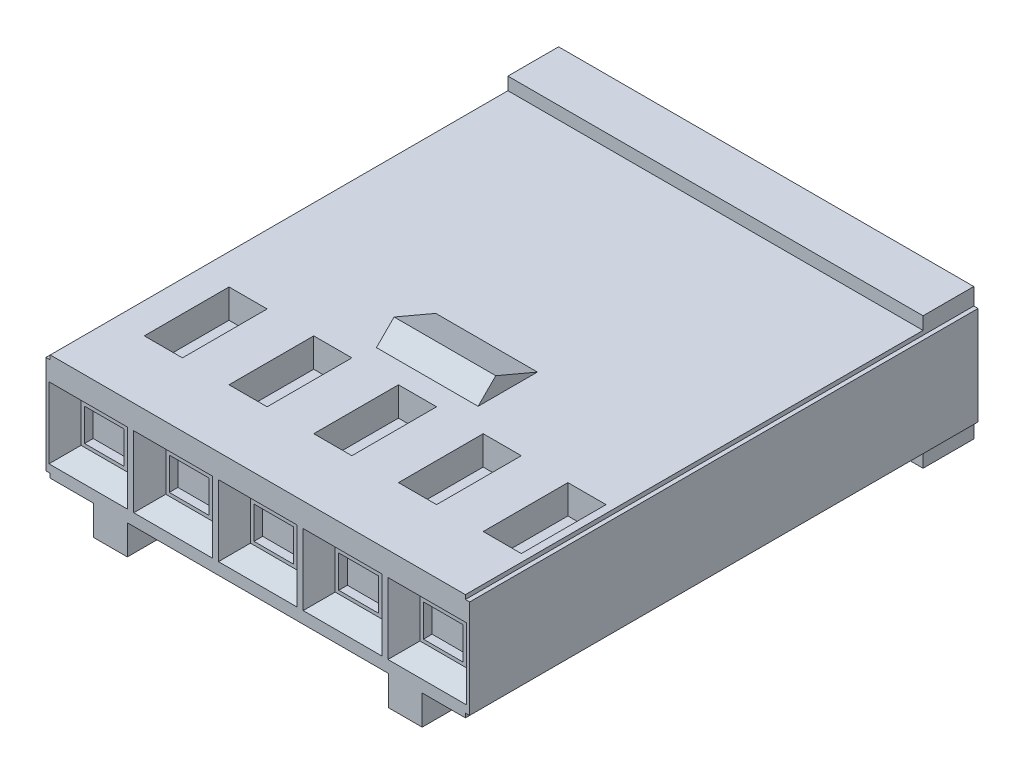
ISO-10303-21;
HEADER;
FILE_DESCRIPTION(('STEP AP214'),'2;1');
FILE_NAME('part.step','',(''),(''),'','','');
FILE_SCHEMA(('AUTOMOTIVE_DESIGN { 1 0 10303 214 1 1 1 1 }'));
ENDSEC;
DATA;
#1=APPLICATION_CONTEXT('core data for automotive mechanical design processes');
#2=APPLICATION_PROTOCOL_DEFINITION('international standard','automotive_design',2000,#1);
#3=PRODUCT_CONTEXT('',#1,'mechanical');
#4=PRODUCT('Part','Part','',(#3));
#5=PRODUCT_RELATED_PRODUCT_CATEGORY('part','',(#4));
#6=PRODUCT_DEFINITION_FORMATION('','',#4);
#7=PRODUCT_DEFINITION_CONTEXT('part definition',#1,'design');
#8=PRODUCT_DEFINITION('design','',#6,#7);
#9=PRODUCT_DEFINITION_SHAPE('','',#8);
#10=(LENGTH_UNIT() NAMED_UNIT(*) SI_UNIT(.MILLI.,.METRE.));
#11=(NAMED_UNIT(*) PLANE_ANGLE_UNIT() SI_UNIT($,.RADIAN.));
#12=(NAMED_UNIT(*) SI_UNIT($,.STERADIAN.) SOLID_ANGLE_UNIT());
#13=UNCERTAINTY_MEASURE_WITH_UNIT(LENGTH_MEASURE(1.E-05),#10,'distance_accuracy_value','');
#14=(GEOMETRIC_REPRESENTATION_CONTEXT(3) GLOBAL_UNCERTAINTY_ASSIGNED_CONTEXT((#13)) GLOBAL_UNIT_ASSIGNED_CONTEXT((#10,
#11,#12)) REPRESENTATION_CONTEXT('',''));
#15=CARTESIAN_POINT('',(0.,0.,0.));
#16=DIRECTION('',(0.,0.,1.));
#17=DIRECTION('',(1.,0.,0.));
#18=AXIS2_PLACEMENT_3D('',#15,#16,#17);
#19=CARTESIAN_POINT('',(-6.223,-1.4732,0.));
#20=DIRECTION('',(0.,1.,0.));
#21=DIRECTION('',(1.,0.,0.));
#22=AXIS2_PLACEMENT_3D('',#19,#20,#21);
#23=PLANE('',#22);
#24=DIRECTION('',(1.,0.,0.));
#25=VECTOR('',#24,1.);
#26=CARTESIAN_POINT('',(-6.35,-1.4732,-15.24));
#27=LINE('',#26,#25);
#28=CARTESIAN_POINT('',(-6.35,-1.4732,-15.24));
#29=VERTEX_POINT('',#28);
#30=CARTESIAN_POINT('',(-6.223,-1.4732,-15.24));
#31=VERTEX_POINT('',#30);
#32=EDGE_CURVE('E1654',#29,#31,#27,.T.);
#33=ORIENTED_EDGE('',*,*,#32,.T.);
#34=DIRECTION('',(0.,0.,-1.));
#35=VECTOR('',#34,1.);
#36=CARTESIAN_POINT('',(-6.223,-1.4732,0.));
#37=LINE('',#36,#35);
#38=CARTESIAN_POINT('',(-6.223,-1.4732,0.));
#39=VERTEX_POINT('',#38);
#40=EDGE_CURVE('E1130',#39,#31,#37,.T.);
#41=ORIENTED_EDGE('',*,*,#40,.F.);
#42=DIRECTION('',(1.,0.,0.));
#43=VECTOR('',#42,1.);
#44=CARTESIAN_POINT('',(-6.35,-1.4732,0.));
#45=LINE('',#44,#43);
#46=CARTESIAN_POINT('',(-6.35,-1.4732,0.));
#47=VERTEX_POINT('',#46);
#48=EDGE_CURVE('E1175',#47,#39,#45,.T.);
#49=ORIENTED_EDGE('',*,*,#48,.F.);
#50=DIRECTION('',(0.,0.,-1.));
#51=VECTOR('',#50,1.);
#52=CARTESIAN_POINT('',(-6.35,-1.4732,0.));
#53=LINE('',#52,#51);
#54=EDGE_CURVE('E2214',#47,#29,#53,.T.);
#55=ORIENTED_EDGE('',*,*,#54,.T.);
#56=EDGE_LOOP('',(#33,#41,#49,#55));
#57=FACE_BOUND('',#56,.T.);
#58=ADVANCED_FACE('F17',(#57),#23,.F.);
#59=CARTESIAN_POINT('',(3.9116,-1.6002,0.));
#60=DIRECTION('',(-1.,0.,0.));
#61=DIRECTION('',(0.,0.,1.));
#62=AXIS2_PLACEMENT_3D('',#59,#60,#61);
#63=PLANE('',#62);
#64=DIRECTION('',(0.,0.,1.));
#65=VECTOR('',#64,1.);
#66=CARTESIAN_POINT('',(3.9116,-1.9802,-15.24));
#67=LINE('',#66,#65);
#68=CARTESIAN_POINT('',(3.9116,-1.9802,-15.24));
#69=VERTEX_POINT('',#68);
#70=CARTESIAN_POINT('',(3.9116,-1.9802,-13.72));
#71=VERTEX_POINT('',#70);
#72=EDGE_CURVE('E1150',#69,#71,#67,.T.);
#73=ORIENTED_EDGE('',*,*,#72,.F.);
#74=DIRECTION('',(0.,-1.,0.));
#75=VECTOR('',#74,1.);
#76=CARTESIAN_POINT('',(3.9116,-1.9802,-15.24));
#77=LINE('',#76,#75);
#78=CARTESIAN_POINT('',(3.9116,-2.4892,-15.24));
#79=VERTEX_POINT('',#78);
#80=EDGE_CURVE('E2154',#69,#79,#77,.T.);
#81=ORIENTED_EDGE('',*,*,#80,.T.);
#82=DIRECTION('',(0.,0.,-1.));
#83=VECTOR('',#82,1.);
#84=CARTESIAN_POINT('',(3.9116,-2.4892,0.));
#85=LINE('',#84,#83);
#86=CARTESIAN_POINT('',(3.9116,-2.4892,0.));
#87=VERTEX_POINT('',#86);
#88=EDGE_CURVE('E10',#87,#79,#85,.T.);
#89=ORIENTED_EDGE('',*,*,#88,.F.);
#90=DIRECTION('',(0.,-1.,0.));
#91=VECTOR('',#90,1.);
#92=CARTESIAN_POINT('',(3.9116,-1.6002,0.));
#93=LINE('',#92,#91);
#94=CARTESIAN_POINT('',(3.9116,-1.6002,0.));
#95=VERTEX_POINT('',#94);
#96=EDGE_CURVE('E1185',#95,#87,#93,.T.);
#97=ORIENTED_EDGE('',*,*,#96,.F.);
#98=DIRECTION('',(0.,0.,-1.));
#99=VECTOR('',#98,1.);
#100=CARTESIAN_POINT('',(3.9116,-1.6002,0.));
#101=LINE('',#100,#99);
#102=CARTESIAN_POINT('',(3.9116,-1.6002,-13.72));
#103=VERTEX_POINT('',#102);
#104=EDGE_CURVE('E1102',#95,#103,#101,.T.);
#105=ORIENTED_EDGE('',*,*,#104,.T.);
#106=DIRECTION('',(0.,-1.,0.));
#107=VECTOR('',#106,1.);
#108=CARTESIAN_POINT('',(3.9116,-1.6002,-13.72));
#109=LINE('',#108,#107);
#110=EDGE_CURVE('E1054',#103,#71,#109,.T.);
#111=ORIENTED_EDGE('',*,*,#110,.T.);
#112=EDGE_LOOP('',(#73,#81,#89,#97,#105,#111));
#113=FACE_BOUND('',#112,.T.);
#114=ADVANCED_FACE('F2205',(#113),#63,.T.);
#115=CARTESIAN_POINT('',(-3.9116,-1.6002,-15.24));
#116=DIRECTION('',(1.,0.,0.));
#117=DIRECTION('',(0.,1.,0.));
#118=AXIS2_PLACEMENT_3D('',#115,#116,#117);
#119=PLANE('',#118);
#120=DIRECTION('',(0.,0.,-1.));
#121=VECTOR('',#120,1.);
#122=CARTESIAN_POINT('',(-3.9116,-1.6002,0.));
#123=LINE('',#122,#121);
#124=CARTESIAN_POINT('',(-3.9116,-1.6002,0.));
#125=VERTEX_POINT('',#124);
#126=CARTESIAN_POINT('',(-3.9116,-1.6002,-13.72));
#127=VERTEX_POINT('',#126);
#128=EDGE_CURVE('E1109',#125,#127,#123,.T.);
#129=ORIENTED_EDGE('',*,*,#128,.F.);
#130=DIRECTION('',(0.,-1.,0.));
#131=VECTOR('',#130,1.);
#132=CARTESIAN_POINT('',(-3.9116,-1.6002,0.));
#133=LINE('',#132,#131);
#134=CARTESIAN_POINT('',(-3.9116,-2.4892,0.));
#135=VERTEX_POINT('',#134);
#136=EDGE_CURVE('E1181',#125,#135,#133,.T.);
#137=ORIENTED_EDGE('',*,*,#136,.T.);
#138=DIRECTION('',(0.,0.,1.));
#139=VECTOR('',#138,1.);
#140=CARTESIAN_POINT('',(-3.9116,-2.4892,-15.24));
#141=LINE('',#140,#139);
#142=CARTESIAN_POINT('',(-3.9116,-2.4892,-15.24));
#143=VERTEX_POINT('',#142);
#144=EDGE_CURVE('E25',#143,#135,#141,.T.);
#145=ORIENTED_EDGE('',*,*,#144,.F.);
#146=DIRECTION('',(0.,-1.,0.));
#147=VECTOR('',#146,1.);
#148=CARTESIAN_POINT('',(-3.9116,-1.9802,-15.24));
#149=LINE('',#148,#147);
#150=CARTESIAN_POINT('',(-3.9116,-1.9802,-15.24));
#151=VERTEX_POINT('',#150);
#152=EDGE_CURVE('E1629',#151,#143,#149,.T.);
#153=ORIENTED_EDGE('',*,*,#152,.F.);
#154=DIRECTION('',(0.,0.,1.));
#155=VECTOR('',#154,1.);
#156=CARTESIAN_POINT('',(-3.9116,-1.9802,-15.24));
#157=LINE('',#156,#155);
#158=CARTESIAN_POINT('',(-3.9116,-1.9802,-13.72));
#159=VERTEX_POINT('',#158);
#160=EDGE_CURVE('E1153',#151,#159,#157,.T.);
#161=ORIENTED_EDGE('',*,*,#160,.T.);
#162=DIRECTION('',(0.,-1.,0.));
#163=VECTOR('',#162,1.);
#164=CARTESIAN_POINT('',(-3.9116,-1.6002,-13.72));
#165=LINE('',#164,#163);
#166=EDGE_CURVE('E1049',#127,#159,#165,.T.);
#167=ORIENTED_EDGE('',*,*,#166,.F.);
#168=EDGE_LOOP('',(#129,#137,#145,#153,#161,#167));
#169=FACE_BOUND('',#168,.T.);
#170=ADVANCED_FACE('F1606',(#169),#119,.T.);
#171=CARTESIAN_POINT('',(-6.35,-2.4892,0.));
#172=DIRECTION('',(0.,-1.,0.));
#173=DIRECTION('',(0.,0.,-1.));
#174=AXIS2_PLACEMENT_3D('',#171,#172,#173);
#175=PLANE('',#174);
#176=ORIENTED_EDGE('',*,*,#88,.T.);
#177=DIRECTION('',(1.,0.,0.));
#178=VECTOR('',#177,1.);
#179=CARTESIAN_POINT('',(3.9116,-2.4892,-15.24));
#180=LINE('',#179,#178);
#181=CARTESIAN_POINT('',(4.9276,-2.4892,-15.24));
#182=VERTEX_POINT('',#181);
#183=EDGE_CURVE('E2150',#79,#182,#180,.T.);
#184=ORIENTED_EDGE('',*,*,#183,.T.);
#185=DIRECTION('',(0.,0.,1.));
#186=VECTOR('',#185,1.);
#187=CARTESIAN_POINT('',(4.9276,-2.4892,-15.24));
#188=LINE('',#187,#186);
#189=CARTESIAN_POINT('',(4.9276,-2.4892,0.));
#190=VERTEX_POINT('',#189);
#191=EDGE_CURVE('E1592',#182,#190,#188,.T.);
#192=ORIENTED_EDGE('',*,*,#191,.T.);
#193=DIRECTION('',(-1.,0.,0.));
#194=VECTOR('',#193,1.);
#195=CARTESIAN_POINT('',(4.9276,-2.4892,0.));
#196=LINE('',#195,#194);
#197=EDGE_CURVE('E1189',#190,#87,#196,.T.);
#198=ORIENTED_EDGE('',*,*,#197,.T.);
#199=EDGE_LOOP('',(#176,#184,#192,#198));
#200=FACE_BOUND('',#199,.T.);
#201=ADVANCED_FACE('F2675',(#200),#175,.T.);
#202=CARTESIAN_POINT('',(-6.35,-2.4892,0.));
#203=DIRECTION('',(0.,-1.,0.));
#204=DIRECTION('',(0.,0.,-1.));
#205=AXIS2_PLACEMENT_3D('',#202,#203,#204);
#206=PLANE('',#205);
#207=DIRECTION('',(1.,0.,0.));
#208=VECTOR('',#207,1.);
#209=CARTESIAN_POINT('',(-4.9276,-2.4892,-15.24));
#210=LINE('',#209,#208);
#211=CARTESIAN_POINT('',(-4.9276,-2.4892,-15.24));
#212=VERTEX_POINT('',#211);
#213=EDGE_CURVE('E1601',#212,#143,#210,.T.);
#214=ORIENTED_EDGE('',*,*,#213,.T.);
#215=ORIENTED_EDGE('',*,*,#144,.T.);
#216=DIRECTION('',(-1.,0.,0.));
#217=VECTOR('',#216,1.);
#218=CARTESIAN_POINT('',(-3.9116,-2.4892,0.));
#219=LINE('',#218,#217);
#220=CARTESIAN_POINT('',(-4.9276,-2.4892,0.));
#221=VERTEX_POINT('',#220);
#222=EDGE_CURVE('E1178',#135,#221,#219,.T.);
#223=ORIENTED_EDGE('',*,*,#222,.T.);
#224=DIRECTION('',(0.,0.,-1.));
#225=VECTOR('',#224,1.);
#226=CARTESIAN_POINT('',(-4.9276,-2.4892,0.));
#227=LINE('',#226,#225);
#228=EDGE_CURVE('E1168',#221,#212,#227,.T.);
#229=ORIENTED_EDGE('',*,*,#228,.T.);
#230=EDGE_LOOP('',(#214,#215,#223,#229));
#231=FACE_BOUND('',#230,.T.);
#232=ADVANCED_FACE('F1598',(#231),#206,.T.);
#233=CARTESIAN_POINT('',(4.9276,-1.6002,-15.24));
#234=DIRECTION('',(1.,0.,0.));
#235=DIRECTION('',(0.,1.,0.));
#236=AXIS2_PLACEMENT_3D('',#233,#234,#235);
#237=PLANE('',#236);
#238=DIRECTION('',(0.,0.,-1.));
#239=VECTOR('',#238,1.);
#240=CARTESIAN_POINT('',(4.9276,-1.6002,0.));
#241=LINE('',#240,#239);
#242=CARTESIAN_POINT('',(4.9276,-1.6002,0.));
#243=VERTEX_POINT('',#242);
#244=CARTESIAN_POINT('',(4.9276,-1.6002,-13.72));
#245=VERTEX_POINT('',#244);
#246=EDGE_CURVE('E1123',#243,#245,#241,.T.);
#247=ORIENTED_EDGE('',*,*,#246,.F.);
#248=DIRECTION('',(0.,-1.,0.));
#249=VECTOR('',#248,1.);
#250=CARTESIAN_POINT('',(4.9276,-1.6002,0.));
#251=LINE('',#250,#249);
#252=EDGE_CURVE('E1193',#243,#190,#251,.T.);
#253=ORIENTED_EDGE('',*,*,#252,.T.);
#254=ORIENTED_EDGE('',*,*,#191,.F.);
#255=DIRECTION('',(0.,-1.,0.));
#256=VECTOR('',#255,1.);
#257=CARTESIAN_POINT('',(4.9276,-1.9802,-15.24));
#258=LINE('',#257,#256);
#259=CARTESIAN_POINT('',(4.9276,-1.9802,-15.24));
#260=VERTEX_POINT('',#259);
#261=EDGE_CURVE('E2155',#260,#182,#258,.T.);
#262=ORIENTED_EDGE('',*,*,#261,.F.);
#263=DIRECTION('',(0.,0.,1.));
#264=VECTOR('',#263,1.);
#265=CARTESIAN_POINT('',(4.9276,-1.9802,-15.24));
#266=LINE('',#265,#264);
#267=CARTESIAN_POINT('',(4.9276,-1.9802,-13.72));
#268=VERTEX_POINT('',#267);
#269=EDGE_CURVE('E1159',#260,#268,#266,.T.);
#270=ORIENTED_EDGE('',*,*,#269,.T.);
#271=DIRECTION('',(0.,-1.,0.));
#272=VECTOR('',#271,1.);
#273=CARTESIAN_POINT('',(4.9276,-1.6002,-13.72));
#274=LINE('',#273,#272);
#275=EDGE_CURVE('E1066',#245,#268,#274,.T.);
#276=ORIENTED_EDGE('',*,*,#275,.F.);
#277=EDGE_LOOP('',(#247,#253,#254,#262,#270,#276));
#278=FACE_BOUND('',#277,.T.);
#279=ADVANCED_FACE('F2378',(#278),#237,.T.);
#280=CARTESIAN_POINT('',(6.223,-1.4732,0.));
#281=DIRECTION('',(-1.,0.,0.));
#282=DIRECTION('',(0.,0.,1.));
#283=AXIS2_PLACEMENT_3D('',#280,#281,#282);
#284=PLANE('',#283);
#285=DIRECTION('',(0.,0.,-1.));
#286=VECTOR('',#285,1.);
#287=CARTESIAN_POINT('',(6.223,-1.4732,0.));
#288=LINE('',#287,#286);
#289=CARTESIAN_POINT('',(6.223,-1.4732,0.));
#290=VERTEX_POINT('',#289);
#291=CARTESIAN_POINT('',(6.223,-1.4732,-15.24));
#292=VERTEX_POINT('',#291);
#293=EDGE_CURVE('E1589',#290,#292,#288,.T.);
#294=ORIENTED_EDGE('',*,*,#293,.F.);
#295=DIRECTION('',(0.,-1.,0.));
#296=VECTOR('',#295,1.);
#297=CARTESIAN_POINT('',(6.223,-1.4732,0.));
#298=LINE('',#297,#296);
#299=CARTESIAN_POINT('',(6.223,-1.6002,0.));
#300=VERTEX_POINT('',#299);
#301=EDGE_CURVE('E1202',#290,#300,#298,.T.);
#302=ORIENTED_EDGE('',*,*,#301,.T.);
#303=DIRECTION('',(0.,0.,-1.));
#304=VECTOR('',#303,1.);
#305=CARTESIAN_POINT('',(6.223,-1.6002,0.));
#306=LINE('',#305,#304);
#307=CARTESIAN_POINT('',(6.223,-1.6002,-13.72));
#308=VERTEX_POINT('',#307);
#309=EDGE_CURVE('E1116',#300,#308,#306,.T.);
#310=ORIENTED_EDGE('',*,*,#309,.T.);
#311=DIRECTION('',(0.,-1.,0.));
#312=VECTOR('',#311,1.);
#313=CARTESIAN_POINT('',(6.223,-1.6002,-13.72));
#314=LINE('',#313,#312);
#315=CARTESIAN_POINT('',(6.223,-1.9802,-13.72));
#316=VERTEX_POINT('',#315);
#317=EDGE_CURVE('E969',#308,#316,#314,.T.);
#318=ORIENTED_EDGE('',*,*,#317,.T.);
#319=DIRECTION('',(0.,0.,1.));
#320=VECTOR('',#319,1.);
#321=CARTESIAN_POINT('',(6.223,-1.9802,-15.24));
#322=LINE('',#321,#320);
#323=CARTESIAN_POINT('',(6.223,-1.9802,-15.24));
#324=VERTEX_POINT('',#323);
#325=EDGE_CURVE('E1156',#324,#316,#322,.T.);
#326=ORIENTED_EDGE('',*,*,#325,.F.);
#327=DIRECTION('',(0.,-1.,0.));
#328=VECTOR('',#327,1.);
#329=CARTESIAN_POINT('',(6.223,-1.4732,-15.24));
#330=LINE('',#329,#328);
#331=EDGE_CURVE('E2142',#292,#324,#330,.T.);
#332=ORIENTED_EDGE('',*,*,#331,.F.);
#333=EDGE_LOOP('',(#294,#302,#310,#318,#326,#332));
#334=FACE_BOUND('',#333,.T.);
#335=ADVANCED_FACE('F2381',(#334),#284,.F.);
#336=CARTESIAN_POINT('',(6.35,-1.4732,0.));
#337=DIRECTION('',(0.,1.,0.));
#338=DIRECTION('',(1.,0.,0.));
#339=AXIS2_PLACEMENT_3D('',#336,#337,#338);
#340=PLANE('',#339);
#341=DIRECTION('',(-1.,0.,0.));
#342=VECTOR('',#341,1.);
#343=CARTESIAN_POINT('',(6.35,-1.4732,0.));
#344=LINE('',#343,#342);
#345=CARTESIAN_POINT('',(6.35,-1.4732,0.));
#346=VERTEX_POINT('',#345);
#347=EDGE_CURVE('E1203',#346,#290,#344,.T.);
#348=ORIENTED_EDGE('',*,*,#347,.T.);
#349=ORIENTED_EDGE('',*,*,#293,.T.);
#350=DIRECTION('',(-1.,0.,0.));
#351=VECTOR('',#350,1.);
#352=CARTESIAN_POINT('',(6.35,-1.4732,-15.24));
#353=LINE('',#352,#351);
#354=CARTESIAN_POINT('',(6.35,-1.4732,-15.24));
#355=VERTEX_POINT('',#354);
#356=EDGE_CURVE('E2146',#355,#292,#353,.T.);
#357=ORIENTED_EDGE('',*,*,#356,.F.);
#358=DIRECTION('',(0.,0.,-1.));
#359=VECTOR('',#358,1.);
#360=CARTESIAN_POINT('',(6.35,-1.4732,0.));
#361=LINE('',#360,#359);
#362=EDGE_CURVE('E1586',#346,#355,#361,.T.);
#363=ORIENTED_EDGE('',*,*,#362,.F.);
#364=EDGE_LOOP('',(#348,#349,#357,#363));
#365=FACE_BOUND('',#364,.T.);
#366=ADVANCED_FACE('F2470',(#365),#340,.F.);
#367=CARTESIAN_POINT('',(6.35,0.,0.));
#368=DIRECTION('',(1.,0.,0.));
#369=DIRECTION('',(0.,1.,0.));
#370=AXIS2_PLACEMENT_3D('',#367,#368,#369);
#371=PLANE('',#370);
#372=DIRECTION('',(0.,-1.,0.));
#373=VECTOR('',#372,1.);
#374=CARTESIAN_POINT('',(6.35,1.4732,0.));
#375=LINE('',#374,#373);
#376=CARTESIAN_POINT('',(6.35,1.4732,0.));
#377=VERTEX_POINT('',#376);
#378=EDGE_CURVE('E1207',#377,#346,#375,.T.);
#379=ORIENTED_EDGE('',*,*,#378,.T.);
#380=ORIENTED_EDGE('',*,*,#362,.T.);
#381=DIRECTION('',(0.,1.,0.));
#382=VECTOR('',#381,1.);
#383=CARTESIAN_POINT('',(6.35,-1.4732,-15.24));
#384=LINE('',#383,#382);
#385=CARTESIAN_POINT('',(6.35,1.4732,-15.24));
#386=VERTEX_POINT('',#385);
#387=EDGE_CURVE('E2261',#355,#386,#384,.T.);
#388=ORIENTED_EDGE('',*,*,#387,.T.);
#389=DIRECTION('',(0.,0.,-1.));
#390=VECTOR('',#389,1.);
#391=CARTESIAN_POINT('',(6.35,1.4732,0.));
#392=LINE('',#391,#390);
#393=EDGE_CURVE('E974',#377,#386,#392,.T.);
#394=ORIENTED_EDGE('',*,*,#393,.F.);
#395=EDGE_LOOP('',(#379,#380,#388,#394));
#396=FACE_BOUND('',#395,.T.);
#397=ADVANCED_FACE('F2648',(#396),#371,.T.);
#398=CARTESIAN_POINT('',(6.223,1.4732,0.));
#399=DIRECTION('',(0.,-1.,0.));
#400=DIRECTION('',(0.,0.,-1.));
#401=AXIS2_PLACEMENT_3D('',#398,#399,#400);
#402=PLANE('',#401);
#403=DIRECTION('',(-1.,0.,0.));
#404=VECTOR('',#403,1.);
#405=CARTESIAN_POINT('',(6.35,1.4732,-15.24));
#406=LINE('',#405,#404);
#407=CARTESIAN_POINT('',(6.223,1.4732,-15.24));
#408=VERTEX_POINT('',#407);
#409=EDGE_CURVE('E2140',#386,#408,#406,.T.);
#410=ORIENTED_EDGE('',*,*,#409,.T.);
#411=DIRECTION('',(0.,0.,-1.));
#412=VECTOR('',#411,1.);
#413=CARTESIAN_POINT('',(6.223,1.4732,0.));
#414=LINE('',#413,#412);
#415=CARTESIAN_POINT('',(6.223,1.4732,0.));
#416=VERTEX_POINT('',#415);
#417=EDGE_CURVE('E1685',#416,#408,#414,.T.);
#418=ORIENTED_EDGE('',*,*,#417,.F.);
#419=DIRECTION('',(-1.,0.,0.));
#420=VECTOR('',#419,1.);
#421=CARTESIAN_POINT('',(6.35,1.4732,0.));
#422=LINE('',#421,#420);
#423=EDGE_CURVE('E1211',#377,#416,#422,.T.);
#424=ORIENTED_EDGE('',*,*,#423,.F.);
#425=ORIENTED_EDGE('',*,*,#393,.T.);
#426=EDGE_LOOP('',(#410,#418,#424,#425));
#427=FACE_BOUND('',#426,.T.);
#428=ADVANCED_FACE('F2288',(#427),#402,.F.);
#429=CARTESIAN_POINT('',(-6.223,1.9802,-15.24));
#430=DIRECTION('',(0.,1.,0.));
#431=DIRECTION('',(1.,0.,0.));
#432=AXIS2_PLACEMENT_3D('',#429,#430,#431);
#433=PLANE('',#432);
#434=DIRECTION('',(0.,0.,1.));
#435=VECTOR('',#434,1.);
#436=CARTESIAN_POINT('',(-6.223,1.9802,-15.24));
#437=LINE('',#436,#435);
#438=CARTESIAN_POINT('',(-6.223,1.9802,-15.24));
#439=VERTEX_POINT('',#438);
#440=CARTESIAN_POINT('',(-6.223,1.9802,-13.72));
#441=VERTEX_POINT('',#440);
#442=EDGE_CURVE('E971',#439,#441,#437,.T.);
#443=ORIENTED_EDGE('',*,*,#442,.T.);
#444=DIRECTION('',(1.,0.,0.));
#445=VECTOR('',#444,1.);
#446=CARTESIAN_POINT('',(-6.223,1.9802,-13.72));
#447=LINE('',#446,#445);
#448=CARTESIAN_POINT('',(6.223,1.9802,-13.72));
#449=VERTEX_POINT('',#448);
#450=EDGE_CURVE('E968',#441,#449,#447,.T.);
#451=ORIENTED_EDGE('',*,*,#450,.T.);
#452=DIRECTION('',(0.,0.,1.));
#453=VECTOR('',#452,1.);
#454=CARTESIAN_POINT('',(6.223,1.9802,-15.24));
#455=LINE('',#454,#453);
#456=CARTESIAN_POINT('',(6.223,1.9802,-15.24));
#457=VERTEX_POINT('',#456);
#458=EDGE_CURVE('E1688',#457,#449,#455,.T.);
#459=ORIENTED_EDGE('',*,*,#458,.F.);
#460=DIRECTION('',(1.,0.,0.));
#461=VECTOR('',#460,1.);
#462=CARTESIAN_POINT('',(-6.223,1.9802,-15.24));
#463=LINE('',#462,#461);
#464=EDGE_CURVE('E1668',#439,#457,#463,.T.);
#465=ORIENTED_EDGE('',*,*,#464,.F.);
#466=EDGE_LOOP('',(#443,#451,#459,#465));
#467=FACE_BOUND('',#466,.T.);
#468=ADVANCED_FACE('F2294',(#467),#433,.T.);
#469=CARTESIAN_POINT('',(-6.223,1.4732,0.));
#470=DIRECTION('',(1.,0.,0.));
#471=DIRECTION('',(0.,1.,0.));
#472=AXIS2_PLACEMENT_3D('',#469,#470,#471);
#473=PLANE('',#472);
#474=DIRECTION('',(0.,0.,-1.));
#475=VECTOR('',#474,1.);
#476=CARTESIAN_POINT('',(-6.223,1.4732,0.));
#477=LINE('',#476,#475);
#478=CARTESIAN_POINT('',(-6.223,1.4732,0.));
#479=VERTEX_POINT('',#478);
#480=CARTESIAN_POINT('',(-6.223,1.4732,-15.24));
#481=VERTEX_POINT('',#480);
#482=EDGE_CURVE('E2125',#479,#481,#477,.T.);
#483=ORIENTED_EDGE('',*,*,#482,.F.);
#484=DIRECTION('',(0.,-1.,0.));
#485=VECTOR('',#484,1.);
#486=CARTESIAN_POINT('',(-6.223,1.6002,0.));
#487=LINE('',#486,#485);
#488=CARTESIAN_POINT('',(-6.223,1.6002,0.));
#489=VERTEX_POINT('',#488);
#490=EDGE_CURVE('E1214',#489,#479,#487,.T.);
#491=ORIENTED_EDGE('',*,*,#490,.F.);
#492=DIRECTION('',(0.,0.,1.));
#493=VECTOR('',#492,1.);
#494=CARTESIAN_POINT('',(-6.223,1.6002,-13.72));
#495=LINE('',#494,#493);
#496=CARTESIAN_POINT('',(-6.223,1.6002,-13.72));
#497=VERTEX_POINT('',#496);
#498=EDGE_CURVE('E1704',#497,#489,#495,.T.);
#499=ORIENTED_EDGE('',*,*,#498,.F.);
#500=DIRECTION('',(0.,1.,0.));
#501=VECTOR('',#500,1.);
#502=CARTESIAN_POINT('',(-6.223,1.6002,-13.72));
#503=LINE('',#502,#501);
#504=EDGE_CURVE('E1088',#497,#441,#503,.T.);
#505=ORIENTED_EDGE('',*,*,#504,.T.);
#506=ORIENTED_EDGE('',*,*,#442,.F.);
#507=DIRECTION('',(0.,1.,0.));
#508=VECTOR('',#507,1.);
#509=CARTESIAN_POINT('',(-6.223,1.4732,-15.24));
#510=LINE('',#509,#508);
#511=EDGE_CURVE('E1664',#481,#439,#510,.T.);
#512=ORIENTED_EDGE('',*,*,#511,.F.);
#513=EDGE_LOOP('',(#483,#491,#499,#505,#506,#512));
#514=FACE_BOUND('',#513,.T.);
#515=ADVANCED_FACE('F2122',(#514),#473,.F.);
#516=CARTESIAN_POINT('',(6.02,-0.18,-0.24));
#517=DIRECTION('',(-0.707106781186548,0.,0.707106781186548));
#518=DIRECTION('',(0.,1.,0.));
#519=AXIS2_PLACEMENT_3D('',#516,#517,#518);
#520=PLANE('',#519);
#521=DIRECTION('',(-0.577350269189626,0.577350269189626,-0.577350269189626));
#522=VECTOR('',#521,1.);
#523=CARTESIAN_POINT('',(6.26,-1.245,0.));
#524=LINE('',#523,#522);
#525=CARTESIAN_POINT('',(6.26,-1.245,0.));
#526=VERTEX_POINT('',#525);
#527=CARTESIAN_POINT('',(5.78,-0.765,-0.48));
#528=VERTEX_POINT('',#527);
#529=EDGE_CURVE('E1418',#526,#528,#524,.T.);
#530=ORIENTED_EDGE('',*,*,#529,.F.);
#531=DIRECTION('',(0.,-1.,0.));
#532=VECTOR('',#531,1.);
#533=CARTESIAN_POINT('',(6.26,0.885,0.));
#534=LINE('',#533,#532);
#535=CARTESIAN_POINT('',(6.26,0.885,0.));
#536=VERTEX_POINT('',#535);
#537=EDGE_CURVE('E1142',#536,#526,#534,.T.);
#538=ORIENTED_EDGE('',*,*,#537,.F.);
#539=DIRECTION('',(-0.577350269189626,-0.577350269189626,-0.577350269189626));
#540=VECTOR('',#539,1.);
#541=CARTESIAN_POINT('',(6.26,0.885,0.));
#542=LINE('',#541,#540);
#543=CARTESIAN_POINT('',(5.78,0.405,-0.48));
#544=VERTEX_POINT('',#543);
#545=EDGE_CURVE('E1536',#536,#544,#542,.T.);
#546=ORIENTED_EDGE('',*,*,#545,.T.);
#547=DIRECTION('',(0.,-1.,0.));
#548=VECTOR('',#547,1.);
#549=CARTESIAN_POINT('',(5.78,0.405,-0.48));
#550=LINE('',#549,#548);
#551=EDGE_CURVE('E1545',#544,#528,#550,.T.);
#552=ORIENTED_EDGE('',*,*,#551,.T.);
#553=EDGE_LOOP('',(#530,#538,#546,#552));
#554=FACE_BOUND('',#553,.T.);
#555=ADVANCED_FACE('F2665',(#554),#520,.T.);
#556=CARTESIAN_POINT('',(3.81,0.,-0.74));
#557=DIRECTION('',(0.,0.,1.));
#558=DIRECTION('',(1.,0.,0.));
#559=AXIS2_PLACEMENT_3D('',#556,#557,#558);
#560=PLANE('',#559);
#561=DIRECTION('',(1.,0.,0.));
#562=VECTOR('',#561,1.);
#563=CARTESIAN_POINT('',(4.485,-0.665,-0.74));
#564=LINE('',#563,#562);
#565=CARTESIAN_POINT('',(4.485,-0.665,-0.74));
#566=VERTEX_POINT('',#565);
#567=CARTESIAN_POINT('',(5.675,-0.665,-0.74));
#568=VERTEX_POINT('',#567);
#569=EDGE_CURVE('E37',#566,#568,#564,.T.);
#570=ORIENTED_EDGE('',*,*,#569,.T.);
#571=DIRECTION('',(0.,1.,0.));
#572=VECTOR('',#571,1.);
#573=CARTESIAN_POINT('',(5.675,-0.665,-0.74));
#574=LINE('',#573,#572);
#575=CARTESIAN_POINT('',(5.675,0.305,-0.74));
#576=VERTEX_POINT('',#575);
#577=EDGE_CURVE('E44',#568,#576,#574,.T.);
#578=ORIENTED_EDGE('',*,*,#577,.T.);
#579=DIRECTION('',(-1.,0.,0.));
#580=VECTOR('',#579,1.);
#581=CARTESIAN_POINT('',(5.675,0.305,-0.74));
#582=LINE('',#581,#580);
#583=CARTESIAN_POINT('',(4.485,0.305,-0.74));
#584=VERTEX_POINT('',#583);
#585=EDGE_CURVE('E1575',#576,#584,#582,.T.);
#586=ORIENTED_EDGE('',*,*,#585,.T.);
#587=DIRECTION('',(0.,-1.,0.));
#588=VECTOR('',#587,1.);
#589=CARTESIAN_POINT('',(4.485,0.305,-0.74));
#590=LINE('',#589,#588);
#591=EDGE_CURVE('E1568',#584,#566,#590,.T.);
#592=ORIENTED_EDGE('',*,*,#591,.T.);
#593=EDGE_LOOP('',(#570,#578,#586,#592));
#594=FACE_BOUND('',#593,.T.);
#595=ADVANCED_FACE('F2509',(#594),#560,.T.);
#596=CARTESIAN_POINT('',(4.485,-0.665,0.));
#597=DIRECTION('',(0.,-1.,0.));
#598=DIRECTION('',(0.,0.,-1.));
#599=AXIS2_PLACEMENT_3D('',#596,#597,#598);
#600=PLANE('',#599);
#601=DIRECTION('',(0.,0.,-1.));
#602=VECTOR('',#601,1.);
#603=CARTESIAN_POINT('',(5.675,-0.665,-0.48));
#604=LINE('',#603,#602);
#605=CARTESIAN_POINT('',(5.675,-0.665,-0.48));
#606=VERTEX_POINT('',#605);
#607=EDGE_CURVE('E1061',#606,#568,#604,.T.);
#608=ORIENTED_EDGE('',*,*,#607,.T.);
#609=ORIENTED_EDGE('',*,*,#569,.F.);
#610=DIRECTION('',(0.,0.,-1.));
#611=VECTOR('',#610,1.);
#612=CARTESIAN_POINT('',(4.485,-0.665,-0.48));
#613=LINE('',#612,#611);
#614=CARTESIAN_POINT('',(4.485,-0.665,-0.48));
#615=VERTEX_POINT('',#614);
#616=EDGE_CURVE('E1564',#615,#566,#613,.T.);
#617=ORIENTED_EDGE('',*,*,#616,.F.);
#618=DIRECTION('',(1.,0.,0.));
#619=VECTOR('',#618,1.);
#620=CARTESIAN_POINT('',(4.485,-0.665,-0.48));
#621=LINE('',#620,#619);
#622=EDGE_CURVE('E1556',#615,#606,#621,.T.);
#623=ORIENTED_EDGE('',*,*,#622,.T.);
#624=EDGE_LOOP('',(#608,#609,#617,#623));
#625=FACE_BOUND('',#624,.T.);
#626=ADVANCED_FACE('F2456',(#625),#600,.F.);
#627=CARTESIAN_POINT('',(5.675,-0.665,0.));
#628=DIRECTION('',(1.,0.,0.));
#629=DIRECTION('',(0.,1.,0.));
#630=AXIS2_PLACEMENT_3D('',#627,#628,#629);
#631=PLANE('',#630);
#632=DIRECTION('',(0.,0.,-1.));
#633=VECTOR('',#632,1.);
#634=CARTESIAN_POINT('',(5.675,0.305,-0.48));
#635=LINE('',#634,#633);
#636=CARTESIAN_POINT('',(5.675,0.305,-0.48));
#637=VERTEX_POINT('',#636);
#638=EDGE_CURVE('E1062',#637,#576,#635,.T.);
#639=ORIENTED_EDGE('',*,*,#638,.T.);
#640=ORIENTED_EDGE('',*,*,#577,.F.);
#641=ORIENTED_EDGE('',*,*,#607,.F.);
#642=DIRECTION('',(0.,1.,0.));
#643=VECTOR('',#642,1.);
#644=CARTESIAN_POINT('',(5.675,-0.665,-0.48));
#645=LINE('',#644,#643);
#646=EDGE_CURVE('E1552',#606,#637,#645,.T.);
#647=ORIENTED_EDGE('',*,*,#646,.T.);
#648=EDGE_LOOP('',(#639,#640,#641,#647));
#649=FACE_BOUND('',#648,.T.);
#650=ADVANCED_FACE('F2452',(#649),#631,.F.);
#651=CARTESIAN_POINT('',(5.675,0.305,0.));
#652=DIRECTION('',(0.,1.,0.));
#653=DIRECTION('',(1.,0.,0.));
#654=AXIS2_PLACEMENT_3D('',#651,#652,#653);
#655=PLANE('',#654);
#656=DIRECTION('',(0.,0.,-1.));
#657=VECTOR('',#656,1.);
#658=CARTESIAN_POINT('',(4.485,0.305,-0.48));
#659=LINE('',#658,#657);
#660=CARTESIAN_POINT('',(4.485,0.305,-0.48));
#661=VERTEX_POINT('',#660);
#662=EDGE_CURVE('E1571',#661,#584,#659,.T.);
#663=ORIENTED_EDGE('',*,*,#662,.T.);
#664=ORIENTED_EDGE('',*,*,#585,.F.);
#665=ORIENTED_EDGE('',*,*,#638,.F.);
#666=DIRECTION('',(-1.,0.,0.));
#667=VECTOR('',#666,1.);
#668=CARTESIAN_POINT('',(5.675,0.305,-0.48));
#669=LINE('',#668,#667);
#670=EDGE_CURVE('E1548',#637,#661,#669,.T.);
#671=ORIENTED_EDGE('',*,*,#670,.T.);
#672=EDGE_LOOP('',(#663,#664,#665,#671));
#673=FACE_BOUND('',#672,.T.);
#674=ADVANCED_FACE('F2455',(#673),#655,.F.);
#675=CARTESIAN_POINT('',(4.485,0.305,0.));
#676=DIRECTION('',(-1.,0.,0.));
#677=DIRECTION('',(0.,0.,1.));
#678=AXIS2_PLACEMENT_3D('',#675,#676,#677);
#679=PLANE('',#678);
#680=ORIENTED_EDGE('',*,*,#616,.T.);
#681=ORIENTED_EDGE('',*,*,#591,.F.);
#682=ORIENTED_EDGE('',*,*,#662,.F.);
#683=DIRECTION('',(0.,-1.,0.));
#684=VECTOR('',#683,1.);
#685=CARTESIAN_POINT('',(4.485,0.305,-0.48));
#686=LINE('',#685,#684);
#687=EDGE_CURVE('E1560',#661,#615,#686,.T.);
#688=ORIENTED_EDGE('',*,*,#687,.T.);
#689=EDGE_LOOP('',(#680,#681,#682,#688));
#690=FACE_BOUND('',#689,.T.);
#691=ADVANCED_FACE('F2605',(#690),#679,.F.);
#692=CARTESIAN_POINT('',(3.81,0.,-0.48));
#693=DIRECTION('',(0.,0.,1.));
#694=DIRECTION('',(1.,0.,0.));
#695=AXIS2_PLACEMENT_3D('',#692,#693,#694);
#696=PLANE('',#695);
#697=ORIENTED_EDGE('',*,*,#670,.F.);
#698=ORIENTED_EDGE('',*,*,#646,.F.);
#699=ORIENTED_EDGE('',*,*,#622,.F.);
#700=ORIENTED_EDGE('',*,*,#687,.F.);
#701=EDGE_LOOP('',(#697,#698,#699,#700));
#702=FACE_BOUND('',#701,.T.);
#703=ORIENTED_EDGE('',*,*,#551,.F.);
#704=DIRECTION('',(1.,0.,0.));
#705=VECTOR('',#704,1.);
#706=CARTESIAN_POINT('',(4.38,0.405,-0.48));
#707=LINE('',#706,#705);
#708=CARTESIAN_POINT('',(4.38,0.405,-0.48));
#709=VERTEX_POINT('',#708);
#710=EDGE_CURVE('E1540',#709,#544,#707,.T.);
#711=ORIENTED_EDGE('',*,*,#710,.F.);
#712=DIRECTION('',(0.,1.,0.));
#713=VECTOR('',#712,1.);
#714=CARTESIAN_POINT('',(4.38,-0.765,-0.48));
#715=LINE('',#714,#713);
#716=CARTESIAN_POINT('',(4.38,-0.765,-0.48));
#717=VERTEX_POINT('',#716);
#718=EDGE_CURVE('E1071',#717,#709,#715,.T.);
#719=ORIENTED_EDGE('',*,*,#718,.F.);
#720=DIRECTION('',(-1.,0.,0.));
#721=VECTOR('',#720,1.);
#722=CARTESIAN_POINT('',(5.78,-0.765,-0.48));
#723=LINE('',#722,#721);
#724=EDGE_CURVE('E1072',#528,#717,#723,.T.);
#725=ORIENTED_EDGE('',*,*,#724,.F.);
#726=EDGE_LOOP('',(#703,#711,#719,#725));
#727=FACE_BOUND('',#726,.T.);
#728=ADVANCED_FACE('F2370',(#702,#727),#696,.T.);
#729=CARTESIAN_POINT('',(5.08,0.645,-0.24));
#730=DIRECTION('',(0.,-0.707106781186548,0.707106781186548));
#731=DIRECTION('',(-1.,0.,0.));
#732=AXIS2_PLACEMENT_3D('',#729,#730,#731);
#733=PLANE('',#732);
#734=ORIENTED_EDGE('',*,*,#545,.F.);
#735=DIRECTION('',(1.,0.,0.));
#736=VECTOR('',#735,1.);
#737=CARTESIAN_POINT('',(3.9,0.885,0.));
#738=LINE('',#737,#736);
#739=CARTESIAN_POINT('',(3.9,0.885,0.));
#740=VERTEX_POINT('',#739);
#741=EDGE_CURVE('E1147',#740,#536,#738,.T.);
#742=ORIENTED_EDGE('',*,*,#741,.F.);
#743=DIRECTION('',(0.577350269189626,-0.577350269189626,-0.577350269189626));
#744=VECTOR('',#743,1.);
#745=CARTESIAN_POINT('',(3.9,0.885,0.));
#746=LINE('',#745,#744);
#747=EDGE_CURVE('E1541',#740,#709,#746,.T.);
#748=ORIENTED_EDGE('',*,*,#747,.T.);
#749=ORIENTED_EDGE('',*,*,#710,.T.);
#750=EDGE_LOOP('',(#734,#742,#748,#749));
#751=FACE_BOUND('',#750,.T.);
#752=ADVANCED_FACE('F2367',(#751),#733,.T.);
#753=CARTESIAN_POINT('',(4.14,-0.18,-0.24));
#754=DIRECTION('',(0.707106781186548,0.,0.707106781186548));
#755=DIRECTION('',(0.,-1.,0.));
#756=AXIS2_PLACEMENT_3D('',#753,#754,#755);
#757=PLANE('',#756);
#758=DIRECTION('',(0.577350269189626,0.577350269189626,-0.577350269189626));
#759=VECTOR('',#758,1.);
#760=CARTESIAN_POINT('',(3.9,-1.245,0.));
#761=LINE('',#760,#759);
#762=CARTESIAN_POINT('',(3.9,-1.245,0.));
#763=VERTEX_POINT('',#762);
#764=EDGE_CURVE('E1067',#763,#717,#761,.T.);
#765=ORIENTED_EDGE('',*,*,#764,.T.);
#766=ORIENTED_EDGE('',*,*,#718,.T.);
#767=ORIENTED_EDGE('',*,*,#747,.F.);
#768=DIRECTION('',(0.,1.,0.));
#769=VECTOR('',#768,1.);
#770=CARTESIAN_POINT('',(3.9,-1.245,0.));
#771=LINE('',#770,#769);
#772=EDGE_CURVE('E1266',#763,#740,#771,.T.);
#773=ORIENTED_EDGE('',*,*,#772,.F.);
#774=EDGE_LOOP('',(#765,#766,#767,#773));
#775=FACE_BOUND('',#774,.T.);
#776=ADVANCED_FACE('F2346',(#775),#757,.T.);
#777=CARTESIAN_POINT('',(5.08,-1.005,-0.24));
#778=DIRECTION('',(0.,0.707106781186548,0.707106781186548));
#779=DIRECTION('',(1.,0.,0.));
#780=AXIS2_PLACEMENT_3D('',#777,#778,#779);
#781=PLANE('',#780);
#782=ORIENTED_EDGE('',*,*,#529,.T.);
#783=ORIENTED_EDGE('',*,*,#724,.T.);
#784=ORIENTED_EDGE('',*,*,#764,.F.);
#785=DIRECTION('',(-1.,0.,0.));
#786=VECTOR('',#785,1.);
#787=CARTESIAN_POINT('',(6.26,-1.245,0.));
#788=LINE('',#787,#786);
#789=EDGE_CURVE('E1146',#526,#763,#788,.T.);
#790=ORIENTED_EDGE('',*,*,#789,.F.);
#791=EDGE_LOOP('',(#782,#783,#784,#790));
#792=FACE_BOUND('',#791,.T.);
#793=ADVANCED_FACE('F2343',(#792),#781,.T.);
#794=CARTESIAN_POINT('',(3.48,-0.18,-0.24));
#795=DIRECTION('',(-0.707106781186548,0.,0.707106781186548));
#796=DIRECTION('',(0.,1.,0.));
#797=AXIS2_PLACEMENT_3D('',#794,#795,#796);
#798=PLANE('',#797);
#799=DIRECTION('',(-0.577350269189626,0.577350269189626,-0.577350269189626));
#800=VECTOR('',#799,1.);
#801=CARTESIAN_POINT('',(3.72,-1.245,0.));
#802=LINE('',#801,#800);
#803=CARTESIAN_POINT('',(3.72,-1.245,0.));
#804=VERTEX_POINT('',#803);
#805=CARTESIAN_POINT('',(3.24,-0.765,-0.48));
#806=VERTEX_POINT('',#805);
#807=EDGE_CURVE('E1462',#804,#806,#802,.T.);
#808=ORIENTED_EDGE('',*,*,#807,.F.);
#809=DIRECTION('',(0.,-1.,0.));
#810=VECTOR('',#809,1.);
#811=CARTESIAN_POINT('',(3.72,0.885,0.));
#812=LINE('',#811,#810);
#813=CARTESIAN_POINT('',(3.72,0.885,0.));
#814=VERTEX_POINT('',#813);
#815=EDGE_CURVE('E1219',#814,#804,#812,.T.);
#816=ORIENTED_EDGE('',*,*,#815,.F.);
#817=DIRECTION('',(-0.577350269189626,-0.577350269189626,-0.577350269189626));
#818=VECTOR('',#817,1.);
#819=CARTESIAN_POINT('',(3.72,0.885,0.));
#820=LINE('',#819,#818);
#821=CARTESIAN_POINT('',(3.24,0.405,-0.48));
#822=VERTEX_POINT('',#821);
#823=EDGE_CURVE('E1492',#814,#822,#820,.T.);
#824=ORIENTED_EDGE('',*,*,#823,.T.);
#825=DIRECTION('',(0.,-1.,0.));
#826=VECTOR('',#825,1.);
#827=CARTESIAN_POINT('',(3.24,0.405,-0.48));
#828=LINE('',#827,#826);
#829=EDGE_CURVE('E1497',#822,#806,#828,.T.);
#830=ORIENTED_EDGE('',*,*,#829,.T.);
#831=EDGE_LOOP('',(#808,#816,#824,#830));
#832=FACE_BOUND('',#831,.T.);
#833=ADVANCED_FACE('F2345',(#832),#798,.T.);
#834=CARTESIAN_POINT('',(1.27,0.,-0.74));
#835=DIRECTION('',(0.,0.,1.));
#836=DIRECTION('',(1.,0.,0.));
#837=AXIS2_PLACEMENT_3D('',#834,#835,#836);
#838=PLANE('',#837);
#839=DIRECTION('',(1.,0.,0.));
#840=VECTOR('',#839,1.);
#841=CARTESIAN_POINT('',(1.945,-0.665,-0.74));
#842=LINE('',#841,#840);
#843=CARTESIAN_POINT('',(1.945,-0.665,-0.74));
#844=VERTEX_POINT('',#843);
#845=CARTESIAN_POINT('',(3.135,-0.665,-0.74));
#846=VERTEX_POINT('',#845);
#847=EDGE_CURVE('E1422',#844,#846,#842,.T.);
#848=ORIENTED_EDGE('',*,*,#847,.T.);
#849=DIRECTION('',(0.,1.,0.));
#850=VECTOR('',#849,1.);
#851=CARTESIAN_POINT('',(3.135,-0.665,-0.74));
#852=LINE('',#851,#850);
#853=CARTESIAN_POINT('',(3.135,0.305,-0.74));
#854=VERTEX_POINT('',#853);
#855=EDGE_CURVE('E1131',#846,#854,#852,.T.);
#856=ORIENTED_EDGE('',*,*,#855,.T.);
#857=DIRECTION('',(-1.,0.,0.));
#858=VECTOR('',#857,1.);
#859=CARTESIAN_POINT('',(3.135,0.305,-0.74));
#860=LINE('',#859,#858);
#861=CARTESIAN_POINT('',(1.945,0.305,-0.74));
#862=VERTEX_POINT('',#861);
#863=EDGE_CURVE('E1525',#854,#862,#860,.T.);
#864=ORIENTED_EDGE('',*,*,#863,.T.);
#865=DIRECTION('',(0.,-1.,0.));
#866=VECTOR('',#865,1.);
#867=CARTESIAN_POINT('',(1.945,0.305,-0.74));
#868=LINE('',#867,#866);
#869=EDGE_CURVE('E1517',#862,#844,#868,.T.);
#870=ORIENTED_EDGE('',*,*,#869,.T.);
#871=EDGE_LOOP('',(#848,#856,#864,#870));
#872=FACE_BOUND('',#871,.T.);
#873=ADVANCED_FACE('F2641',(#872),#838,.T.);
#874=CARTESIAN_POINT('',(1.945,-0.665,0.));
#875=DIRECTION('',(0.,-1.,0.));
#876=DIRECTION('',(0.,0.,-1.));
#877=AXIS2_PLACEMENT_3D('',#874,#875,#876);
#878=PLANE('',#877);
#879=DIRECTION('',(0.,0.,-1.));
#880=VECTOR('',#879,1.);
#881=CARTESIAN_POINT('',(3.135,-0.665,-0.48));
#882=LINE('',#881,#880);
#883=CARTESIAN_POINT('',(3.135,-0.665,-0.48));
#884=VERTEX_POINT('',#883);
#885=EDGE_CURVE('E1134',#884,#846,#882,.T.);
#886=ORIENTED_EDGE('',*,*,#885,.T.);
#887=ORIENTED_EDGE('',*,*,#847,.F.);
#888=DIRECTION('',(0.,0.,-1.));
#889=VECTOR('',#888,1.);
#890=CARTESIAN_POINT('',(1.945,-0.665,-0.48));
#891=LINE('',#890,#889);
#892=CARTESIAN_POINT('',(1.945,-0.665,-0.48));
#893=VERTEX_POINT('',#892);
#894=EDGE_CURVE('E1513',#893,#844,#891,.T.);
#895=ORIENTED_EDGE('',*,*,#894,.F.);
#896=DIRECTION('',(1.,0.,0.));
#897=VECTOR('',#896,1.);
#898=CARTESIAN_POINT('',(1.945,-0.665,-0.48));
#899=LINE('',#898,#897);
#900=EDGE_CURVE('E1505',#893,#884,#899,.T.);
#901=ORIENTED_EDGE('',*,*,#900,.T.);
#902=EDGE_LOOP('',(#886,#887,#895,#901));
#903=FACE_BOUND('',#902,.T.);
#904=ADVANCED_FACE('F2547',(#903),#878,.F.);
#905=CARTESIAN_POINT('',(3.135,-0.665,0.));
#906=DIRECTION('',(1.,0.,0.));
#907=DIRECTION('',(0.,1.,0.));
#908=AXIS2_PLACEMENT_3D('',#905,#906,#907);
#909=PLANE('',#908);
#910=DIRECTION('',(0.,0.,-1.));
#911=VECTOR('',#910,1.);
#912=CARTESIAN_POINT('',(3.135,0.305,-0.48));
#913=LINE('',#912,#911);
#914=CARTESIAN_POINT('',(3.135,0.305,-0.48));
#915=VERTEX_POINT('',#914);
#916=EDGE_CURVE('E1135',#915,#854,#913,.T.);
#917=ORIENTED_EDGE('',*,*,#916,.T.);
#918=ORIENTED_EDGE('',*,*,#855,.F.);
#919=ORIENTED_EDGE('',*,*,#885,.F.);
#920=DIRECTION('',(0.,1.,0.));
#921=VECTOR('',#920,1.);
#922=CARTESIAN_POINT('',(3.135,-0.665,-0.48));
#923=LINE('',#922,#921);
#924=EDGE_CURVE('E1504',#884,#915,#923,.T.);
#925=ORIENTED_EDGE('',*,*,#924,.T.);
#926=EDGE_LOOP('',(#917,#918,#919,#925));
#927=FACE_BOUND('',#926,.T.);
#928=ADVANCED_FACE('F2543',(#927),#909,.F.);
#929=CARTESIAN_POINT('',(3.135,0.305,0.));
#930=DIRECTION('',(0.,1.,0.));
#931=DIRECTION('',(1.,0.,0.));
#932=AXIS2_PLACEMENT_3D('',#929,#930,#931);
#933=PLANE('',#932);
#934=DIRECTION('',(0.,0.,-1.));
#935=VECTOR('',#934,1.);
#936=CARTESIAN_POINT('',(1.945,0.305,-0.48));
#937=LINE('',#936,#935);
#938=CARTESIAN_POINT('',(1.945,0.305,-0.48));
#939=VERTEX_POINT('',#938);
#940=EDGE_CURVE('E1521',#939,#862,#937,.T.);
#941=ORIENTED_EDGE('',*,*,#940,.T.);
#942=ORIENTED_EDGE('',*,*,#863,.F.);
#943=ORIENTED_EDGE('',*,*,#916,.F.);
#944=DIRECTION('',(-1.,0.,0.));
#945=VECTOR('',#944,1.);
#946=CARTESIAN_POINT('',(3.135,0.305,-0.48));
#947=LINE('',#946,#945);
#948=EDGE_CURVE('E1500',#915,#939,#947,.T.);
#949=ORIENTED_EDGE('',*,*,#948,.T.);
#950=EDGE_LOOP('',(#941,#942,#943,#949));
#951=FACE_BOUND('',#950,.T.);
#952=ADVANCED_FACE('F2546',(#951),#933,.F.);
#953=CARTESIAN_POINT('',(1.945,0.305,0.));
#954=DIRECTION('',(-1.,0.,0.));
#955=DIRECTION('',(0.,0.,1.));
#956=AXIS2_PLACEMENT_3D('',#953,#954,#955);
#957=PLANE('',#956);
#958=ORIENTED_EDGE('',*,*,#894,.T.);
#959=ORIENTED_EDGE('',*,*,#869,.F.);
#960=ORIENTED_EDGE('',*,*,#940,.F.);
#961=DIRECTION('',(0.,-1.,0.));
#962=VECTOR('',#961,1.);
#963=CARTESIAN_POINT('',(1.945,0.305,-0.48));
#964=LINE('',#963,#962);
#965=EDGE_CURVE('E1509',#939,#893,#964,.T.);
#966=ORIENTED_EDGE('',*,*,#965,.T.);
#967=EDGE_LOOP('',(#958,#959,#960,#966));
#968=FACE_BOUND('',#967,.T.);
#969=ADVANCED_FACE('F2623',(#968),#957,.F.);
#970=CARTESIAN_POINT('',(1.27,0.,-0.48));
#971=DIRECTION('',(0.,0.,1.));
#972=DIRECTION('',(1.,0.,0.));
#973=AXIS2_PLACEMENT_3D('',#970,#971,#972);
#974=PLANE('',#973);
#975=ORIENTED_EDGE('',*,*,#948,.F.);
#976=ORIENTED_EDGE('',*,*,#924,.F.);
#977=ORIENTED_EDGE('',*,*,#900,.F.);
#978=ORIENTED_EDGE('',*,*,#965,.F.);
#979=EDGE_LOOP('',(#975,#976,#977,#978));
#980=FACE_BOUND('',#979,.T.);
#981=ORIENTED_EDGE('',*,*,#829,.F.);
#982=DIRECTION('',(1.,0.,0.));
#983=VECTOR('',#982,1.);
#984=CARTESIAN_POINT('',(1.84,0.405,-0.48));
#985=LINE('',#984,#983);
#986=CARTESIAN_POINT('',(1.84,0.405,-0.48));
#987=VERTEX_POINT('',#986);
#988=EDGE_CURVE('E1496',#987,#822,#985,.T.);
#989=ORIENTED_EDGE('',*,*,#988,.F.);
#990=DIRECTION('',(0.,1.,0.));
#991=VECTOR('',#990,1.);
#992=CARTESIAN_POINT('',(1.84,-0.765,-0.48));
#993=LINE('',#992,#991);
#994=CARTESIAN_POINT('',(1.84,-0.765,-0.48));
#995=VERTEX_POINT('',#994);
#996=EDGE_CURVE('E979',#995,#987,#993,.T.);
#997=ORIENTED_EDGE('',*,*,#996,.F.);
#998=DIRECTION('',(-1.,0.,0.));
#999=VECTOR('',#998,1.);
#1000=CARTESIAN_POINT('',(3.24,-0.765,-0.48));
#1001=LINE('',#1000,#999);
#1002=EDGE_CURVE('E1466',#806,#995,#1001,.T.);
#1003=ORIENTED_EDGE('',*,*,#1002,.F.);
#1004=EDGE_LOOP('',(#981,#989,#997,#1003));
#1005=FACE_BOUND('',#1004,.T.);
#1006=ADVANCED_FACE('F2619',(#980,#1005),#974,.T.);
#1007=CARTESIAN_POINT('',(2.54,0.645,-0.24));
#1008=DIRECTION('',(0.,-0.707106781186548,0.707106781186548));
#1009=DIRECTION('',(-1.,0.,0.));
#1010=AXIS2_PLACEMENT_3D('',#1007,#1008,#1009);
#1011=PLANE('',#1010);
#1012=ORIENTED_EDGE('',*,*,#823,.F.);
#1013=DIRECTION('',(1.,0.,0.));
#1014=VECTOR('',#1013,1.);
#1015=CARTESIAN_POINT('',(1.36,0.885,0.));
#1016=LINE('',#1015,#1014);
#1017=CARTESIAN_POINT('',(1.36,0.885,0.));
#1018=VERTEX_POINT('',#1017);
#1019=EDGE_CURVE('E1215',#1018,#814,#1016,.T.);
#1020=ORIENTED_EDGE('',*,*,#1019,.F.);
#1021=DIRECTION('',(0.577350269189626,-0.577350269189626,-0.577350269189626));
#1022=VECTOR('',#1021,1.);
#1023=CARTESIAN_POINT('',(1.36,0.885,0.));
#1024=LINE('',#1023,#1022);
#1025=EDGE_CURVE('E983',#1018,#987,#1024,.T.);
#1026=ORIENTED_EDGE('',*,*,#1025,.T.);
#1027=ORIENTED_EDGE('',*,*,#988,.T.);
#1028=EDGE_LOOP('',(#1012,#1020,#1026,#1027));
#1029=FACE_BOUND('',#1028,.T.);
#1030=ADVANCED_FACE('F2615',(#1029),#1011,.T.);
#1031=CARTESIAN_POINT('',(1.6,-0.18,-0.24));
#1032=DIRECTION('',(0.707106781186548,0.,0.707106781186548));
#1033=DIRECTION('',(0.,-1.,0.));
#1034=AXIS2_PLACEMENT_3D('',#1031,#1032,#1033);
#1035=PLANE('',#1034);
#1036=DIRECTION('',(0.577350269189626,0.577350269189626,-0.577350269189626));
#1037=VECTOR('',#1036,1.);
#1038=CARTESIAN_POINT('',(1.36,-1.245,0.));
#1039=LINE('',#1038,#1037);
#1040=CARTESIAN_POINT('',(1.36,-1.245,0.));
#1041=VERTEX_POINT('',#1040);
#1042=EDGE_CURVE('E984',#1041,#995,#1039,.T.);
#1043=ORIENTED_EDGE('',*,*,#1042,.T.);
#1044=ORIENTED_EDGE('',*,*,#996,.T.);
#1045=ORIENTED_EDGE('',*,*,#1025,.F.);
#1046=DIRECTION('',(0.,1.,0.));
#1047=VECTOR('',#1046,1.);
#1048=CARTESIAN_POINT('',(1.36,-1.245,0.));
#1049=LINE('',#1048,#1047);
#1050=EDGE_CURVE('E1220',#1041,#1018,#1049,.T.);
#1051=ORIENTED_EDGE('',*,*,#1050,.F.);
#1052=EDGE_LOOP('',(#1043,#1044,#1045,#1051));
#1053=FACE_BOUND('',#1052,.T.);
#1054=ADVANCED_FACE('F2618',(#1053),#1035,.T.);
#1055=CARTESIAN_POINT('',(2.54,-1.005,-0.24));
#1056=DIRECTION('',(0.,0.707106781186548,0.707106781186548));
#1057=DIRECTION('',(1.,0.,0.));
#1058=AXIS2_PLACEMENT_3D('',#1055,#1056,#1057);
#1059=PLANE('',#1058);
#1060=ORIENTED_EDGE('',*,*,#807,.T.);
#1061=ORIENTED_EDGE('',*,*,#1002,.T.);
#1062=ORIENTED_EDGE('',*,*,#1042,.F.);
#1063=DIRECTION('',(-1.,0.,0.));
#1064=VECTOR('',#1063,1.);
#1065=CARTESIAN_POINT('',(3.72,-1.245,0.));
#1066=LINE('',#1065,#1064);
#1067=EDGE_CURVE('E1262',#804,#1041,#1066,.T.);
#1068=ORIENTED_EDGE('',*,*,#1067,.F.);
#1069=EDGE_LOOP('',(#1060,#1061,#1062,#1068));
#1070=FACE_BOUND('',#1069,.T.);
#1071=ADVANCED_FACE('F2637',(#1070),#1059,.T.);
#1072=CARTESIAN_POINT('',(0.94,-0.18,-0.24));
#1073=DIRECTION('',(-0.707106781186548,0.,0.707106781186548));
#1074=DIRECTION('',(0.,1.,0.));
#1075=AXIS2_PLACEMENT_3D('',#1072,#1073,#1074);
#1076=PLANE('',#1075);
#1077=DIRECTION('',(-0.577350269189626,0.577350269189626,-0.577350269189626));
#1078=VECTOR('',#1077,1.);
#1079=CARTESIAN_POINT('',(1.18,-1.245,0.));
#1080=LINE('',#1079,#1078);
#1081=CARTESIAN_POINT('',(1.18,-1.245,0.));
#1082=VERTEX_POINT('',#1081);
#1083=CARTESIAN_POINT('',(0.7,-0.765,-0.48));
#1084=VERTEX_POINT('',#1083);
#1085=EDGE_CURVE('E1239',#1082,#1084,#1080,.T.);
#1086=ORIENTED_EDGE('',*,*,#1085,.F.);
#1087=DIRECTION('',(0.,-1.,0.));
#1088=VECTOR('',#1087,1.);
#1089=CARTESIAN_POINT('',(1.18,0.885,0.));
#1090=LINE('',#1089,#1088);
#1091=CARTESIAN_POINT('',(1.18,0.885,0.));
#1092=VERTEX_POINT('',#1091);
#1093=EDGE_CURVE('E963',#1092,#1082,#1090,.T.);
#1094=ORIENTED_EDGE('',*,*,#1093,.F.);
#1095=DIRECTION('',(-0.577350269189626,-0.577350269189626,-0.577350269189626));
#1096=VECTOR('',#1095,1.);
#1097=CARTESIAN_POINT('',(1.18,0.885,0.));
#1098=LINE('',#1097,#1096);
#1099=CARTESIAN_POINT('',(0.7,0.405,-0.48));
#1100=VERTEX_POINT('',#1099);
#1101=EDGE_CURVE('E1442',#1092,#1100,#1098,.T.);
#1102=ORIENTED_EDGE('',*,*,#1101,.T.);
#1103=DIRECTION('',(0.,-1.,0.));
#1104=VECTOR('',#1103,1.);
#1105=CARTESIAN_POINT('',(0.7,0.405,-0.48));
#1106=LINE('',#1105,#1104);
#1107=EDGE_CURVE('E1450',#1100,#1084,#1106,.T.);
#1108=ORIENTED_EDGE('',*,*,#1107,.T.);
#1109=EDGE_LOOP('',(#1086,#1094,#1102,#1108));
#1110=FACE_BOUND('',#1109,.T.);
#1111=ADVANCED_FACE('F2634',(#1110),#1076,.T.);
#1112=CARTESIAN_POINT('',(-1.27,0.,-0.74));
#1113=DIRECTION('',(0.,0.,1.));
#1114=DIRECTION('',(1.,0.,0.));
#1115=AXIS2_PLACEMENT_3D('',#1112,#1113,#1114);
#1116=PLANE('',#1115);
#1117=DIRECTION('',(1.,0.,0.));
#1118=VECTOR('',#1117,1.);
#1119=CARTESIAN_POINT('',(-0.595,-0.665,-0.74));
#1120=LINE('',#1119,#1118);
#1121=CARTESIAN_POINT('',(-0.595,-0.665,-0.74));
#1122=VERTEX_POINT('',#1121);
#1123=CARTESIAN_POINT('',(0.595,-0.665,-0.74));
#1124=VERTEX_POINT('',#1123);
#1125=EDGE_CURVE('E1467',#1122,#1124,#1120,.T.);
#1126=ORIENTED_EDGE('',*,*,#1125,.T.);
#1127=DIRECTION('',(0.,1.,0.));
#1128=VECTOR('',#1127,1.);
#1129=CARTESIAN_POINT('',(0.595,-0.665,-0.74));
#1130=LINE('',#1129,#1128);
#1131=CARTESIAN_POINT('',(0.595,0.305,-0.74));
#1132=VERTEX_POINT('',#1131);
#1133=EDGE_CURVE('E1330',#1124,#1132,#1130,.T.);
#1134=ORIENTED_EDGE('',*,*,#1133,.T.);
#1135=DIRECTION('',(-1.,0.,0.));
#1136=VECTOR('',#1135,1.);
#1137=CARTESIAN_POINT('',(0.595,0.305,-0.74));
#1138=LINE('',#1137,#1136);
#1139=CARTESIAN_POINT('',(-0.595,0.305,-0.74));
#1140=VERTEX_POINT('',#1139);
#1141=EDGE_CURVE('E1081',#1132,#1140,#1138,.T.);
#1142=ORIENTED_EDGE('',*,*,#1141,.T.);
#1143=DIRECTION('',(0.,-1.,0.));
#1144=VECTOR('',#1143,1.);
#1145=CARTESIAN_POINT('',(-0.595,0.305,-0.74));
#1146=LINE('',#1145,#1144);
#1147=EDGE_CURVE('E1082',#1140,#1122,#1146,.T.);
#1148=ORIENTED_EDGE('',*,*,#1147,.T.);
#1149=EDGE_LOOP('',(#1126,#1134,#1142,#1148));
#1150=FACE_BOUND('',#1149,.T.);
#1151=ADVANCED_FACE('F2493',(#1150),#1116,.T.);
#1152=CARTESIAN_POINT('',(-0.595,-0.665,0.));
#1153=DIRECTION('',(0.,-1.,0.));
#1154=DIRECTION('',(0.,0.,-1.));
#1155=AXIS2_PLACEMENT_3D('',#1152,#1153,#1154);
#1156=PLANE('',#1155);
#1157=DIRECTION('',(0.,0.,-1.));
#1158=VECTOR('',#1157,1.);
#1159=CARTESIAN_POINT('',(0.595,-0.665,-0.48));
#1160=LINE('',#1159,#1158);
#1161=CARTESIAN_POINT('',(0.595,-0.665,-0.48));
#1162=VERTEX_POINT('',#1161);
#1163=EDGE_CURVE('E1333',#1162,#1124,#1160,.T.);
#1164=ORIENTED_EDGE('',*,*,#1163,.T.);
#1165=ORIENTED_EDGE('',*,*,#1125,.F.);
#1166=DIRECTION('',(0.,0.,-1.));
#1167=VECTOR('',#1166,1.);
#1168=CARTESIAN_POINT('',(-0.595,-0.665,-0.48));
#1169=LINE('',#1168,#1167);
#1170=CARTESIAN_POINT('',(-0.595,-0.665,-0.48));
#1171=VERTEX_POINT('',#1170);
#1172=EDGE_CURVE('E1398',#1171,#1122,#1169,.T.);
#1173=ORIENTED_EDGE('',*,*,#1172,.F.);
#1174=DIRECTION('',(1.,0.,0.));
#1175=VECTOR('',#1174,1.);
#1176=CARTESIAN_POINT('',(-0.595,-0.665,-0.48));
#1177=LINE('',#1176,#1175);
#1178=EDGE_CURVE('E1461',#1171,#1162,#1177,.T.);
#1179=ORIENTED_EDGE('',*,*,#1178,.T.);
#1180=EDGE_LOOP('',(#1164,#1165,#1173,#1179));
#1181=FACE_BOUND('',#1180,.T.);
#1182=ADVANCED_FACE('F2436',(#1181),#1156,.F.);
#1183=CARTESIAN_POINT('',(0.595,-0.665,0.));
#1184=DIRECTION('',(1.,0.,0.));
#1185=DIRECTION('',(0.,1.,0.));
#1186=AXIS2_PLACEMENT_3D('',#1183,#1184,#1185);
#1187=PLANE('',#1186);
#1188=DIRECTION('',(0.,0.,-1.));
#1189=VECTOR('',#1188,1.);
#1190=CARTESIAN_POINT('',(0.595,0.305,-0.48));
#1191=LINE('',#1190,#1189);
#1192=CARTESIAN_POINT('',(0.595,0.305,-0.48));
#1193=VERTEX_POINT('',#1192);
#1194=EDGE_CURVE('E1334',#1193,#1132,#1191,.T.);
#1195=ORIENTED_EDGE('',*,*,#1194,.T.);
#1196=ORIENTED_EDGE('',*,*,#1133,.F.);
#1197=ORIENTED_EDGE('',*,*,#1163,.F.);
#1198=DIRECTION('',(0.,1.,0.));
#1199=VECTOR('',#1198,1.);
#1200=CARTESIAN_POINT('',(0.595,-0.665,-0.48));
#1201=LINE('',#1200,#1199);
#1202=EDGE_CURVE('E1457',#1162,#1193,#1201,.T.);
#1203=ORIENTED_EDGE('',*,*,#1202,.T.);
#1204=EDGE_LOOP('',(#1195,#1196,#1197,#1203));
#1205=FACE_BOUND('',#1204,.T.);
#1206=ADVANCED_FACE('F2432',(#1205),#1187,.F.);
#1207=CARTESIAN_POINT('',(0.595,0.305,0.));
#1208=DIRECTION('',(0.,1.,0.));
#1209=DIRECTION('',(1.,0.,0.));
#1210=AXIS2_PLACEMENT_3D('',#1207,#1208,#1209);
#1211=PLANE('',#1210);
#1212=DIRECTION('',(0.,0.,-1.));
#1213=VECTOR('',#1212,1.);
#1214=CARTESIAN_POINT('',(-0.595,0.305,-0.48));
#1215=LINE('',#1214,#1213);
#1216=CARTESIAN_POINT('',(-0.595,0.305,-0.48));
#1217=VERTEX_POINT('',#1216);
#1218=EDGE_CURVE('E1077',#1217,#1140,#1215,.T.);
#1219=ORIENTED_EDGE('',*,*,#1218,.T.);
#1220=ORIENTED_EDGE('',*,*,#1141,.F.);
#1221=ORIENTED_EDGE('',*,*,#1194,.F.);
#1222=DIRECTION('',(-1.,0.,0.));
#1223=VECTOR('',#1222,1.);
#1224=CARTESIAN_POINT('',(0.595,0.305,-0.48));
#1225=LINE('',#1224,#1223);
#1226=EDGE_CURVE('E1453',#1193,#1217,#1225,.T.);
#1227=ORIENTED_EDGE('',*,*,#1226,.T.);
#1228=EDGE_LOOP('',(#1219,#1220,#1221,#1227));
#1229=FACE_BOUND('',#1228,.T.);
#1230=ADVANCED_FACE('F2435',(#1229),#1211,.F.);
#1231=CARTESIAN_POINT('',(-0.595,0.305,0.));
#1232=DIRECTION('',(-1.,0.,0.));
#1233=DIRECTION('',(0.,0.,1.));
#1234=AXIS2_PLACEMENT_3D('',#1231,#1232,#1233);
#1235=PLANE('',#1234);
#1236=ORIENTED_EDGE('',*,*,#1172,.T.);
#1237=ORIENTED_EDGE('',*,*,#1147,.F.);
#1238=ORIENTED_EDGE('',*,*,#1218,.F.);
#1239=DIRECTION('',(0.,-1.,0.));
#1240=VECTOR('',#1239,1.);
#1241=CARTESIAN_POINT('',(-0.595,0.305,-0.48));
#1242=LINE('',#1241,#1240);
#1243=EDGE_CURVE('E1468',#1217,#1171,#1242,.T.);
#1244=ORIENTED_EDGE('',*,*,#1243,.T.);
#1245=EDGE_LOOP('',(#1236,#1237,#1238,#1244));
#1246=FACE_BOUND('',#1245,.T.);
#1247=ADVANCED_FACE('F2524',(#1246),#1235,.F.);
#1248=CARTESIAN_POINT('',(-1.27,0.,-0.48));
#1249=DIRECTION('',(0.,0.,1.));
#1250=DIRECTION('',(1.,0.,0.));
#1251=AXIS2_PLACEMENT_3D('',#1248,#1249,#1250);
#1252=PLANE('',#1251);
#1253=ORIENTED_EDGE('',*,*,#1226,.F.);
#1254=ORIENTED_EDGE('',*,*,#1202,.F.);
#1255=ORIENTED_EDGE('',*,*,#1178,.F.);
#1256=ORIENTED_EDGE('',*,*,#1243,.F.);
#1257=EDGE_LOOP('',(#1253,#1254,#1255,#1256));
#1258=FACE_BOUND('',#1257,.T.);
#1259=ORIENTED_EDGE('',*,*,#1107,.F.);
#1260=DIRECTION('',(1.,0.,0.));
#1261=VECTOR('',#1260,1.);
#1262=CARTESIAN_POINT('',(-0.7,0.405,-0.48));
#1263=LINE('',#1262,#1261);
#1264=CARTESIAN_POINT('',(-0.7,0.405,-0.48));
#1265=VERTEX_POINT('',#1264);
#1266=EDGE_CURVE('E1446',#1265,#1100,#1263,.T.);
#1267=ORIENTED_EDGE('',*,*,#1266,.F.);
#1268=DIRECTION('',(0.,1.,0.));
#1269=VECTOR('',#1268,1.);
#1270=CARTESIAN_POINT('',(-0.7,-0.765,-0.48));
#1271=LINE('',#1270,#1269);
#1272=CARTESIAN_POINT('',(-0.7,-0.765,-0.48));
#1273=VERTEX_POINT('',#1272);
#1274=EDGE_CURVE('E1434',#1273,#1265,#1271,.T.);
#1275=ORIENTED_EDGE('',*,*,#1274,.F.);
#1276=DIRECTION('',(-1.,0.,0.));
#1277=VECTOR('',#1276,1.);
#1278=CARTESIAN_POINT('',(0.7,-0.765,-0.48));
#1279=LINE('',#1278,#1277);
#1280=EDGE_CURVE('E1243',#1084,#1273,#1279,.T.);
#1281=ORIENTED_EDGE('',*,*,#1280,.F.);
#1282=EDGE_LOOP('',(#1259,#1267,#1275,#1281));
#1283=FACE_BOUND('',#1282,.T.);
#1284=ADVANCED_FACE('F2527',(#1258,#1283),#1252,.T.);
#1285=CARTESIAN_POINT('',(0.,0.645,-0.24));
#1286=DIRECTION('',(0.,-0.707106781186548,0.707106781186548));
#1287=DIRECTION('',(-1.,0.,0.));
#1288=AXIS2_PLACEMENT_3D('',#1285,#1286,#1287);
#1289=PLANE('',#1288);
#1290=ORIENTED_EDGE('',*,*,#1101,.F.);
#1291=DIRECTION('',(1.,0.,0.));
#1292=VECTOR('',#1291,1.);
#1293=CARTESIAN_POINT('',(-1.18,0.885,0.));
#1294=LINE('',#1293,#1292);
#1295=CARTESIAN_POINT('',(-1.18,0.885,0.));
#1296=VERTEX_POINT('',#1295);
#1297=EDGE_CURVE('E959',#1296,#1092,#1294,.T.);
#1298=ORIENTED_EDGE('',*,*,#1297,.F.);
#1299=DIRECTION('',(0.577350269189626,-0.577350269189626,-0.577350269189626));
#1300=VECTOR('',#1299,1.);
#1301=CARTESIAN_POINT('',(-1.18,0.885,0.));
#1302=LINE('',#1301,#1300);
#1303=EDGE_CURVE('E1438',#1296,#1265,#1302,.T.);
#1304=ORIENTED_EDGE('',*,*,#1303,.T.);
#1305=ORIENTED_EDGE('',*,*,#1266,.T.);
#1306=EDGE_LOOP('',(#1290,#1298,#1304,#1305));
#1307=FACE_BOUND('',#1306,.T.);
#1308=ADVANCED_FACE('F2376',(#1307),#1289,.T.);
#1309=CARTESIAN_POINT('',(-0.94,-0.18,-0.24));
#1310=DIRECTION('',(0.707106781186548,0.,0.707106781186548));
#1311=DIRECTION('',(0.,-1.,0.));
#1312=AXIS2_PLACEMENT_3D('',#1309,#1310,#1311);
#1313=PLANE('',#1312);
#1314=DIRECTION('',(0.577350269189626,0.577350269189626,-0.577350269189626));
#1315=VECTOR('',#1314,1.);
#1316=CARTESIAN_POINT('',(-1.18,-1.245,0.));
#1317=LINE('',#1316,#1315);
#1318=CARTESIAN_POINT('',(-1.18,-1.245,0.));
#1319=VERTEX_POINT('',#1318);
#1320=EDGE_CURVE('E1252',#1319,#1273,#1317,.T.);
#1321=ORIENTED_EDGE('',*,*,#1320,.T.);
#1322=ORIENTED_EDGE('',*,*,#1274,.T.);
#1323=ORIENTED_EDGE('',*,*,#1303,.F.);
#1324=DIRECTION('',(0.,1.,0.));
#1325=VECTOR('',#1324,1.);
#1326=CARTESIAN_POINT('',(-1.18,-1.245,0.));
#1327=LINE('',#1326,#1325);
#1328=EDGE_CURVE('E964',#1319,#1296,#1327,.T.);
#1329=ORIENTED_EDGE('',*,*,#1328,.F.);
#1330=EDGE_LOOP('',(#1321,#1322,#1323,#1329));
#1331=FACE_BOUND('',#1330,.T.);
#1332=ADVANCED_FACE('F2372',(#1331),#1313,.T.);
#1333=CARTESIAN_POINT('',(0.,-1.005,-0.24));
#1334=DIRECTION('',(0.,0.707106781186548,0.707106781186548));
#1335=DIRECTION('',(1.,0.,0.));
#1336=AXIS2_PLACEMENT_3D('',#1333,#1334,#1335);
#1337=PLANE('',#1336);
#1338=ORIENTED_EDGE('',*,*,#1085,.T.);
#1339=ORIENTED_EDGE('',*,*,#1280,.T.);
#1340=ORIENTED_EDGE('',*,*,#1320,.F.);
#1341=DIRECTION('',(-1.,0.,0.));
#1342=VECTOR('',#1341,1.);
#1343=CARTESIAN_POINT('',(1.18,-1.245,0.));
#1344=LINE('',#1343,#1342);
#1345=EDGE_CURVE('E1248',#1082,#1319,#1344,.T.);
#1346=ORIENTED_EDGE('',*,*,#1345,.F.);
#1347=EDGE_LOOP('',(#1338,#1339,#1340,#1346));
#1348=FACE_BOUND('',#1347,.T.);
#1349=ADVANCED_FACE('F2375',(#1348),#1337,.T.);
#1350=CARTESIAN_POINT('',(-1.6,-0.18,-0.24));
#1351=DIRECTION('',(-0.707106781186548,0.,0.707106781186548));
#1352=DIRECTION('',(0.,1.,0.));
#1353=AXIS2_PLACEMENT_3D('',#1350,#1351,#1352);
#1354=PLANE('',#1353);
#1355=DIRECTION('',(-0.577350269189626,0.577350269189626,-0.577350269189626));
#1356=VECTOR('',#1355,1.);
#1357=CARTESIAN_POINT('',(-1.36,-1.245,0.));
#1358=LINE('',#1357,#1356);
#1359=CARTESIAN_POINT('',(-1.36,-1.245,0.));
#1360=VERTEX_POINT('',#1359);
#1361=CARTESIAN_POINT('',(-1.84,-0.765,-0.48));
#1362=VERTEX_POINT('',#1361);
#1363=EDGE_CURVE('E1354',#1360,#1362,#1358,.T.);
#1364=ORIENTED_EDGE('',*,*,#1363,.F.);
#1365=DIRECTION('',(0.,-1.,0.));
#1366=VECTOR('',#1365,1.);
#1367=CARTESIAN_POINT('',(-1.36,0.885,0.));
#1368=LINE('',#1367,#1366);
#1369=CARTESIAN_POINT('',(-1.36,0.885,0.));
#1370=VERTEX_POINT('',#1369);
#1371=EDGE_CURVE('E1231',#1370,#1360,#1368,.T.);
#1372=ORIENTED_EDGE('',*,*,#1371,.F.);
#1373=DIRECTION('',(-0.577350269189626,-0.577350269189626,-0.577350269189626));
#1374=VECTOR('',#1373,1.);
#1375=CARTESIAN_POINT('',(-1.36,0.885,0.));
#1376=LINE('',#1375,#1374);
#1377=CARTESIAN_POINT('',(-1.84,0.405,-0.48));
#1378=VERTEX_POINT('',#1377);
#1379=EDGE_CURVE('E1160',#1370,#1378,#1376,.T.);
#1380=ORIENTED_EDGE('',*,*,#1379,.T.);
#1381=DIRECTION('',(0.,-1.,0.));
#1382=VECTOR('',#1381,1.);
#1383=CARTESIAN_POINT('',(-1.84,0.405,-0.48));
#1384=LINE('',#1383,#1382);
#1385=EDGE_CURVE('E1382',#1378,#1362,#1384,.T.);
#1386=ORIENTED_EDGE('',*,*,#1385,.T.);
#1387=EDGE_LOOP('',(#1364,#1372,#1380,#1386));
#1388=FACE_BOUND('',#1387,.T.);
#1389=ADVANCED_FACE('F2583',(#1388),#1354,.T.);
#1390=CARTESIAN_POINT('',(-3.81,0.,-0.74));
#1391=DIRECTION('',(0.,0.,1.));
#1392=DIRECTION('',(1.,0.,0.));
#1393=AXIS2_PLACEMENT_3D('',#1390,#1391,#1392);
#1394=PLANE('',#1393);
#1395=DIRECTION('',(1.,0.,0.));
#1396=VECTOR('',#1395,1.);
#1397=CARTESIAN_POINT('',(-3.135,-0.665,-0.74));
#1398=LINE('',#1397,#1396);
#1399=CARTESIAN_POINT('',(-3.135,-0.665,-0.74));
#1400=VERTEX_POINT('',#1399);
#1401=CARTESIAN_POINT('',(-1.945,-0.665,-0.74));
#1402=VERTEX_POINT('',#1401);
#1403=EDGE_CURVE('E1244',#1400,#1402,#1398,.T.);
#1404=ORIENTED_EDGE('',*,*,#1403,.T.);
#1405=DIRECTION('',(0.,1.,0.));
#1406=VECTOR('',#1405,1.);
#1407=CARTESIAN_POINT('',(-1.945,-0.665,-0.74));
#1408=LINE('',#1407,#1406);
#1409=CARTESIAN_POINT('',(-1.945,0.305,-0.74));
#1410=VERTEX_POINT('',#1409);
#1411=EDGE_CURVE('E1426',#1402,#1410,#1408,.T.);
#1412=ORIENTED_EDGE('',*,*,#1411,.T.);
#1413=DIRECTION('',(-1.,0.,0.));
#1414=VECTOR('',#1413,1.);
#1415=CARTESIAN_POINT('',(-1.945,0.305,-0.74));
#1416=LINE('',#1415,#1414);
#1417=CARTESIAN_POINT('',(-3.135,0.305,-0.74));
#1418=VERTEX_POINT('',#1417);
#1419=EDGE_CURVE('E1414',#1410,#1418,#1416,.T.);
#1420=ORIENTED_EDGE('',*,*,#1419,.T.);
#1421=DIRECTION('',(0.,-1.,0.));
#1422=VECTOR('',#1421,1.);
#1423=CARTESIAN_POINT('',(-3.135,0.305,-0.74));
#1424=LINE('',#1423,#1422);
#1425=EDGE_CURVE('E1406',#1418,#1400,#1424,.T.);
#1426=ORIENTED_EDGE('',*,*,#1425,.T.);
#1427=EDGE_LOOP('',(#1404,#1412,#1420,#1426));
#1428=FACE_BOUND('',#1427,.T.);
#1429=ADVANCED_FACE('F2467',(#1428),#1394,.T.);
#1430=CARTESIAN_POINT('',(-3.135,-0.665,0.));
#1431=DIRECTION('',(0.,-1.,0.));
#1432=DIRECTION('',(0.,0.,-1.));
#1433=AXIS2_PLACEMENT_3D('',#1430,#1431,#1432);
#1434=PLANE('',#1433);
#1435=DIRECTION('',(0.,0.,-1.));
#1436=VECTOR('',#1435,1.);
#1437=CARTESIAN_POINT('',(-1.945,-0.665,-0.48));
#1438=LINE('',#1437,#1436);
#1439=CARTESIAN_POINT('',(-1.945,-0.665,-0.48));
#1440=VERTEX_POINT('',#1439);
#1441=EDGE_CURVE('E1337',#1440,#1402,#1438,.T.);
#1442=ORIENTED_EDGE('',*,*,#1441,.T.);
#1443=ORIENTED_EDGE('',*,*,#1403,.F.);
#1444=DIRECTION('',(0.,0.,-1.));
#1445=VECTOR('',#1444,1.);
#1446=CARTESIAN_POINT('',(-3.135,-0.665,-0.48));
#1447=LINE('',#1446,#1445);
#1448=CARTESIAN_POINT('',(-3.135,-0.665,-0.48));
#1449=VERTEX_POINT('',#1448);
#1450=EDGE_CURVE('E1402',#1449,#1400,#1447,.T.);
#1451=ORIENTED_EDGE('',*,*,#1450,.F.);
#1452=DIRECTION('',(1.,0.,0.));
#1453=VECTOR('',#1452,1.);
#1454=CARTESIAN_POINT('',(-3.135,-0.665,-0.48));
#1455=LINE('',#1454,#1453);
#1456=EDGE_CURVE('E1390',#1449,#1440,#1455,.T.);
#1457=ORIENTED_EDGE('',*,*,#1456,.T.);
#1458=EDGE_LOOP('',(#1442,#1443,#1451,#1457));
#1459=FACE_BOUND('',#1458,.T.);
#1460=ADVANCED_FACE('F2463',(#1459),#1434,.F.);
#1461=CARTESIAN_POINT('',(-1.945,-0.665,0.));
#1462=DIRECTION('',(1.,0.,0.));
#1463=DIRECTION('',(0.,1.,0.));
#1464=AXIS2_PLACEMENT_3D('',#1461,#1462,#1463);
#1465=PLANE('',#1464);
#1466=DIRECTION('',(0.,0.,-1.));
#1467=VECTOR('',#1466,1.);
#1468=CARTESIAN_POINT('',(-1.945,0.305,-0.48));
#1469=LINE('',#1468,#1467);
#1470=CARTESIAN_POINT('',(-1.945,0.305,-0.48));
#1471=VERTEX_POINT('',#1470);
#1472=EDGE_CURVE('E1417',#1471,#1410,#1469,.T.);
#1473=ORIENTED_EDGE('',*,*,#1472,.T.);
#1474=ORIENTED_EDGE('',*,*,#1411,.F.);
#1475=ORIENTED_EDGE('',*,*,#1441,.F.);
#1476=DIRECTION('',(0.,1.,0.));
#1477=VECTOR('',#1476,1.);
#1478=CARTESIAN_POINT('',(-1.945,-0.665,-0.48));
#1479=LINE('',#1478,#1477);
#1480=EDGE_CURVE('E1386',#1440,#1471,#1479,.T.);
#1481=ORIENTED_EDGE('',*,*,#1480,.T.);
#1482=EDGE_LOOP('',(#1473,#1474,#1475,#1481));
#1483=FACE_BOUND('',#1482,.T.);
#1484=ADVANCED_FACE('F2466',(#1483),#1465,.F.);
#1485=CARTESIAN_POINT('',(-1.945,0.305,0.));
#1486=DIRECTION('',(0.,1.,0.));
#1487=DIRECTION('',(1.,0.,0.));
#1488=AXIS2_PLACEMENT_3D('',#1485,#1486,#1487);
#1489=PLANE('',#1488);
#1490=DIRECTION('',(0.,0.,-1.));
#1491=VECTOR('',#1490,1.);
#1492=CARTESIAN_POINT('',(-3.135,0.305,-0.48));
#1493=LINE('',#1492,#1491);
#1494=CARTESIAN_POINT('',(-3.135,0.305,-0.48));
#1495=VERTEX_POINT('',#1494);
#1496=EDGE_CURVE('E1410',#1495,#1418,#1493,.T.);
#1497=ORIENTED_EDGE('',*,*,#1496,.T.);
#1498=ORIENTED_EDGE('',*,*,#1419,.F.);
#1499=ORIENTED_EDGE('',*,*,#1472,.F.);
#1500=DIRECTION('',(-1.,0.,0.));
#1501=VECTOR('',#1500,1.);
#1502=CARTESIAN_POINT('',(-1.945,0.305,-0.48));
#1503=LINE('',#1502,#1501);
#1504=EDGE_CURVE('E1385',#1471,#1495,#1503,.T.);
#1505=ORIENTED_EDGE('',*,*,#1504,.T.);
#1506=EDGE_LOOP('',(#1497,#1498,#1499,#1505));
#1507=FACE_BOUND('',#1506,.T.);
#1508=ADVANCED_FACE('F2557',(#1507),#1489,.F.);
#1509=CARTESIAN_POINT('',(-3.135,0.305,0.));
#1510=DIRECTION('',(-1.,0.,0.));
#1511=DIRECTION('',(0.,0.,1.));
#1512=AXIS2_PLACEMENT_3D('',#1509,#1510,#1511);
#1513=PLANE('',#1512);
#1514=ORIENTED_EDGE('',*,*,#1450,.T.);
#1515=ORIENTED_EDGE('',*,*,#1425,.F.);
#1516=ORIENTED_EDGE('',*,*,#1496,.F.);
#1517=DIRECTION('',(0.,-1.,0.));
#1518=VECTOR('',#1517,1.);
#1519=CARTESIAN_POINT('',(-3.135,0.305,-0.48));
#1520=LINE('',#1519,#1518);
#1521=EDGE_CURVE('E1394',#1495,#1449,#1520,.T.);
#1522=ORIENTED_EDGE('',*,*,#1521,.T.);
#1523=EDGE_LOOP('',(#1514,#1515,#1516,#1522));
#1524=FACE_BOUND('',#1523,.T.);
#1525=ADVANCED_FACE('F2502',(#1524),#1513,.F.);
#1526=CARTESIAN_POINT('',(-3.81,0.,-0.48));
#1527=DIRECTION('',(0.,0.,1.));
#1528=DIRECTION('',(1.,0.,0.));
#1529=AXIS2_PLACEMENT_3D('',#1526,#1527,#1528);
#1530=PLANE('',#1529);
#1531=ORIENTED_EDGE('',*,*,#1504,.F.);
#1532=ORIENTED_EDGE('',*,*,#1480,.F.);
#1533=ORIENTED_EDGE('',*,*,#1456,.F.);
#1534=ORIENTED_EDGE('',*,*,#1521,.F.);
#1535=EDGE_LOOP('',(#1531,#1532,#1533,#1534));
#1536=FACE_BOUND('',#1535,.T.);
#1537=ORIENTED_EDGE('',*,*,#1385,.F.);
#1538=DIRECTION('',(1.,0.,0.));
#1539=VECTOR('',#1538,1.);
#1540=CARTESIAN_POINT('',(-3.24,0.405,-0.48));
#1541=LINE('',#1540,#1539);
#1542=CARTESIAN_POINT('',(-3.24,0.405,-0.48));
#1543=VERTEX_POINT('',#1542);
#1544=EDGE_CURVE('E1164',#1543,#1378,#1541,.T.);
#1545=ORIENTED_EDGE('',*,*,#1544,.F.);
#1546=DIRECTION('',(0.,1.,0.));
#1547=VECTOR('',#1546,1.);
#1548=CARTESIAN_POINT('',(-3.24,-0.765,-0.48));
#1549=LINE('',#1548,#1547);
#1550=CARTESIAN_POINT('',(-3.24,-0.765,-0.48));
#1551=VERTEX_POINT('',#1550);
#1552=EDGE_CURVE('E1372',#1551,#1543,#1549,.T.);
#1553=ORIENTED_EDGE('',*,*,#1552,.F.);
#1554=DIRECTION('',(-1.,0.,0.));
#1555=VECTOR('',#1554,1.);
#1556=CARTESIAN_POINT('',(-1.84,-0.765,-0.48));
#1557=LINE('',#1556,#1555);
#1558=EDGE_CURVE('E1364',#1362,#1551,#1557,.T.);
#1559=ORIENTED_EDGE('',*,*,#1558,.F.);
#1560=EDGE_LOOP('',(#1537,#1545,#1553,#1559));
#1561=FACE_BOUND('',#1560,.T.);
#1562=ADVANCED_FACE('F2498',(#1536,#1561),#1530,.T.);
#1563=CARTESIAN_POINT('',(-2.54,0.645,-0.24));
#1564=DIRECTION('',(0.,-0.707106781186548,0.707106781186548));
#1565=DIRECTION('',(-1.,0.,0.));
#1566=AXIS2_PLACEMENT_3D('',#1563,#1564,#1565);
#1567=PLANE('',#1566);
#1568=ORIENTED_EDGE('',*,*,#1379,.F.);
#1569=DIRECTION('',(1.,0.,0.));
#1570=VECTOR('',#1569,1.);
#1571=CARTESIAN_POINT('',(-3.72,0.885,0.));
#1572=LINE('',#1571,#1570);
#1573=CARTESIAN_POINT('',(-3.72,0.885,0.));
#1574=VERTEX_POINT('',#1573);
#1575=EDGE_CURVE('E1227',#1574,#1370,#1572,.T.);
#1576=ORIENTED_EDGE('',*,*,#1575,.F.);
#1577=DIRECTION('',(0.577350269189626,-0.577350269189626,-0.577350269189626));
#1578=VECTOR('',#1577,1.);
#1579=CARTESIAN_POINT('',(-3.72,0.885,0.));
#1580=LINE('',#1579,#1578);
#1581=EDGE_CURVE('E1165',#1574,#1543,#1580,.T.);
#1582=ORIENTED_EDGE('',*,*,#1581,.T.);
#1583=ORIENTED_EDGE('',*,*,#1544,.T.);
#1584=EDGE_LOOP('',(#1568,#1576,#1582,#1583));
#1585=FACE_BOUND('',#1584,.T.);
#1586=ADVANCED_FACE('F2501',(#1585),#1567,.T.);
#1587=CARTESIAN_POINT('',(-3.48,-0.18,-0.24));
#1588=DIRECTION('',(0.707106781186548,0.,0.707106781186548));
#1589=DIRECTION('',(0.,-1.,0.));
#1590=AXIS2_PLACEMENT_3D('',#1587,#1588,#1589);
#1591=PLANE('',#1590);
#1592=DIRECTION('',(0.577350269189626,0.577350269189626,-0.577350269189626));
#1593=VECTOR('',#1592,1.);
#1594=CARTESIAN_POINT('',(-3.72,-1.245,0.));
#1595=LINE('',#1594,#1593);
#1596=CARTESIAN_POINT('',(-3.72,-1.245,0.));
#1597=VERTEX_POINT('',#1596);
#1598=EDGE_CURVE('E1368',#1597,#1551,#1595,.T.);
#1599=ORIENTED_EDGE('',*,*,#1598,.T.);
#1600=ORIENTED_EDGE('',*,*,#1552,.T.);
#1601=ORIENTED_EDGE('',*,*,#1581,.F.);
#1602=DIRECTION('',(0.,1.,0.));
#1603=VECTOR('',#1602,1.);
#1604=CARTESIAN_POINT('',(-3.72,-1.245,0.));
#1605=LINE('',#1604,#1603);
#1606=EDGE_CURVE('E1223',#1597,#1574,#1605,.T.);
#1607=ORIENTED_EDGE('',*,*,#1606,.F.);
#1608=EDGE_LOOP('',(#1599,#1600,#1601,#1607));
#1609=FACE_BOUND('',#1608,.T.);
#1610=ADVANCED_FACE('F2588',(#1609),#1591,.T.);
#1611=CARTESIAN_POINT('',(-2.54,-1.005,-0.24));
#1612=DIRECTION('',(0.,0.707106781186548,0.707106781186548));
#1613=DIRECTION('',(1.,0.,0.));
#1614=AXIS2_PLACEMENT_3D('',#1611,#1612,#1613);
#1615=PLANE('',#1614);
#1616=ORIENTED_EDGE('',*,*,#1363,.T.);
#1617=ORIENTED_EDGE('',*,*,#1558,.T.);
#1618=ORIENTED_EDGE('',*,*,#1598,.F.);
#1619=DIRECTION('',(-1.,0.,0.));
#1620=VECTOR('',#1619,1.);
#1621=CARTESIAN_POINT('',(-1.36,-1.245,0.));
#1622=LINE('',#1621,#1620);
#1623=EDGE_CURVE('E1235',#1360,#1597,#1622,.T.);
#1624=ORIENTED_EDGE('',*,*,#1623,.F.);
#1625=EDGE_LOOP('',(#1616,#1617,#1618,#1624));
#1626=FACE_BOUND('',#1625,.T.);
#1627=ADVANCED_FACE('F2590',(#1626),#1615,.T.);
#1628=CARTESIAN_POINT('',(-4.14,-0.18,-0.24));
#1629=DIRECTION('',(-0.707106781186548,0.,0.707106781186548));
#1630=DIRECTION('',(0.,1.,0.));
#1631=AXIS2_PLACEMENT_3D('',#1628,#1629,#1630);
#1632=PLANE('',#1631);
#1633=DIRECTION('',(-0.577350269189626,0.577350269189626,-0.577350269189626));
#1634=VECTOR('',#1633,1.);
#1635=CARTESIAN_POINT('',(-3.9,-1.245,0.));
#1636=LINE('',#1635,#1634);
#1637=CARTESIAN_POINT('',(-3.9,-1.245,0.));
#1638=VERTEX_POINT('',#1637);
#1639=CARTESIAN_POINT('',(-4.38,-0.765,-0.48));
#1640=VERTEX_POINT('',#1639);
#1641=EDGE_CURVE('E1114',#1638,#1640,#1636,.T.);
#1642=ORIENTED_EDGE('',*,*,#1641,.F.);
#1643=DIRECTION('',(0.,-1.,0.));
#1644=VECTOR('',#1643,1.);
#1645=CARTESIAN_POINT('',(-3.9,0.885,0.));
#1646=LINE('',#1645,#1644);
#1647=CARTESIAN_POINT('',(-3.9,0.885,0.));
#1648=VERTEX_POINT('',#1647);
#1649=EDGE_CURVE('E1115',#1648,#1638,#1646,.T.);
#1650=ORIENTED_EDGE('',*,*,#1649,.F.);
#1651=DIRECTION('',(-0.577350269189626,-0.577350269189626,-0.577350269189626));
#1652=VECTOR('',#1651,1.);
#1653=CARTESIAN_POINT('',(-3.9,0.885,0.));
#1654=LINE('',#1653,#1652);
#1655=CARTESIAN_POINT('',(-4.38,0.405,-0.48));
#1656=VERTEX_POINT('',#1655);
#1657=EDGE_CURVE('E1306',#1648,#1656,#1654,.T.);
#1658=ORIENTED_EDGE('',*,*,#1657,.T.);
#1659=DIRECTION('',(0.,-1.,0.));
#1660=VECTOR('',#1659,1.);
#1661=CARTESIAN_POINT('',(-4.38,0.405,-0.48));
#1662=LINE('',#1661,#1660);
#1663=EDGE_CURVE('E1194',#1656,#1640,#1662,.T.);
#1664=ORIENTED_EDGE('',*,*,#1663,.T.);
#1665=EDGE_LOOP('',(#1642,#1650,#1658,#1664));
#1666=FACE_BOUND('',#1665,.T.);
#1667=ADVANCED_FACE('F2592',(#1666),#1632,.T.);
#1668=CARTESIAN_POINT('',(-6.35,0.,-0.74));
#1669=DIRECTION('',(0.,0.,1.));
#1670=DIRECTION('',(1.,0.,0.));
#1671=AXIS2_PLACEMENT_3D('',#1668,#1669,#1670);
#1672=PLANE('',#1671);
#1673=DIRECTION('',(1.,0.,0.));
#1674=VECTOR('',#1673,1.);
#1675=CARTESIAN_POINT('',(-5.675,-0.665,-0.74));
#1676=LINE('',#1675,#1674);
#1677=CARTESIAN_POINT('',(-5.675,-0.665,-0.74));
#1678=VERTEX_POINT('',#1677);
#1679=CARTESIAN_POINT('',(-4.485,-0.665,-0.74));
#1680=VERTEX_POINT('',#1679);
#1681=EDGE_CURVE('E1351',#1678,#1680,#1676,.T.);
#1682=ORIENTED_EDGE('',*,*,#1681,.T.);
#1683=DIRECTION('',(0.,1.,0.));
#1684=VECTOR('',#1683,1.);
#1685=CARTESIAN_POINT('',(-4.485,-0.665,-0.74));
#1686=LINE('',#1685,#1684);
#1687=CARTESIAN_POINT('',(-4.485,0.305,-0.74));
#1688=VERTEX_POINT('',#1687);
#1689=EDGE_CURVE('E1350',#1680,#1688,#1686,.T.);
#1690=ORIENTED_EDGE('',*,*,#1689,.T.);
#1691=DIRECTION('',(-1.,0.,0.));
#1692=VECTOR('',#1691,1.);
#1693=CARTESIAN_POINT('',(-4.485,0.305,-0.74));
#1694=LINE('',#1693,#1692);
#1695=CARTESIAN_POINT('',(-5.675,0.305,-0.74));
#1696=VERTEX_POINT('',#1695);
#1697=EDGE_CURVE('E1345',#1688,#1696,#1694,.T.);
#1698=ORIENTED_EDGE('',*,*,#1697,.T.);
#1699=DIRECTION('',(0.,-1.,0.));
#1700=VECTOR('',#1699,1.);
#1701=CARTESIAN_POINT('',(-5.675,0.305,-0.74));
#1702=LINE('',#1701,#1700);
#1703=EDGE_CURVE('E1329',#1696,#1678,#1702,.T.);
#1704=ORIENTED_EDGE('',*,*,#1703,.T.);
#1705=EDGE_LOOP('',(#1682,#1690,#1698,#1704));
#1706=FACE_BOUND('',#1705,.T.);
#1707=ADVANCED_FACE('F2390',(#1706),#1672,.T.);
#1708=CARTESIAN_POINT('',(-5.675,-0.665,0.));
#1709=DIRECTION('',(0.,-1.,0.));
#1710=DIRECTION('',(0.,0.,-1.));
#1711=AXIS2_PLACEMENT_3D('',#1708,#1709,#1710);
#1712=PLANE('',#1711);
#1713=DIRECTION('',(0.,0.,-1.));
#1714=VECTOR('',#1713,1.);
#1715=CARTESIAN_POINT('',(-4.485,-0.665,-0.48));
#1716=LINE('',#1715,#1714);
#1717=CARTESIAN_POINT('',(-4.485,-0.665,-0.48));
#1718=VERTEX_POINT('',#1717);
#1719=EDGE_CURVE('E1355',#1718,#1680,#1716,.T.);
#1720=ORIENTED_EDGE('',*,*,#1719,.T.);
#1721=ORIENTED_EDGE('',*,*,#1681,.F.);
#1722=DIRECTION('',(0.,0.,-1.));
#1723=VECTOR('',#1722,1.);
#1724=CARTESIAN_POINT('',(-5.675,-0.665,-0.48));
#1725=LINE('',#1724,#1723);
#1726=CARTESIAN_POINT('',(-5.675,-0.665,-0.48));
#1727=VERTEX_POINT('',#1726);
#1728=EDGE_CURVE('E1325',#1727,#1678,#1725,.T.);
#1729=ORIENTED_EDGE('',*,*,#1728,.F.);
#1730=DIRECTION('',(1.,0.,0.));
#1731=VECTOR('',#1730,1.);
#1732=CARTESIAN_POINT('',(-5.675,-0.665,-0.48));
#1733=LINE('',#1732,#1731);
#1734=EDGE_CURVE('E1320',#1727,#1718,#1733,.T.);
#1735=ORIENTED_EDGE('',*,*,#1734,.T.);
#1736=EDGE_LOOP('',(#1720,#1721,#1729,#1735));
#1737=FACE_BOUND('',#1736,.T.);
#1738=ADVANCED_FACE('F2386',(#1737),#1712,.F.);
#1739=CARTESIAN_POINT('',(-4.485,-0.665,0.));
#1740=DIRECTION('',(1.,0.,0.));
#1741=DIRECTION('',(0.,1.,0.));
#1742=AXIS2_PLACEMENT_3D('',#1739,#1740,#1741);
#1743=PLANE('',#1742);
#1744=DIRECTION('',(0.,0.,-1.));
#1745=VECTOR('',#1744,1.);
#1746=CARTESIAN_POINT('',(-4.485,0.305,-0.48));
#1747=LINE('',#1746,#1745);
#1748=CARTESIAN_POINT('',(-4.485,0.305,-0.48));
#1749=VERTEX_POINT('',#1748);
#1750=EDGE_CURVE('E1346',#1749,#1688,#1747,.T.);
#1751=ORIENTED_EDGE('',*,*,#1750,.T.);
#1752=ORIENTED_EDGE('',*,*,#1689,.F.);
#1753=ORIENTED_EDGE('',*,*,#1719,.F.);
#1754=DIRECTION('',(0.,1.,0.));
#1755=VECTOR('',#1754,1.);
#1756=CARTESIAN_POINT('',(-4.485,-0.665,-0.48));
#1757=LINE('',#1756,#1755);
#1758=EDGE_CURVE('E1316',#1718,#1749,#1757,.T.);
#1759=ORIENTED_EDGE('',*,*,#1758,.T.);
#1760=EDGE_LOOP('',(#1751,#1752,#1753,#1759));
#1761=FACE_BOUND('',#1760,.T.);
#1762=ADVANCED_FACE('F2389',(#1761),#1743,.F.);
#1763=CARTESIAN_POINT('',(-4.485,0.305,0.));
#1764=DIRECTION('',(0.,1.,0.));
#1765=DIRECTION('',(1.,0.,0.));
#1766=AXIS2_PLACEMENT_3D('',#1763,#1764,#1765);
#1767=PLANE('',#1766);
#1768=DIRECTION('',(0.,0.,-1.));
#1769=VECTOR('',#1768,1.);
#1770=CARTESIAN_POINT('',(-5.675,0.305,-0.48));
#1771=LINE('',#1770,#1769);
#1772=CARTESIAN_POINT('',(-5.675,0.305,-0.48));
#1773=VERTEX_POINT('',#1772);
#1774=EDGE_CURVE('E1341',#1773,#1696,#1771,.T.);
#1775=ORIENTED_EDGE('',*,*,#1774,.T.);
#1776=ORIENTED_EDGE('',*,*,#1697,.F.);
#1777=ORIENTED_EDGE('',*,*,#1750,.F.);
#1778=DIRECTION('',(-1.,0.,0.));
#1779=VECTOR('',#1778,1.);
#1780=CARTESIAN_POINT('',(-4.485,0.305,-0.48));
#1781=LINE('',#1780,#1779);
#1782=EDGE_CURVE('E1197',#1749,#1773,#1781,.T.);
#1783=ORIENTED_EDGE('',*,*,#1782,.T.);
#1784=EDGE_LOOP('',(#1775,#1776,#1777,#1783));
#1785=FACE_BOUND('',#1784,.T.);
#1786=ADVANCED_FACE('F3276',(#1785),#1767,.F.);
#1787=CARTESIAN_POINT('',(-5.675,0.305,0.));
#1788=DIRECTION('',(-1.,0.,0.));
#1789=DIRECTION('',(0.,0.,1.));
#1790=AXIS2_PLACEMENT_3D('',#1787,#1788,#1789);
#1791=PLANE('',#1790);
#1792=ORIENTED_EDGE('',*,*,#1728,.T.);
#1793=ORIENTED_EDGE('',*,*,#1703,.F.);
#1794=ORIENTED_EDGE('',*,*,#1774,.F.);
#1795=DIRECTION('',(0.,-1.,0.));
#1796=VECTOR('',#1795,1.);
#1797=CARTESIAN_POINT('',(-5.675,0.305,-0.48));
#1798=LINE('',#1797,#1796);
#1799=EDGE_CURVE('E1321',#1773,#1727,#1798,.T.);
#1800=ORIENTED_EDGE('',*,*,#1799,.T.);
#1801=EDGE_LOOP('',(#1792,#1793,#1794,#1800));
#1802=FACE_BOUND('',#1801,.T.);
#1803=ADVANCED_FACE('F3272',(#1802),#1791,.F.);
#1804=CARTESIAN_POINT('',(-6.35,0.,-0.48));
#1805=DIRECTION('',(0.,0.,1.));
#1806=DIRECTION('',(1.,0.,0.));
#1807=AXIS2_PLACEMENT_3D('',#1804,#1805,#1806);
#1808=PLANE('',#1807);
#1809=ORIENTED_EDGE('',*,*,#1782,.F.);
#1810=ORIENTED_EDGE('',*,*,#1758,.F.);
#1811=ORIENTED_EDGE('',*,*,#1734,.F.);
#1812=ORIENTED_EDGE('',*,*,#1799,.F.);
#1813=EDGE_LOOP('',(#1809,#1810,#1811,#1812));
#1814=FACE_BOUND('',#1813,.T.);
#1815=ORIENTED_EDGE('',*,*,#1663,.F.);
#1816=DIRECTION('',(1.,0.,0.));
#1817=VECTOR('',#1816,1.);
#1818=CARTESIAN_POINT('',(-5.78,0.405,-0.48));
#1819=LINE('',#1818,#1817);
#1820=CARTESIAN_POINT('',(-5.78,0.405,-0.48));
#1821=VERTEX_POINT('',#1820);
#1822=EDGE_CURVE('E1198',#1821,#1656,#1819,.T.);
#1823=ORIENTED_EDGE('',*,*,#1822,.F.);
#1824=DIRECTION('',(0.,1.,0.));
#1825=VECTOR('',#1824,1.);
#1826=CARTESIAN_POINT('',(-5.78,-0.765,-0.48));
#1827=LINE('',#1826,#1825);
#1828=CARTESIAN_POINT('',(-5.78,-0.765,-0.48));
#1829=VERTEX_POINT('',#1828);
#1830=EDGE_CURVE('E1298',#1829,#1821,#1827,.T.);
#1831=ORIENTED_EDGE('',*,*,#1830,.F.);
#1832=DIRECTION('',(-1.,0.,0.));
#1833=VECTOR('',#1832,1.);
#1834=CARTESIAN_POINT('',(-4.38,-0.765,-0.48));
#1835=LINE('',#1834,#1833);
#1836=EDGE_CURVE('E1290',#1640,#1829,#1835,.T.);
#1837=ORIENTED_EDGE('',*,*,#1836,.F.);
#1838=EDGE_LOOP('',(#1815,#1823,#1831,#1837));
#1839=FACE_BOUND('',#1838,.T.);
#1840=ADVANCED_FACE('F2538',(#1814,#1839),#1808,.T.);
#1841=CARTESIAN_POINT('',(-5.08,0.645,-0.24));
#1842=DIRECTION('',(0.,-0.707106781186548,0.707106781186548));
#1843=DIRECTION('',(-1.,0.,0.));
#1844=AXIS2_PLACEMENT_3D('',#1841,#1842,#1843);
#1845=PLANE('',#1844);
#1846=ORIENTED_EDGE('',*,*,#1657,.F.);
#1847=DIRECTION('',(1.,0.,0.));
#1848=VECTOR('',#1847,1.);
#1849=CARTESIAN_POINT('',(-6.26,0.885,0.));
#1850=LINE('',#1849,#1848);
#1851=CARTESIAN_POINT('',(-6.26,0.885,0.));
#1852=VERTEX_POINT('',#1851);
#1853=EDGE_CURVE('E1280',#1852,#1648,#1850,.T.);
#1854=ORIENTED_EDGE('',*,*,#1853,.F.);
#1855=DIRECTION('',(0.577350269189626,-0.577350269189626,-0.577350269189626));
#1856=VECTOR('',#1855,1.);
#1857=CARTESIAN_POINT('',(-6.26,0.885,0.));
#1858=LINE('',#1857,#1856);
#1859=EDGE_CURVE('E1302',#1852,#1821,#1858,.T.);
#1860=ORIENTED_EDGE('',*,*,#1859,.T.);
#1861=ORIENTED_EDGE('',*,*,#1822,.T.);
#1862=EDGE_LOOP('',(#1846,#1854,#1860,#1861));
#1863=FACE_BOUND('',#1862,.T.);
#1864=ADVANCED_FACE('F2536',(#1863),#1845,.T.);
#1865=CARTESIAN_POINT('',(-6.02,-0.18,-0.24));
#1866=DIRECTION('',(0.707106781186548,0.,0.707106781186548));
#1867=DIRECTION('',(0.,-1.,0.));
#1868=AXIS2_PLACEMENT_3D('',#1865,#1866,#1867);
#1869=PLANE('',#1868);
#1870=DIRECTION('',(0.577350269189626,0.577350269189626,-0.577350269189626));
#1871=VECTOR('',#1870,1.);
#1872=CARTESIAN_POINT('',(-6.26,-1.245,0.));
#1873=LINE('',#1872,#1871);
#1874=CARTESIAN_POINT('',(-6.26,-1.245,0.));
#1875=VERTEX_POINT('',#1874);
#1876=EDGE_CURVE('E1294',#1875,#1829,#1873,.T.);
#1877=ORIENTED_EDGE('',*,*,#1876,.T.);
#1878=ORIENTED_EDGE('',*,*,#1830,.T.);
#1879=ORIENTED_EDGE('',*,*,#1859,.F.);
#1880=DIRECTION('',(0.,1.,0.));
#1881=VECTOR('',#1880,1.);
#1882=CARTESIAN_POINT('',(-6.26,-1.245,0.));
#1883=LINE('',#1882,#1881);
#1884=EDGE_CURVE('E1276',#1875,#1852,#1883,.T.);
#1885=ORIENTED_EDGE('',*,*,#1884,.F.);
#1886=EDGE_LOOP('',(#1877,#1878,#1879,#1885));
#1887=FACE_BOUND('',#1886,.T.);
#1888=ADVANCED_FACE('F2411',(#1887),#1869,.T.);
#1889=CARTESIAN_POINT('',(-5.08,-1.005,-0.24));
#1890=DIRECTION('',(0.,0.707106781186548,0.707106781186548));
#1891=DIRECTION('',(1.,0.,0.));
#1892=AXIS2_PLACEMENT_3D('',#1889,#1890,#1891);
#1893=PLANE('',#1892);
#1894=ORIENTED_EDGE('',*,*,#1641,.T.);
#1895=ORIENTED_EDGE('',*,*,#1836,.T.);
#1896=ORIENTED_EDGE('',*,*,#1876,.F.);
#1897=DIRECTION('',(-1.,0.,0.));
#1898=VECTOR('',#1897,1.);
#1899=CARTESIAN_POINT('',(-3.9,-1.245,0.));
#1900=LINE('',#1899,#1898);
#1901=EDGE_CURVE('E1110',#1638,#1875,#1900,.T.);
#1902=ORIENTED_EDGE('',*,*,#1901,.F.);
#1903=EDGE_LOOP('',(#1894,#1895,#1896,#1902));
#1904=FACE_BOUND('',#1903,.T.);
#1905=ADVANCED_FACE('F2408',(#1904),#1893,.T.);
#1906=CARTESIAN_POINT('',(-6.35,1.6002,0.));
#1907=DIRECTION('',(0.,0.,1.));
#1908=DIRECTION('',(1.,0.,0.));
#1909=AXIS2_PLACEMENT_3D('',#1906,#1907,#1908);
#1910=PLANE('',#1909);
#1911=ORIENTED_EDGE('',*,*,#1884,.T.);
#1912=ORIENTED_EDGE('',*,*,#1853,.T.);
#1913=ORIENTED_EDGE('',*,*,#1649,.T.);
#1914=ORIENTED_EDGE('',*,*,#1901,.T.);
#1915=EDGE_LOOP('',(#1911,#1912,#1913,#1914));
#1916=FACE_BOUND('',#1915,.T.);
#1917=ORIENTED_EDGE('',*,*,#772,.T.);
#1918=ORIENTED_EDGE('',*,*,#741,.T.);
#1919=ORIENTED_EDGE('',*,*,#537,.T.);
#1920=ORIENTED_EDGE('',*,*,#789,.T.);
#1921=EDGE_LOOP('',(#1917,#1918,#1919,#1920));
#1922=FACE_BOUND('',#1921,.T.);
#1923=ORIENTED_EDGE('',*,*,#1050,.T.);
#1924=ORIENTED_EDGE('',*,*,#1019,.T.);
#1925=ORIENTED_EDGE('',*,*,#815,.T.);
#1926=ORIENTED_EDGE('',*,*,#1067,.T.);
#1927=EDGE_LOOP('',(#1923,#1924,#1925,#1926));
#1928=FACE_BOUND('',#1927,.T.);
#1929=ORIENTED_EDGE('',*,*,#1328,.T.);
#1930=ORIENTED_EDGE('',*,*,#1297,.T.);
#1931=ORIENTED_EDGE('',*,*,#1093,.T.);
#1932=ORIENTED_EDGE('',*,*,#1345,.T.);
#1933=EDGE_LOOP('',(#1929,#1930,#1931,#1932));
#1934=FACE_BOUND('',#1933,.T.);
#1935=ORIENTED_EDGE('',*,*,#1606,.T.);
#1936=ORIENTED_EDGE('',*,*,#1575,.T.);
#1937=ORIENTED_EDGE('',*,*,#1371,.T.);
#1938=ORIENTED_EDGE('',*,*,#1623,.T.);
#1939=EDGE_LOOP('',(#1935,#1936,#1937,#1938));
#1940=FACE_BOUND('',#1939,.T.);
#1941=DIRECTION('',(0.,-1.,0.));
#1942=VECTOR('',#1941,1.);
#1943=CARTESIAN_POINT('',(-6.35,1.4732,0.));
#1944=LINE('',#1943,#1942);
#1945=CARTESIAN_POINT('',(-6.35,1.4732,0.));
#1946=VERTEX_POINT('',#1945);
#1947=EDGE_CURVE('E2222',#1946,#47,#1944,.T.);
#1948=ORIENTED_EDGE('',*,*,#1947,.T.);
#1949=ORIENTED_EDGE('',*,*,#48,.T.);
#1950=DIRECTION('',(0.,1.,0.));
#1951=VECTOR('',#1950,1.);
#1952=CARTESIAN_POINT('',(-6.223,-1.6002,0.));
#1953=LINE('',#1952,#1951);
#1954=CARTESIAN_POINT('',(-6.223,-1.6002,0.));
#1955=VERTEX_POINT('',#1954);
#1956=EDGE_CURVE('E1126',#1955,#39,#1953,.T.);
#1957=ORIENTED_EDGE('',*,*,#1956,.F.);
#1958=DIRECTION('',(1.,0.,0.));
#1959=VECTOR('',#1958,1.);
#1960=CARTESIAN_POINT('',(-6.223,-1.6002,0.));
#1961=LINE('',#1960,#1959);
#1962=CARTESIAN_POINT('',(-4.9276,-1.6002,0.));
#1963=VERTEX_POINT('',#1962);
#1964=EDGE_CURVE('E1095',#1955,#1963,#1961,.T.);
#1965=ORIENTED_EDGE('',*,*,#1964,.T.);
#1966=DIRECTION('',(0.,-1.,0.));
#1967=VECTOR('',#1966,1.);
#1968=CARTESIAN_POINT('',(-4.9276,-1.6002,0.));
#1969=LINE('',#1968,#1967);
#1970=EDGE_CURVE('E1171',#1963,#221,#1969,.T.);
#1971=ORIENTED_EDGE('',*,*,#1970,.T.);
#1972=ORIENTED_EDGE('',*,*,#222,.F.);
#1973=ORIENTED_EDGE('',*,*,#136,.F.);
#1974=DIRECTION('',(1.,0.,0.));
#1975=VECTOR('',#1974,1.);
#1976=CARTESIAN_POINT('',(-3.9116,-1.6002,0.));
#1977=LINE('',#1976,#1975);
#1978=EDGE_CURVE('E1105',#125,#95,#1977,.T.);
#1979=ORIENTED_EDGE('',*,*,#1978,.T.);
#1980=ORIENTED_EDGE('',*,*,#96,.T.);
#1981=ORIENTED_EDGE('',*,*,#197,.F.);
#1982=ORIENTED_EDGE('',*,*,#252,.F.);
#1983=DIRECTION('',(1.,0.,0.));
#1984=VECTOR('',#1983,1.);
#1985=CARTESIAN_POINT('',(4.9276,-1.6002,0.));
#1986=LINE('',#1985,#1984);
#1987=EDGE_CURVE('E1119',#243,#300,#1986,.T.);
#1988=ORIENTED_EDGE('',*,*,#1987,.T.);
#1989=ORIENTED_EDGE('',*,*,#301,.F.);
#1990=ORIENTED_EDGE('',*,*,#347,.F.);
#1991=ORIENTED_EDGE('',*,*,#378,.F.);
#1992=ORIENTED_EDGE('',*,*,#423,.T.);
#1993=DIRECTION('',(0.,-1.,0.));
#1994=VECTOR('',#1993,1.);
#1995=CARTESIAN_POINT('',(6.223,1.6002,0.));
#1996=LINE('',#1995,#1994);
#1997=CARTESIAN_POINT('',(6.223,1.6002,0.));
#1998=VERTEX_POINT('',#1997);
#1999=EDGE_CURVE('E1689',#1998,#416,#1996,.T.);
#2000=ORIENTED_EDGE('',*,*,#1999,.F.);
#2001=DIRECTION('',(1.,0.,0.));
#2002=VECTOR('',#2001,1.);
#2003=CARTESIAN_POINT('',(-6.223,1.6002,0.));
#2004=LINE('',#2003,#2002);
#2005=EDGE_CURVE('E1965',#489,#1998,#2004,.T.);
#2006=ORIENTED_EDGE('',*,*,#2005,.F.);
#2007=ORIENTED_EDGE('',*,*,#490,.T.);
#2008=DIRECTION('',(1.,0.,0.));
#2009=VECTOR('',#2008,1.);
#2010=CARTESIAN_POINT('',(-6.35,1.4732,0.));
#2011=LINE('',#2010,#2009);
#2012=EDGE_CURVE('E2223',#1946,#479,#2011,.T.);
#2013=ORIENTED_EDGE('',*,*,#2012,.F.);
#2014=EDGE_LOOP('',(#1948,#1949,#1957,#1965,#1971,#1972,#1973,#1979,#1980,#1981,#1982,#1988,
#1989,#1990,#1991,#1992,#2000,#2006,#2007,#2013));
#2015=FACE_BOUND('',#2014,.T.);
#2016=ADVANCED_FACE('F1611',(#1916,#1922,#1928,#1934,#1940,#2015),#1910,.T.);
#2017=CARTESIAN_POINT('',(-4.9276,-1.6002,0.));
#2018=DIRECTION('',(-1.,0.,0.));
#2019=DIRECTION('',(0.,0.,1.));
#2020=AXIS2_PLACEMENT_3D('',#2017,#2018,#2019);
#2021=PLANE('',#2020);
#2022=DIRECTION('',(0.,0.,1.));
#2023=VECTOR('',#2022,1.);
#2024=CARTESIAN_POINT('',(-4.9276,-1.9802,-15.24));
#2025=LINE('',#2024,#2023);
#2026=CARTESIAN_POINT('',(-4.9276,-1.9802,-15.24));
#2027=VERTEX_POINT('',#2026);
#2028=CARTESIAN_POINT('',(-4.9276,-1.9802,-13.72));
#2029=VERTEX_POINT('',#2028);
#2030=EDGE_CURVE('E1141',#2027,#2029,#2025,.T.);
#2031=ORIENTED_EDGE('',*,*,#2030,.F.);
#2032=DIRECTION('',(0.,-1.,0.));
#2033=VECTOR('',#2032,1.);
#2034=CARTESIAN_POINT('',(-4.9276,-1.9802,-15.24));
#2035=LINE('',#2034,#2033);
#2036=EDGE_CURVE('E1619',#2027,#212,#2035,.T.);
#2037=ORIENTED_EDGE('',*,*,#2036,.T.);
#2038=ORIENTED_EDGE('',*,*,#228,.F.);
#2039=ORIENTED_EDGE('',*,*,#1970,.F.);
#2040=DIRECTION('',(0.,0.,-1.));
#2041=VECTOR('',#2040,1.);
#2042=CARTESIAN_POINT('',(-4.9276,-1.6002,0.));
#2043=LINE('',#2042,#2041);
#2044=CARTESIAN_POINT('',(-4.9276,-1.6002,-13.72));
#2045=VERTEX_POINT('',#2044);
#2046=EDGE_CURVE('E1092',#1963,#2045,#2043,.T.);
#2047=ORIENTED_EDGE('',*,*,#2046,.T.);
#2048=DIRECTION('',(0.,-1.,0.));
#2049=VECTOR('',#2048,1.);
#2050=CARTESIAN_POINT('',(-4.9276,-1.6002,-13.72));
#2051=LINE('',#2050,#2049);
#2052=EDGE_CURVE('E1041',#2045,#2029,#2051,.T.);
#2053=ORIENTED_EDGE('',*,*,#2052,.T.);
#2054=EDGE_LOOP('',(#2031,#2037,#2038,#2039,#2047,#2053));
#2055=FACE_BOUND('',#2054,.T.);
#2056=ADVANCED_FACE('F1617',(#2055),#2021,.T.);
#2057=CARTESIAN_POINT('',(6.223,-1.9802,-15.24));
#2058=DIRECTION('',(0.,-1.,0.));
#2059=DIRECTION('',(0.,0.,-1.));
#2060=AXIS2_PLACEMENT_3D('',#2057,#2058,#2059);
#2061=PLANE('',#2060);
#2062=DIRECTION('',(-1.,0.,0.));
#2063=VECTOR('',#2062,1.);
#2064=CARTESIAN_POINT('',(6.223,-1.9802,-15.24));
#2065=LINE('',#2064,#2063);
#2066=EDGE_CURVE('E2145',#324,#260,#2065,.T.);
#2067=ORIENTED_EDGE('',*,*,#2066,.F.);
#2068=ORIENTED_EDGE('',*,*,#325,.T.);
#2069=DIRECTION('',(-1.,0.,0.));
#2070=VECTOR('',#2069,1.);
#2071=CARTESIAN_POINT('',(6.223,-1.9802,-13.72));
#2072=LINE('',#2071,#2070);
#2073=EDGE_CURVE('E1076',#316,#268,#2072,.T.);
#2074=ORIENTED_EDGE('',*,*,#2073,.T.);
#2075=ORIENTED_EDGE('',*,*,#269,.F.);
#2076=EDGE_LOOP('',(#2067,#2068,#2074,#2075));
#2077=FACE_BOUND('',#2076,.T.);
#2078=ADVANCED_FACE('F3264',(#2077),#2061,.T.);
#2079=CARTESIAN_POINT('',(6.223,-1.9802,-15.24));
#2080=DIRECTION('',(0.,-1.,0.));
#2081=DIRECTION('',(0.,0.,-1.));
#2082=AXIS2_PLACEMENT_3D('',#2079,#2080,#2081);
#2083=PLANE('',#2082);
#2084=DIRECTION('',(-1.,0.,0.));
#2085=VECTOR('',#2084,1.);
#2086=CARTESIAN_POINT('',(3.9116,-1.9802,-15.24));
#2087=LINE('',#2086,#2085);
#2088=EDGE_CURVE('E1634',#69,#151,#2087,.T.);
#2089=ORIENTED_EDGE('',*,*,#2088,.F.);
#2090=ORIENTED_EDGE('',*,*,#72,.T.);
#2091=DIRECTION('',(-1.,0.,0.));
#2092=VECTOR('',#2091,1.);
#2093=CARTESIAN_POINT('',(3.9116,-1.9802,-13.72));
#2094=LINE('',#2093,#2092);
#2095=EDGE_CURVE('E1053',#71,#159,#2094,.T.);
#2096=ORIENTED_EDGE('',*,*,#2095,.T.);
#2097=ORIENTED_EDGE('',*,*,#160,.F.);
#2098=EDGE_LOOP('',(#2089,#2090,#2096,#2097));
#2099=FACE_BOUND('',#2098,.T.);
#2100=ADVANCED_FACE('F3424',(#2099),#2083,.T.);
#2101=CARTESIAN_POINT('',(6.223,-1.9802,-15.24));
#2102=DIRECTION('',(0.,-1.,0.));
#2103=DIRECTION('',(0.,0.,-1.));
#2104=AXIS2_PLACEMENT_3D('',#2101,#2102,#2103);
#2105=PLANE('',#2104);
#2106=DIRECTION('',(-1.,0.,0.));
#2107=VECTOR('',#2106,1.);
#2108=CARTESIAN_POINT('',(-4.9276,-1.9802,-13.72));
#2109=LINE('',#2108,#2107);
#2110=CARTESIAN_POINT('',(-6.223,-1.9802,-13.72));
#2111=VERTEX_POINT('',#2110);
#2112=EDGE_CURVE('E1036',#2029,#2111,#2109,.T.);
#2113=ORIENTED_EDGE('',*,*,#2112,.T.);
#2114=DIRECTION('',(0.,0.,1.));
#2115=VECTOR('',#2114,1.);
#2116=CARTESIAN_POINT('',(-6.223,-1.9802,-15.24));
#2117=LINE('',#2116,#2115);
#2118=CARTESIAN_POINT('',(-6.223,-1.9802,-15.24));
#2119=VERTEX_POINT('',#2118);
#2120=EDGE_CURVE('E1138',#2119,#2111,#2117,.T.);
#2121=ORIENTED_EDGE('',*,*,#2120,.F.);
#2122=DIRECTION('',(-1.,0.,0.));
#2123=VECTOR('',#2122,1.);
#2124=CARTESIAN_POINT('',(-4.9276,-1.9802,-15.24));
#2125=LINE('',#2124,#2123);
#2126=EDGE_CURVE('E1624',#2027,#2119,#2125,.T.);
#2127=ORIENTED_EDGE('',*,*,#2126,.F.);
#2128=ORIENTED_EDGE('',*,*,#2030,.T.);
#2129=EDGE_LOOP('',(#2113,#2121,#2127,#2128));
#2130=FACE_BOUND('',#2129,.T.);
#2131=ADVANCED_FACE('F3416',(#2130),#2105,.T.);
#2132=CARTESIAN_POINT('',(-6.223,-1.6002,0.));
#2133=DIRECTION('',(1.,0.,0.));
#2134=DIRECTION('',(0.,1.,0.));
#2135=AXIS2_PLACEMENT_3D('',#2132,#2133,#2134);
#2136=PLANE('',#2135);
#2137=ORIENTED_EDGE('',*,*,#1956,.T.);
#2138=ORIENTED_EDGE('',*,*,#40,.T.);
#2139=DIRECTION('',(0.,1.,0.));
#2140=VECTOR('',#2139,1.);
#2141=CARTESIAN_POINT('',(-6.223,-1.9802,-15.24));
#2142=LINE('',#2141,#2140);
#2143=EDGE_CURVE('E1640',#2119,#31,#2142,.T.);
#2144=ORIENTED_EDGE('',*,*,#2143,.F.);
#2145=ORIENTED_EDGE('',*,*,#2120,.T.);
#2146=DIRECTION('',(0.,1.,0.));
#2147=VECTOR('',#2146,1.);
#2148=CARTESIAN_POINT('',(-6.223,-1.9802,-13.72));
#2149=LINE('',#2148,#2147);
#2150=CARTESIAN_POINT('',(-6.223,-1.6002,-13.72));
#2151=VERTEX_POINT('',#2150);
#2152=EDGE_CURVE('E1032',#2111,#2151,#2149,.T.);
#2153=ORIENTED_EDGE('',*,*,#2152,.T.);
#2154=DIRECTION('',(0.,0.,-1.));
#2155=VECTOR('',#2154,1.);
#2156=CARTESIAN_POINT('',(-6.223,-1.6002,0.));
#2157=LINE('',#2156,#2155);
#2158=EDGE_CURVE('E1099',#1955,#2151,#2157,.T.);
#2159=ORIENTED_EDGE('',*,*,#2158,.F.);
#2160=EDGE_LOOP('',(#2137,#2138,#2144,#2145,#2153,#2159));
#2161=FACE_BOUND('',#2160,.T.);
#2162=ADVANCED_FACE('F2219',(#2161),#2136,.F.);
#2163=CARTESIAN_POINT('',(-6.35,-1.6002,0.));
#2164=DIRECTION('',(0.,-1.,0.));
#2165=DIRECTION('',(0.,0.,-1.));
#2166=AXIS2_PLACEMENT_3D('',#2163,#2164,#2165);
#2167=PLANE('',#2166);
#2168=ORIENTED_EDGE('',*,*,#309,.F.);
#2169=ORIENTED_EDGE('',*,*,#1987,.F.);
#2170=ORIENTED_EDGE('',*,*,#246,.T.);
#2171=DIRECTION('',(1.,0.,0.));
#2172=VECTOR('',#2171,1.);
#2173=CARTESIAN_POINT('',(4.9276,-1.6002,-13.72));
#2174=LINE('',#2173,#2172);
#2175=EDGE_CURVE('E965',#245,#308,#2174,.T.);
#2176=ORIENTED_EDGE('',*,*,#2175,.T.);
#2177=EDGE_LOOP('',(#2168,#2169,#2170,#2176));
#2178=FACE_BOUND('',#2177,.T.);
#2179=ADVANCED_FACE('F3399',(#2178),#2167,.T.);
#2180=CARTESIAN_POINT('',(-6.35,-1.6002,0.));
#2181=DIRECTION('',(0.,-1.,0.));
#2182=DIRECTION('',(0.,0.,-1.));
#2183=AXIS2_PLACEMENT_3D('',#2180,#2181,#2182);
#2184=PLANE('',#2183);
#2185=ORIENTED_EDGE('',*,*,#104,.F.);
#2186=ORIENTED_EDGE('',*,*,#1978,.F.);
#2187=ORIENTED_EDGE('',*,*,#128,.T.);
#2188=DIRECTION('',(1.,0.,0.));
#2189=VECTOR('',#2188,1.);
#2190=CARTESIAN_POINT('',(-3.9116,-1.6002,-13.72));
#2191=LINE('',#2190,#2189);
#2192=EDGE_CURVE('E1058',#127,#103,#2191,.T.);
#2193=ORIENTED_EDGE('',*,*,#2192,.T.);
#2194=EDGE_LOOP('',(#2185,#2186,#2187,#2193));
#2195=FACE_BOUND('',#2194,.T.);
#2196=ADVANCED_FACE('F2309',(#2195),#2184,.T.);
#2197=CARTESIAN_POINT('',(-6.35,-1.6002,0.));
#2198=DIRECTION('',(0.,-1.,0.));
#2199=DIRECTION('',(0.,0.,-1.));
#2200=AXIS2_PLACEMENT_3D('',#2197,#2198,#2199);
#2201=PLANE('',#2200);
#2202=ORIENTED_EDGE('',*,*,#2046,.F.);
#2203=ORIENTED_EDGE('',*,*,#1964,.F.);
#2204=ORIENTED_EDGE('',*,*,#2158,.T.);
#2205=DIRECTION('',(1.,0.,0.));
#2206=VECTOR('',#2205,1.);
#2207=CARTESIAN_POINT('',(-6.223,-1.6002,-13.72));
#2208=LINE('',#2207,#2206);
#2209=EDGE_CURVE('E1045',#2151,#2045,#2208,.T.);
#2210=ORIENTED_EDGE('',*,*,#2209,.T.);
#2211=EDGE_LOOP('',(#2202,#2203,#2204,#2210));
#2212=FACE_BOUND('',#2211,.T.);
#2213=ADVANCED_FACE('F2299',(#2212),#2201,.T.);
#2214=CARTESIAN_POINT('',(-6.35,0.,-13.72));
#2215=DIRECTION('',(0.,0.,-1.));
#2216=DIRECTION('',(0.,-1.,0.));
#2217=AXIS2_PLACEMENT_3D('',#2214,#2215,#2216);
#2218=PLANE('',#2217);
#2219=DIRECTION('',(0.,-1.,0.));
#2220=VECTOR('',#2219,1.);
#2221=CARTESIAN_POINT('',(6.223,1.9802,-13.72));
#2222=LINE('',#2221,#2220);
#2223=CARTESIAN_POINT('',(6.223,1.6002,-13.72));
#2224=VERTEX_POINT('',#2223);
#2225=EDGE_CURVE('E1705',#449,#2224,#2222,.T.);
#2226=ORIENTED_EDGE('',*,*,#2225,.F.);
#2227=ORIENTED_EDGE('',*,*,#450,.F.);
#2228=ORIENTED_EDGE('',*,*,#504,.F.);
#2229=DIRECTION('',(1.,0.,0.));
#2230=VECTOR('',#2229,1.);
#2231=CARTESIAN_POINT('',(-6.223,1.6002,-13.72));
#2232=LINE('',#2231,#2230);
#2233=EDGE_CURVE('E1971',#497,#2224,#2232,.T.);
#2234=ORIENTED_EDGE('',*,*,#2233,.T.);
#2235=EDGE_LOOP('',(#2226,#2227,#2228,#2234));
#2236=FACE_BOUND('',#2235,.T.);
#2237=ADVANCED_FACE('F2296',(#2236),#2218,.F.);
#2238=CARTESIAN_POINT('',(-6.35,0.,-13.72));
#2239=DIRECTION('',(0.,0.,-1.));
#2240=DIRECTION('',(0.,-1.,0.));
#2241=AXIS2_PLACEMENT_3D('',#2238,#2239,#2240);
#2242=PLANE('',#2241);
#2243=ORIENTED_EDGE('',*,*,#275,.T.);
#2244=ORIENTED_EDGE('',*,*,#2073,.F.);
#2245=ORIENTED_EDGE('',*,*,#317,.F.);
#2246=ORIENTED_EDGE('',*,*,#2175,.F.);
#2247=EDGE_LOOP('',(#2243,#2244,#2245,#2246));
#2248=FACE_BOUND('',#2247,.T.);
#2249=ADVANCED_FACE('F2298',(#2248),#2242,.F.);
#2250=CARTESIAN_POINT('',(-6.35,0.,-13.72));
#2251=DIRECTION('',(0.,0.,-1.));
#2252=DIRECTION('',(0.,-1.,0.));
#2253=AXIS2_PLACEMENT_3D('',#2250,#2251,#2252);
#2254=PLANE('',#2253);
#2255=ORIENTED_EDGE('',*,*,#166,.T.);
#2256=ORIENTED_EDGE('',*,*,#2095,.F.);
#2257=ORIENTED_EDGE('',*,*,#110,.F.);
#2258=ORIENTED_EDGE('',*,*,#2192,.F.);
#2259=EDGE_LOOP('',(#2255,#2256,#2257,#2258));
#2260=FACE_BOUND('',#2259,.T.);
#2261=ADVANCED_FACE('F2306',(#2260),#2254,.F.);
#2262=CARTESIAN_POINT('',(-6.35,0.,-13.72));
#2263=DIRECTION('',(0.,0.,-1.));
#2264=DIRECTION('',(0.,-1.,0.));
#2265=AXIS2_PLACEMENT_3D('',#2262,#2263,#2264);
#2266=PLANE('',#2265);
#2267=ORIENTED_EDGE('',*,*,#2152,.F.);
#2268=ORIENTED_EDGE('',*,*,#2112,.F.);
#2269=ORIENTED_EDGE('',*,*,#2052,.F.);
#2270=ORIENTED_EDGE('',*,*,#2209,.F.);
#2271=EDGE_LOOP('',(#2267,#2268,#2269,#2270));
#2272=FACE_BOUND('',#2271,.T.);
#2273=ADVANCED_FACE('F2361',(#2272),#2266,.F.);
#2274=CARTESIAN_POINT('',(4.1656,0.7344,-15.24));
#2275=DIRECTION('',(0.,1.,0.));
#2276=DIRECTION('',(1.,0.,0.));
#2277=AXIS2_PLACEMENT_3D('',#2274,#2275,#2276);
#2278=PLANE('',#2277);
#2279=DIRECTION('',(1.,0.,0.));
#2280=VECTOR('',#2279,1.);
#2281=CARTESIAN_POINT('',(4.8514,0.7344,-1.905));
#2282=LINE('',#2281,#2280);
#2283=CARTESIAN_POINT('',(4.8514,0.7344,-1.905));
#2284=VERTEX_POINT('',#2283);
#2285=CARTESIAN_POINT('',(5.9944,0.7344,-1.905));
#2286=VERTEX_POINT('',#2285);
#2287=EDGE_CURVE('E1037',#2284,#2286,#2282,.T.);
#2288=ORIENTED_EDGE('',*,*,#2287,.T.);
#2289=DIRECTION('',(0.,0.,-1.));
#2290=VECTOR('',#2289,1.);
#2291=CARTESIAN_POINT('',(5.9944,0.7344,-1.905));
#2292=LINE('',#2291,#2290);
#2293=CARTESIAN_POINT('',(5.9944,0.7344,-4.445));
#2294=VERTEX_POINT('',#2293);
#2295=EDGE_CURVE('E1028',#2286,#2294,#2292,.T.);
#2296=ORIENTED_EDGE('',*,*,#2295,.T.);
#2297=DIRECTION('',(-1.,0.,0.));
#2298=VECTOR('',#2297,1.);
#2299=CARTESIAN_POINT('',(5.9944,0.7344,-4.445));
#2300=LINE('',#2299,#2298);
#2301=CARTESIAN_POINT('',(4.8514,0.7344,-4.445));
#2302=VERTEX_POINT('',#2301);
#2303=EDGE_CURVE('E1021',#2294,#2302,#2300,.T.);
#2304=ORIENTED_EDGE('',*,*,#2303,.T.);
#2305=DIRECTION('',(0.,0.,1.));
#2306=VECTOR('',#2305,1.);
#2307=CARTESIAN_POINT('',(4.8514,0.7344,-4.445));
#2308=LINE('',#2307,#2306);
#2309=EDGE_CURVE('E1013',#2302,#2284,#2308,.T.);
#2310=ORIENTED_EDGE('',*,*,#2309,.T.);
#2311=EDGE_LOOP('',(#2288,#2296,#2304,#2310));
#2312=FACE_BOUND('',#2311,.T.);
#2313=ADVANCED_FACE('F3472',(#2312),#2278,.T.);
#2314=CARTESIAN_POINT('',(4.8514,1.6002,-1.905));
#2315=DIRECTION('',(0.,0.,1.));
#2316=DIRECTION('',(1.,0.,0.));
#2317=AXIS2_PLACEMENT_3D('',#2314,#2315,#2316);
#2318=PLANE('',#2317);
#2319=DIRECTION('',(1.,0.,0.));
#2320=VECTOR('',#2319,1.);
#2321=CARTESIAN_POINT('',(4.8514,1.6002,-1.905));
#2322=LINE('',#2321,#2320);
#2323=CARTESIAN_POINT('',(4.8514,1.6002,-1.905));
#2324=VERTEX_POINT('',#2323);
#2325=CARTESIAN_POINT('',(5.9944,1.6002,-1.905));
#2326=VERTEX_POINT('',#2325);
#2327=EDGE_CURVE('E1987',#2324,#2326,#2322,.T.);
#2328=ORIENTED_EDGE('',*,*,#2327,.T.);
#2329=DIRECTION('',(0.,-1.,0.));
#2330=VECTOR('',#2329,1.);
#2331=CARTESIAN_POINT('',(5.9944,1.6002,-1.905));
#2332=LINE('',#2331,#2330);
#2333=EDGE_CURVE('E1031',#2326,#2286,#2332,.T.);
#2334=ORIENTED_EDGE('',*,*,#2333,.T.);
#2335=ORIENTED_EDGE('',*,*,#2287,.F.);
#2336=DIRECTION('',(0.,-1.,0.));
#2337=VECTOR('',#2336,1.);
#2338=CARTESIAN_POINT('',(4.8514,1.6002,-1.905));
#2339=LINE('',#2338,#2337);
#2340=EDGE_CURVE('E1009',#2324,#2284,#2339,.T.);
#2341=ORIENTED_EDGE('',*,*,#2340,.F.);
#2342=EDGE_LOOP('',(#2328,#2334,#2335,#2341));
#2343=FACE_BOUND('',#2342,.T.);
#2344=ADVANCED_FACE('F2417',(#2343),#2318,.F.);
#2345=CARTESIAN_POINT('',(5.9944,1.6002,-1.905));
#2346=DIRECTION('',(1.,0.,0.));
#2347=DIRECTION('',(0.,1.,0.));
#2348=AXIS2_PLACEMENT_3D('',#2345,#2346,#2347);
#2349=PLANE('',#2348);
#2350=DIRECTION('',(0.,0.,-1.));
#2351=VECTOR('',#2350,1.);
#2352=CARTESIAN_POINT('',(5.9944,1.6002,-1.905));
#2353=LINE('',#2352,#2351);
#2354=CARTESIAN_POINT('',(5.9944,1.6002,-4.445));
#2355=VERTEX_POINT('',#2354);
#2356=EDGE_CURVE('E1983',#2326,#2355,#2353,.T.);
#2357=ORIENTED_EDGE('',*,*,#2356,.T.);
#2358=DIRECTION('',(0.,-1.,0.));
#2359=VECTOR('',#2358,1.);
#2360=CARTESIAN_POINT('',(5.9944,1.6002,-4.445));
#2361=LINE('',#2360,#2359);
#2362=EDGE_CURVE('E1024',#2355,#2294,#2361,.T.);
#2363=ORIENTED_EDGE('',*,*,#2362,.T.);
#2364=ORIENTED_EDGE('',*,*,#2295,.F.);
#2365=ORIENTED_EDGE('',*,*,#2333,.F.);
#2366=EDGE_LOOP('',(#2357,#2363,#2364,#2365));
#2367=FACE_BOUND('',#2366,.T.);
#2368=ADVANCED_FACE('F2413',(#2367),#2349,.F.);
#2369=CARTESIAN_POINT('',(5.9944,1.6002,-4.445));
#2370=DIRECTION('',(0.,0.,-1.));
#2371=DIRECTION('',(0.,-1.,0.));
#2372=AXIS2_PLACEMENT_3D('',#2369,#2370,#2371);
#2373=PLANE('',#2372);
#2374=ORIENTED_EDGE('',*,*,#2303,.F.);
#2375=ORIENTED_EDGE('',*,*,#2362,.F.);
#2376=DIRECTION('',(-1.,0.,0.));
#2377=VECTOR('',#2376,1.);
#2378=CARTESIAN_POINT('',(5.9944,1.6002,-4.445));
#2379=LINE('',#2378,#2377);
#2380=CARTESIAN_POINT('',(4.8514,1.6002,-4.445));
#2381=VERTEX_POINT('',#2380);
#2382=EDGE_CURVE('E1988',#2355,#2381,#2379,.T.);
#2383=ORIENTED_EDGE('',*,*,#2382,.T.);
#2384=DIRECTION('',(0.,-1.,0.));
#2385=VECTOR('',#2384,1.);
#2386=CARTESIAN_POINT('',(4.8514,1.6002,-4.445));
#2387=LINE('',#2386,#2385);
#2388=EDGE_CURVE('E1017',#2381,#2302,#2387,.T.);
#2389=ORIENTED_EDGE('',*,*,#2388,.T.);
#2390=EDGE_LOOP('',(#2374,#2375,#2383,#2389));
#2391=FACE_BOUND('',#2390,.T.);
#2392=ADVANCED_FACE('F2416',(#2391),#2373,.F.);
#2393=CARTESIAN_POINT('',(4.8514,1.6002,-4.445));
#2394=DIRECTION('',(-1.,0.,0.));
#2395=DIRECTION('',(0.,0.,1.));
#2396=AXIS2_PLACEMENT_3D('',#2393,#2394,#2395);
#2397=PLANE('',#2396);
#2398=DIRECTION('',(0.,0.,1.));
#2399=VECTOR('',#2398,1.);
#2400=CARTESIAN_POINT('',(4.8514,1.6002,-4.445));
#2401=LINE('',#2400,#2399);
#2402=EDGE_CURVE('E1853',#2381,#2324,#2401,.T.);
#2403=ORIENTED_EDGE('',*,*,#2402,.T.);
#2404=ORIENTED_EDGE('',*,*,#2340,.T.);
#2405=ORIENTED_EDGE('',*,*,#2309,.F.);
#2406=ORIENTED_EDGE('',*,*,#2388,.F.);
#2407=EDGE_LOOP('',(#2403,#2404,#2405,#2406));
#2408=FACE_BOUND('',#2407,.T.);
#2409=ADVANCED_FACE('F2201',(#2408),#2397,.F.);
#2410=CARTESIAN_POINT('',(1.6256,0.7344,-15.24));
#2411=DIRECTION('',(0.,1.,0.));
#2412=DIRECTION('',(1.,0.,0.));
#2413=AXIS2_PLACEMENT_3D('',#2410,#2411,#2412);
#2414=PLANE('',#2413);
#2415=DIRECTION('',(1.,0.,0.));
#2416=VECTOR('',#2415,1.);
#2417=CARTESIAN_POINT('',(2.3114,0.7344,-1.905));
#2418=LINE('',#2417,#2416);
#2419=CARTESIAN_POINT('',(2.3114,0.7344,-1.905));
#2420=VERTEX_POINT('',#2419);
#2421=CARTESIAN_POINT('',(3.4544,0.7344,-1.905));
#2422=VERTEX_POINT('',#2421);
#2423=EDGE_CURVE('E1006',#2420,#2422,#2418,.T.);
#2424=ORIENTED_EDGE('',*,*,#2423,.T.);
#2425=DIRECTION('',(0.,0.,-1.));
#2426=VECTOR('',#2425,1.);
#2427=CARTESIAN_POINT('',(3.4544,0.7344,-1.905));
#2428=LINE('',#2427,#2426);
#2429=CARTESIAN_POINT('',(3.4544,0.7344,-4.445));
#2430=VERTEX_POINT('',#2429);
#2431=EDGE_CURVE('E999',#2422,#2430,#2428,.T.);
#2432=ORIENTED_EDGE('',*,*,#2431,.T.);
#2433=DIRECTION('',(-1.,0.,0.));
#2434=VECTOR('',#2433,1.);
#2435=CARTESIAN_POINT('',(3.4544,0.7344,-4.445));
#2436=LINE('',#2435,#2434);
#2437=CARTESIAN_POINT('',(2.3114,0.7344,-4.445));
#2438=VERTEX_POINT('',#2437);
#2439=EDGE_CURVE('E992',#2430,#2438,#2436,.T.);
#2440=ORIENTED_EDGE('',*,*,#2439,.T.);
#2441=DIRECTION('',(0.,0.,1.));
#2442=VECTOR('',#2441,1.);
#2443=CARTESIAN_POINT('',(2.3114,0.7344,-4.445));
#2444=LINE('',#2443,#2442);
#2445=EDGE_CURVE('E978',#2438,#2420,#2444,.T.);
#2446=ORIENTED_EDGE('',*,*,#2445,.T.);
#2447=EDGE_LOOP('',(#2424,#2432,#2440,#2446));
#2448=FACE_BOUND('',#2447,.T.);
#2449=ADVANCED_FACE('F2186',(#2448),#2414,.T.);
#2450=CARTESIAN_POINT('',(2.3114,1.6002,-1.905));
#2451=DIRECTION('',(0.,0.,1.));
#2452=DIRECTION('',(1.,0.,0.));
#2453=AXIS2_PLACEMENT_3D('',#2450,#2451,#2452);
#2454=PLANE('',#2453);
#2455=DIRECTION('',(1.,0.,0.));
#2456=VECTOR('',#2455,1.);
#2457=CARTESIAN_POINT('',(2.3114,1.6002,-1.905));
#2458=LINE('',#2457,#2456);
#2459=CARTESIAN_POINT('',(2.3114,1.6002,-1.905));
#2460=VERTEX_POINT('',#2459);
#2461=CARTESIAN_POINT('',(3.4544,1.6002,-1.905));
#2462=VERTEX_POINT('',#2461);
#2463=EDGE_CURVE('E1946',#2460,#2462,#2458,.T.);
#2464=ORIENTED_EDGE('',*,*,#2463,.T.);
#2465=DIRECTION('',(0.,-1.,0.));
#2466=VECTOR('',#2465,1.);
#2467=CARTESIAN_POINT('',(3.4544,1.6002,-1.905));
#2468=LINE('',#2467,#2466);
#2469=EDGE_CURVE('E1002',#2462,#2422,#2468,.T.);
#2470=ORIENTED_EDGE('',*,*,#2469,.T.);
#2471=ORIENTED_EDGE('',*,*,#2423,.F.);
#2472=DIRECTION('',(0.,-1.,0.));
#2473=VECTOR('',#2472,1.);
#2474=CARTESIAN_POINT('',(2.3114,1.6002,-1.905));
#2475=LINE('',#2474,#2473);
#2476=EDGE_CURVE('E936',#2460,#2420,#2475,.T.);
#2477=ORIENTED_EDGE('',*,*,#2476,.F.);
#2478=EDGE_LOOP('',(#2464,#2470,#2471,#2477));
#2479=FACE_BOUND('',#2478,.T.);
#2480=ADVANCED_FACE('F2191',(#2479),#2454,.F.);
#2481=CARTESIAN_POINT('',(3.4544,1.6002,-1.905));
#2482=DIRECTION('',(1.,0.,0.));
#2483=DIRECTION('',(0.,1.,0.));
#2484=AXIS2_PLACEMENT_3D('',#2481,#2482,#2483);
#2485=PLANE('',#2484);
#2486=DIRECTION('',(0.,0.,-1.));
#2487=VECTOR('',#2486,1.);
#2488=CARTESIAN_POINT('',(3.4544,1.6002,-1.905));
#2489=LINE('',#2488,#2487);
#2490=CARTESIAN_POINT('',(3.4544,1.6002,-4.445));
#2491=VERTEX_POINT('',#2490);
#2492=EDGE_CURVE('E1951',#2462,#2491,#2489,.T.);
#2493=ORIENTED_EDGE('',*,*,#2492,.T.);
#2494=DIRECTION('',(0.,-1.,0.));
#2495=VECTOR('',#2494,1.);
#2496=CARTESIAN_POINT('',(3.4544,1.6002,-4.445));
#2497=LINE('',#2496,#2495);
#2498=EDGE_CURVE('E995',#2491,#2430,#2497,.T.);
#2499=ORIENTED_EDGE('',*,*,#2498,.T.);
#2500=ORIENTED_EDGE('',*,*,#2431,.F.);
#2501=ORIENTED_EDGE('',*,*,#2469,.F.);
#2502=EDGE_LOOP('',(#2493,#2499,#2500,#2501));
#2503=FACE_BOUND('',#2502,.T.);
#2504=ADVANCED_FACE('F2189',(#2503),#2485,.F.);
#2505=CARTESIAN_POINT('',(3.4544,1.6002,-4.445));
#2506=DIRECTION('',(0.,0.,-1.));
#2507=DIRECTION('',(0.,-1.,0.));
#2508=AXIS2_PLACEMENT_3D('',#2505,#2506,#2507);
#2509=PLANE('',#2508);
#2510=ORIENTED_EDGE('',*,*,#2439,.F.);
#2511=ORIENTED_EDGE('',*,*,#2498,.F.);
#2512=DIRECTION('',(-1.,0.,0.));
#2513=VECTOR('',#2512,1.);
#2514=CARTESIAN_POINT('',(3.4544,1.6002,-4.445));
#2515=LINE('',#2514,#2513);
#2516=CARTESIAN_POINT('',(2.3114,1.6002,-4.445));
#2517=VERTEX_POINT('',#2516);
#2518=EDGE_CURVE('E1873',#2491,#2517,#2515,.T.);
#2519=ORIENTED_EDGE('',*,*,#2518,.T.);
#2520=DIRECTION('',(0.,-1.,0.));
#2521=VECTOR('',#2520,1.);
#2522=CARTESIAN_POINT('',(2.3114,1.6002,-4.445));
#2523=LINE('',#2522,#2521);
#2524=EDGE_CURVE('E988',#2517,#2438,#2523,.T.);
#2525=ORIENTED_EDGE('',*,*,#2524,.T.);
#2526=EDGE_LOOP('',(#2510,#2511,#2519,#2525));
#2527=FACE_BOUND('',#2526,.T.);
#2528=ADVANCED_FACE('F2177',(#2527),#2509,.F.);
#2529=CARTESIAN_POINT('',(2.3114,1.6002,-4.445));
#2530=DIRECTION('',(-1.,0.,0.));
#2531=DIRECTION('',(0.,0.,1.));
#2532=AXIS2_PLACEMENT_3D('',#2529,#2530,#2531);
#2533=PLANE('',#2532);
#2534=DIRECTION('',(0.,0.,1.));
#2535=VECTOR('',#2534,1.);
#2536=CARTESIAN_POINT('',(2.3114,1.6002,-4.445));
#2537=LINE('',#2536,#2535);
#2538=EDGE_CURVE('E1950',#2517,#2460,#2537,.T.);
#2539=ORIENTED_EDGE('',*,*,#2538,.T.);
#2540=ORIENTED_EDGE('',*,*,#2476,.T.);
#2541=ORIENTED_EDGE('',*,*,#2445,.F.);
#2542=ORIENTED_EDGE('',*,*,#2524,.F.);
#2543=EDGE_LOOP('',(#2539,#2540,#2541,#2542));
#2544=FACE_BOUND('',#2543,.T.);
#2545=ADVANCED_FACE('F2184',(#2544),#2533,.F.);
#2546=CARTESIAN_POINT('',(-0.9144,0.7344,-15.24));
#2547=DIRECTION('',(0.,1.,0.));
#2548=DIRECTION('',(1.,0.,0.));
#2549=AXIS2_PLACEMENT_3D('',#2546,#2547,#2548);
#2550=PLANE('',#2549);
#2551=DIRECTION('',(1.,0.,0.));
#2552=VECTOR('',#2551,1.);
#2553=CARTESIAN_POINT('',(-0.2286,0.7344,-1.905));
#2554=LINE('',#2553,#2552);
#2555=CARTESIAN_POINT('',(-0.2286,0.7344,-1.905));
#2556=VERTEX_POINT('',#2555);
#2557=CARTESIAN_POINT('',(0.9144,0.7344,-1.905));
#2558=VERTEX_POINT('',#2557);
#2559=EDGE_CURVE('E925',#2556,#2558,#2554,.T.);
#2560=ORIENTED_EDGE('',*,*,#2559,.T.);
#2561=DIRECTION('',(0.,0.,-1.));
#2562=VECTOR('',#2561,1.);
#2563=CARTESIAN_POINT('',(0.9144,0.7344,-1.905));
#2564=LINE('',#2563,#2562);
#2565=CARTESIAN_POINT('',(0.9144,0.7344,-4.445));
#2566=VERTEX_POINT('',#2565);
#2567=EDGE_CURVE('E929',#2558,#2566,#2564,.T.);
#2568=ORIENTED_EDGE('',*,*,#2567,.T.);
#2569=DIRECTION('',(-1.,0.,0.));
#2570=VECTOR('',#2569,1.);
#2571=CARTESIAN_POINT('',(0.9144,0.7344,-4.445));
#2572=LINE('',#2571,#2570);
#2573=CARTESIAN_POINT('',(-0.2286,0.7344,-4.445));
#2574=VERTEX_POINT('',#2573);
#2575=EDGE_CURVE('E955',#2566,#2574,#2572,.T.);
#2576=ORIENTED_EDGE('',*,*,#2575,.T.);
#2577=DIRECTION('',(0.,0.,1.));
#2578=VECTOR('',#2577,1.);
#2579=CARTESIAN_POINT('',(-0.2286,0.7344,-4.445));
#2580=LINE('',#2579,#2578);
#2581=EDGE_CURVE('E932',#2574,#2556,#2580,.T.);
#2582=ORIENTED_EDGE('',*,*,#2581,.T.);
#2583=EDGE_LOOP('',(#2560,#2568,#2576,#2582));
#2584=FACE_BOUND('',#2583,.T.);
#2585=ADVANCED_FACE('F927',(#2584),#2550,.T.);
#2586=CARTESIAN_POINT('',(-0.2286,1.6002,-1.905));
#2587=DIRECTION('',(0.,0.,1.));
#2588=DIRECTION('',(1.,0.,0.));
#2589=AXIS2_PLACEMENT_3D('',#2586,#2587,#2588);
#2590=PLANE('',#2589);
#2591=DIRECTION('',(1.,0.,0.));
#2592=VECTOR('',#2591,1.);
#2593=CARTESIAN_POINT('',(-0.2286,1.6002,-1.905));
#2594=LINE('',#2593,#2592);
#2595=CARTESIAN_POINT('',(-0.2286,1.6002,-1.905));
#2596=VERTEX_POINT('',#2595);
#2597=CARTESIAN_POINT('',(0.9144,1.6002,-1.905));
#2598=VERTEX_POINT('',#2597);
#2599=EDGE_CURVE('E942',#2596,#2598,#2594,.T.);
#2600=ORIENTED_EDGE('',*,*,#2599,.T.);
#2601=DIRECTION('',(0.,-1.,0.));
#2602=VECTOR('',#2601,1.);
#2603=CARTESIAN_POINT('',(0.9144,1.6002,-1.905));
#2604=LINE('',#2603,#2602);
#2605=EDGE_CURVE('E937',#2598,#2558,#2604,.T.);
#2606=ORIENTED_EDGE('',*,*,#2605,.T.);
#2607=ORIENTED_EDGE('',*,*,#2559,.F.);
#2608=DIRECTION('',(0.,-1.,0.));
#2609=VECTOR('',#2608,1.);
#2610=CARTESIAN_POINT('',(-0.2286,1.6002,-1.905));
#2611=LINE('',#2610,#2609);
#2612=EDGE_CURVE('E2084',#2596,#2556,#2611,.T.);
#2613=ORIENTED_EDGE('',*,*,#2612,.F.);
#2614=EDGE_LOOP('',(#2600,#2606,#2607,#2613));
#2615=FACE_BOUND('',#2614,.T.);
#2616=ADVANCED_FACE('F940',(#2615),#2590,.F.);
#2617=CARTESIAN_POINT('',(0.9144,1.6002,-1.905));
#2618=DIRECTION('',(1.,0.,0.));
#2619=DIRECTION('',(0.,1.,0.));
#2620=AXIS2_PLACEMENT_3D('',#2617,#2618,#2619);
#2621=PLANE('',#2620);
#2622=DIRECTION('',(0.,0.,-1.));
#2623=VECTOR('',#2622,1.);
#2624=CARTESIAN_POINT('',(0.9144,1.6002,-1.905));
#2625=LINE('',#2624,#2623);
#2626=CARTESIAN_POINT('',(0.9144,1.6002,-4.445));
#2627=VERTEX_POINT('',#2626);
#2628=EDGE_CURVE('E1932',#2598,#2627,#2625,.T.);
#2629=ORIENTED_EDGE('',*,*,#2628,.T.);
#2630=DIRECTION('',(0.,-1.,0.));
#2631=VECTOR('',#2630,1.);
#2632=CARTESIAN_POINT('',(0.9144,1.6002,-4.445));
#2633=LINE('',#2632,#2631);
#2634=EDGE_CURVE('E949',#2627,#2566,#2633,.T.);
#2635=ORIENTED_EDGE('',*,*,#2634,.T.);
#2636=ORIENTED_EDGE('',*,*,#2567,.F.);
#2637=ORIENTED_EDGE('',*,*,#2605,.F.);
#2638=EDGE_LOOP('',(#2629,#2635,#2636,#2637));
#2639=FACE_BOUND('',#2638,.T.);
#2640=ADVANCED_FACE('F948',(#2639),#2621,.F.);
#2641=CARTESIAN_POINT('',(0.9144,1.6002,-4.445));
#2642=DIRECTION('',(0.,0.,-1.));
#2643=DIRECTION('',(0.,-1.,0.));
#2644=AXIS2_PLACEMENT_3D('',#2641,#2642,#2643);
#2645=PLANE('',#2644);
#2646=ORIENTED_EDGE('',*,*,#2575,.F.);
#2647=ORIENTED_EDGE('',*,*,#2634,.F.);
#2648=DIRECTION('',(-1.,0.,0.));
#2649=VECTOR('',#2648,1.);
#2650=CARTESIAN_POINT('',(0.9144,1.6002,-4.445));
#2651=LINE('',#2650,#2649);
#2652=CARTESIAN_POINT('',(-0.2286,1.6002,-4.445));
#2653=VERTEX_POINT('',#2652);
#2654=EDGE_CURVE('E1920',#2627,#2653,#2651,.T.);
#2655=ORIENTED_EDGE('',*,*,#2654,.T.);
#2656=DIRECTION('',(0.,-1.,0.));
#2657=VECTOR('',#2656,1.);
#2658=CARTESIAN_POINT('',(-0.2286,1.6002,-4.445));
#2659=LINE('',#2658,#2657);
#2660=EDGE_CURVE('E2089',#2653,#2574,#2659,.T.);
#2661=ORIENTED_EDGE('',*,*,#2660,.T.);
#2662=EDGE_LOOP('',(#2646,#2647,#2655,#2661));
#2663=FACE_BOUND('',#2662,.T.);
#2664=ADVANCED_FACE('F2095',(#2663),#2645,.F.);
#2665=CARTESIAN_POINT('',(-0.2286,1.6002,-4.445));
#2666=DIRECTION('',(-1.,0.,0.));
#2667=DIRECTION('',(0.,0.,1.));
#2668=AXIS2_PLACEMENT_3D('',#2665,#2666,#2667);
#2669=PLANE('',#2668);
#2670=DIRECTION('',(0.,0.,1.));
#2671=VECTOR('',#2670,1.);
#2672=CARTESIAN_POINT('',(-0.2286,1.6002,-4.445));
#2673=LINE('',#2672,#2671);
#2674=EDGE_CURVE('E1869',#2653,#2596,#2673,.T.);
#2675=ORIENTED_EDGE('',*,*,#2674,.T.);
#2676=ORIENTED_EDGE('',*,*,#2612,.T.);
#2677=ORIENTED_EDGE('',*,*,#2581,.F.);
#2678=ORIENTED_EDGE('',*,*,#2660,.F.);
#2679=EDGE_LOOP('',(#2675,#2676,#2677,#2678));
#2680=FACE_BOUND('',#2679,.T.);
#2681=ADVANCED_FACE('F2099',(#2680),#2669,.F.);
#2682=CARTESIAN_POINT('',(-3.4544,0.7344,-15.24));
#2683=DIRECTION('',(0.,1.,0.));
#2684=DIRECTION('',(1.,0.,0.));
#2685=AXIS2_PLACEMENT_3D('',#2682,#2683,#2684);
#2686=PLANE('',#2685);
#2687=DIRECTION('',(1.,0.,0.));
#2688=VECTOR('',#2687,1.);
#2689=CARTESIAN_POINT('',(-2.7686,0.7344,-1.905));
#2690=LINE('',#2689,#2688);
#2691=CARTESIAN_POINT('',(-2.7686,0.7344,-1.905));
#2692=VERTEX_POINT('',#2691);
#2693=CARTESIAN_POINT('',(-1.6256,0.7344,-1.905));
#2694=VERTEX_POINT('',#2693);
#2695=EDGE_CURVE('E2081',#2692,#2694,#2690,.T.);
#2696=ORIENTED_EDGE('',*,*,#2695,.T.);
#2697=DIRECTION('',(0.,0.,-1.));
#2698=VECTOR('',#2697,1.);
#2699=CARTESIAN_POINT('',(-1.6256,0.7344,-1.905));
#2700=LINE('',#2699,#2698);
#2701=CARTESIAN_POINT('',(-1.6256,0.7344,-4.445));
#2702=VERTEX_POINT('',#2701);
#2703=EDGE_CURVE('E2074',#2694,#2702,#2700,.T.);
#2704=ORIENTED_EDGE('',*,*,#2703,.T.);
#2705=DIRECTION('',(-1.,0.,0.));
#2706=VECTOR('',#2705,1.);
#2707=CARTESIAN_POINT('',(-1.6256,0.7344,-4.445));
#2708=LINE('',#2707,#2706);
#2709=CARTESIAN_POINT('',(-2.7686,0.7344,-4.445));
#2710=VERTEX_POINT('',#2709);
#2711=EDGE_CURVE('E2064',#2702,#2710,#2708,.T.);
#2712=ORIENTED_EDGE('',*,*,#2711,.T.);
#2713=DIRECTION('',(0.,0.,1.));
#2714=VECTOR('',#2713,1.);
#2715=CARTESIAN_POINT('',(-2.7686,0.7344,-4.445));
#2716=LINE('',#2715,#2714);
#2717=EDGE_CURVE('E2059',#2710,#2692,#2716,.T.);
#2718=ORIENTED_EDGE('',*,*,#2717,.T.);
#2719=EDGE_LOOP('',(#2696,#2704,#2712,#2718));
#2720=FACE_BOUND('',#2719,.T.);
#2721=ADVANCED_FACE('F2531',(#2720),#2686,.T.);
#2722=CARTESIAN_POINT('',(-2.7686,1.6002,-1.905));
#2723=DIRECTION('',(0.,0.,1.));
#2724=DIRECTION('',(1.,0.,0.));
#2725=AXIS2_PLACEMENT_3D('',#2722,#2723,#2724);
#2726=PLANE('',#2725);
#2727=DIRECTION('',(1.,0.,0.));
#2728=VECTOR('',#2727,1.);
#2729=CARTESIAN_POINT('',(-2.7686,1.6002,-1.905));
#2730=LINE('',#2729,#2728);
#2731=CARTESIAN_POINT('',(-2.7686,1.6002,-1.905));
#2732=VERTEX_POINT('',#2731);
#2733=CARTESIAN_POINT('',(-1.6256,1.6002,-1.905));
#2734=VERTEX_POINT('',#2733);
#2735=EDGE_CURVE('E1819',#2732,#2734,#2730,.T.);
#2736=ORIENTED_EDGE('',*,*,#2735,.T.);
#2737=DIRECTION('',(0.,-1.,0.));
#2738=VECTOR('',#2737,1.);
#2739=CARTESIAN_POINT('',(-1.6256,1.6002,-1.905));
#2740=LINE('',#2739,#2738);
#2741=EDGE_CURVE('E2077',#2734,#2694,#2740,.T.);
#2742=ORIENTED_EDGE('',*,*,#2741,.T.);
#2743=ORIENTED_EDGE('',*,*,#2695,.F.);
#2744=DIRECTION('',(0.,-1.,0.));
#2745=VECTOR('',#2744,1.);
#2746=CARTESIAN_POINT('',(-2.7686,1.6002,-1.905));
#2747=LINE('',#2746,#2745);
#2748=EDGE_CURVE('E2055',#2732,#2692,#2747,.T.);
#2749=ORIENTED_EDGE('',*,*,#2748,.F.);
#2750=EDGE_LOOP('',(#2736,#2742,#2743,#2749));
#2751=FACE_BOUND('',#2750,.T.);
#2752=ADVANCED_FACE('F2522',(#2751),#2726,.F.);
#2753=CARTESIAN_POINT('',(-1.6256,1.6002,-1.905));
#2754=DIRECTION('',(1.,0.,0.));
#2755=DIRECTION('',(0.,1.,0.));
#2756=AXIS2_PLACEMENT_3D('',#2753,#2754,#2755);
#2757=PLANE('',#2756);
#2758=DIRECTION('',(0.,0.,-1.));
#2759=VECTOR('',#2758,1.);
#2760=CARTESIAN_POINT('',(-1.6256,1.6002,-1.905));
#2761=LINE('',#2760,#2759);
#2762=CARTESIAN_POINT('',(-1.6256,1.6002,-4.445));
#2763=VERTEX_POINT('',#2762);
#2764=EDGE_CURVE('E1815',#2734,#2763,#2761,.T.);
#2765=ORIENTED_EDGE('',*,*,#2764,.T.);
#2766=DIRECTION('',(0.,-1.,0.));
#2767=VECTOR('',#2766,1.);
#2768=CARTESIAN_POINT('',(-1.6256,1.6002,-4.445));
#2769=LINE('',#2768,#2767);
#2770=EDGE_CURVE('E2067',#2763,#2702,#2769,.T.);
#2771=ORIENTED_EDGE('',*,*,#2770,.T.);
#2772=ORIENTED_EDGE('',*,*,#2703,.F.);
#2773=ORIENTED_EDGE('',*,*,#2741,.F.);
#2774=EDGE_LOOP('',(#2765,#2771,#2772,#2773));
#2775=FACE_BOUND('',#2774,.T.);
#2776=ADVANCED_FACE('F2518',(#2775),#2757,.F.);
#2777=CARTESIAN_POINT('',(-1.6256,1.6002,-4.445));
#2778=DIRECTION('',(0.,0.,-1.));
#2779=DIRECTION('',(0.,-1.,0.));
#2780=AXIS2_PLACEMENT_3D('',#2777,#2778,#2779);
#2781=PLANE('',#2780);
#2782=ORIENTED_EDGE('',*,*,#2711,.F.);
#2783=ORIENTED_EDGE('',*,*,#2770,.F.);
#2784=DIRECTION('',(-1.,0.,0.));
#2785=VECTOR('',#2784,1.);
#2786=CARTESIAN_POINT('',(-1.6256,1.6002,-4.445));
#2787=LINE('',#2786,#2785);
#2788=CARTESIAN_POINT('',(-2.7686,1.6002,-4.445));
#2789=VERTEX_POINT('',#2788);
#2790=EDGE_CURVE('E1820',#2763,#2789,#2787,.T.);
#2791=ORIENTED_EDGE('',*,*,#2790,.T.);
#2792=DIRECTION('',(0.,-1.,0.));
#2793=VECTOR('',#2792,1.);
#2794=CARTESIAN_POINT('',(-2.7686,1.6002,-4.445));
#2795=LINE('',#2794,#2793);
#2796=EDGE_CURVE('E2063',#2789,#2710,#2795,.T.);
#2797=ORIENTED_EDGE('',*,*,#2796,.T.);
#2798=EDGE_LOOP('',(#2782,#2783,#2791,#2797));
#2799=FACE_BOUND('',#2798,.T.);
#2800=ADVANCED_FACE('F2515',(#2799),#2781,.F.);
#2801=CARTESIAN_POINT('',(-2.7686,1.6002,-4.445));
#2802=DIRECTION('',(-1.,0.,0.));
#2803=DIRECTION('',(0.,0.,1.));
#2804=AXIS2_PLACEMENT_3D('',#2801,#2802,#2803);
#2805=PLANE('',#2804);
#2806=DIRECTION('',(0.,0.,1.));
#2807=VECTOR('',#2806,1.);
#2808=CARTESIAN_POINT('',(-2.7686,1.6002,-4.445));
#2809=LINE('',#2808,#2807);
#2810=EDGE_CURVE('E1916',#2789,#2732,#2809,.T.);
#2811=ORIENTED_EDGE('',*,*,#2810,.T.);
#2812=ORIENTED_EDGE('',*,*,#2748,.T.);
#2813=ORIENTED_EDGE('',*,*,#2717,.F.);
#2814=ORIENTED_EDGE('',*,*,#2796,.F.);
#2815=EDGE_LOOP('',(#2811,#2812,#2813,#2814));
#2816=FACE_BOUND('',#2815,.T.);
#2817=ADVANCED_FACE('F2513',(#2816),#2805,.F.);
#2818=CARTESIAN_POINT('',(-5.9944,0.7344,-15.24));
#2819=DIRECTION('',(0.,1.,0.));
#2820=DIRECTION('',(1.,0.,0.));
#2821=AXIS2_PLACEMENT_3D('',#2818,#2819,#2820);
#2822=PLANE('',#2821);
#2823=DIRECTION('',(1.,0.,0.));
#2824=VECTOR('',#2823,1.);
#2825=CARTESIAN_POINT('',(-5.3086,0.7344,-1.905));
#2826=LINE('',#2825,#2824);
#2827=CARTESIAN_POINT('',(-5.3086,0.7344,-1.905));
#2828=VERTEX_POINT('',#2827);
#2829=CARTESIAN_POINT('',(-4.1656,0.7344,-1.905));
#2830=VERTEX_POINT('',#2829);
#2831=EDGE_CURVE('E2052',#2828,#2830,#2826,.T.);
#2832=ORIENTED_EDGE('',*,*,#2831,.T.);
#2833=DIRECTION('',(0.,0.,-1.));
#2834=VECTOR('',#2833,1.);
#2835=CARTESIAN_POINT('',(-4.1656,0.7344,-1.905));
#2836=LINE('',#2835,#2834);
#2837=CARTESIAN_POINT('',(-4.1656,0.7344,-4.445));
#2838=VERTEX_POINT('',#2837);
#2839=EDGE_CURVE('E1977',#2830,#2838,#2836,.T.);
#2840=ORIENTED_EDGE('',*,*,#2839,.T.);
#2841=DIRECTION('',(-1.,0.,0.));
#2842=VECTOR('',#2841,1.);
#2843=CARTESIAN_POINT('',(-4.1656,0.7344,-4.445));
#2844=LINE('',#2843,#2842);
#2845=CARTESIAN_POINT('',(-5.3086,0.7344,-4.445));
#2846=VERTEX_POINT('',#2845);
#2847=EDGE_CURVE('E1727',#2838,#2846,#2844,.T.);
#2848=ORIENTED_EDGE('',*,*,#2847,.T.);
#2849=DIRECTION('',(0.,0.,1.));
#2850=VECTOR('',#2849,1.);
#2851=CARTESIAN_POINT('',(-5.3086,0.7344,-4.445));
#2852=LINE('',#2851,#2850);
#2853=EDGE_CURVE('E2011',#2846,#2828,#2852,.T.);
#2854=ORIENTED_EDGE('',*,*,#2853,.T.);
#2855=EDGE_LOOP('',(#2832,#2840,#2848,#2854));
#2856=FACE_BOUND('',#2855,.T.);
#2857=ADVANCED_FACE('F2401',(#2856),#2822,.T.);
#2858=CARTESIAN_POINT('',(-5.3086,1.6002,-1.905));
#2859=DIRECTION('',(0.,0.,1.));
#2860=DIRECTION('',(1.,0.,0.));
#2861=AXIS2_PLACEMENT_3D('',#2858,#2859,#2860);
#2862=PLANE('',#2861);
#2863=DIRECTION('',(1.,0.,0.));
#2864=VECTOR('',#2863,1.);
#2865=CARTESIAN_POINT('',(-5.3086,1.6002,-1.905));
#2866=LINE('',#2865,#2864);
#2867=CARTESIAN_POINT('',(-5.3086,1.6002,-1.905));
#2868=VERTEX_POINT('',#2867);
#2869=CARTESIAN_POINT('',(-4.1656,1.6002,-1.905));
#2870=VERTEX_POINT('',#2869);
#2871=EDGE_CURVE('E1860',#2868,#2870,#2866,.T.);
#2872=ORIENTED_EDGE('',*,*,#2871,.T.);
#2873=DIRECTION('',(0.,-1.,0.));
#2874=VECTOR('',#2873,1.);
#2875=CARTESIAN_POINT('',(-4.1656,1.6002,-1.905));
#2876=LINE('',#2875,#2874);
#2877=EDGE_CURVE('E1980',#2870,#2830,#2876,.T.);
#2878=ORIENTED_EDGE('',*,*,#2877,.T.);
#2879=ORIENTED_EDGE('',*,*,#2831,.F.);
#2880=DIRECTION('',(0.,-1.,0.));
#2881=VECTOR('',#2880,1.);
#2882=CARTESIAN_POINT('',(-5.3086,1.6002,-1.905));
#2883=LINE('',#2882,#2881);
#2884=EDGE_CURVE('E2007',#2868,#2828,#2883,.T.);
#2885=ORIENTED_EDGE('',*,*,#2884,.F.);
#2886=EDGE_LOOP('',(#2872,#2878,#2879,#2885));
#2887=FACE_BOUND('',#2886,.T.);
#2888=ADVANCED_FACE('F2397',(#2887),#2862,.F.);
#2889=CARTESIAN_POINT('',(-4.1656,1.6002,-1.905));
#2890=DIRECTION('',(1.,0.,0.));
#2891=DIRECTION('',(0.,1.,0.));
#2892=AXIS2_PLACEMENT_3D('',#2889,#2890,#2891);
#2893=PLANE('',#2892);
#2894=DIRECTION('',(0.,0.,-1.));
#2895=VECTOR('',#2894,1.);
#2896=CARTESIAN_POINT('',(-4.1656,1.6002,-1.905));
#2897=LINE('',#2896,#2895);
#2898=CARTESIAN_POINT('',(-4.1656,1.6002,-4.445));
#2899=VERTEX_POINT('',#2898);
#2900=EDGE_CURVE('E1856',#2870,#2899,#2897,.T.);
#2901=ORIENTED_EDGE('',*,*,#2900,.T.);
#2902=DIRECTION('',(0.,-1.,0.));
#2903=VECTOR('',#2902,1.);
#2904=CARTESIAN_POINT('',(-4.1656,1.6002,-4.445));
#2905=LINE('',#2904,#2903);
#2906=EDGE_CURVE('E1730',#2899,#2838,#2905,.T.);
#2907=ORIENTED_EDGE('',*,*,#2906,.T.);
#2908=ORIENTED_EDGE('',*,*,#2839,.F.);
#2909=ORIENTED_EDGE('',*,*,#2877,.F.);
#2910=EDGE_LOOP('',(#2901,#2907,#2908,#2909));
#2911=FACE_BOUND('',#2910,.T.);
#2912=ADVANCED_FACE('F2400',(#2911),#2893,.F.);
#2913=CARTESIAN_POINT('',(-4.1656,1.6002,-4.445));
#2914=DIRECTION('',(0.,0.,-1.));
#2915=DIRECTION('',(0.,-1.,0.));
#2916=AXIS2_PLACEMENT_3D('',#2913,#2914,#2915);
#2917=PLANE('',#2916);
#2918=ORIENTED_EDGE('',*,*,#2847,.F.);
#2919=ORIENTED_EDGE('',*,*,#2906,.F.);
#2920=DIRECTION('',(-1.,0.,0.));
#2921=VECTOR('',#2920,1.);
#2922=CARTESIAN_POINT('',(-4.1656,1.6002,-4.445));
#2923=LINE('',#2922,#2921);
#2924=CARTESIAN_POINT('',(-5.3086,1.6002,-4.445));
#2925=VERTEX_POINT('',#2924);
#2926=EDGE_CURVE('E1861',#2899,#2925,#2923,.T.);
#2927=ORIENTED_EDGE('',*,*,#2926,.T.);
#2928=DIRECTION('',(0.,-1.,0.));
#2929=VECTOR('',#2928,1.);
#2930=CARTESIAN_POINT('',(-5.3086,1.6002,-4.445));
#2931=LINE('',#2930,#2929);
#2932=EDGE_CURVE('E1731',#2925,#2846,#2931,.T.);
#2933=ORIENTED_EDGE('',*,*,#2932,.T.);
#2934=EDGE_LOOP('',(#2918,#2919,#2927,#2933));
#2935=FACE_BOUND('',#2934,.T.);
#2936=ADVANCED_FACE('F2489',(#2935),#2917,.F.);
#2937=CARTESIAN_POINT('',(-5.3086,1.6002,-4.445));
#2938=DIRECTION('',(-1.,0.,0.));
#2939=DIRECTION('',(0.,0.,1.));
#2940=AXIS2_PLACEMENT_3D('',#2937,#2938,#2939);
#2941=PLANE('',#2940);
#2942=DIRECTION('',(0.,0.,1.));
#2943=VECTOR('',#2942,1.);
#2944=CARTESIAN_POINT('',(-5.3086,1.6002,-4.445));
#2945=LINE('',#2944,#2943);
#2946=EDGE_CURVE('E1958',#2925,#2868,#2945,.T.);
#2947=ORIENTED_EDGE('',*,*,#2946,.T.);
#2948=ORIENTED_EDGE('',*,*,#2884,.T.);
#2949=ORIENTED_EDGE('',*,*,#2853,.F.);
#2950=ORIENTED_EDGE('',*,*,#2932,.F.);
#2951=EDGE_LOOP('',(#2947,#2948,#2949,#2950));
#2952=FACE_BOUND('',#2951,.T.);
#2953=ADVANCED_FACE('F2485',(#2952),#2941,.F.);
#2954=CARTESIAN_POINT('',(-1.524,2.1298,-5.6096));
#2955=DIRECTION('',(0.,0.707106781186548,0.707106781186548));
#2956=DIRECTION('',(1.,0.,0.));
#2957=AXIS2_PLACEMENT_3D('',#2954,#2955,#2956);
#2958=PLANE('',#2957);
#2959=DIRECTION('',(1.,0.,0.));
#2960=VECTOR('',#2959,1.);
#2961=CARTESIAN_POINT('',(-1.524,1.6002,-5.08));
#2962=LINE('',#2961,#2960);
#2963=CARTESIAN_POINT('',(-1.524,1.6002,-5.08));
#2964=VERTEX_POINT('',#2963);
#2965=CARTESIAN_POINT('',(1.524,1.6002,-5.08));
#2966=VERTEX_POINT('',#2965);
#2967=EDGE_CURVE('E1841',#2964,#2966,#2962,.T.);
#2968=ORIENTED_EDGE('',*,*,#2967,.T.);
#2969=DIRECTION('',(0.,-0.707106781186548,0.707106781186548));
#2970=VECTOR('',#2969,1.);
#2971=CARTESIAN_POINT('',(1.524,2.1298,-5.6096));
#2972=LINE('',#2971,#2970);
#2973=CARTESIAN_POINT('',(1.524,2.1298,-5.6096));
#2974=VERTEX_POINT('',#2973);
#2975=EDGE_CURVE('E2012',#2974,#2966,#2972,.T.);
#2976=ORIENTED_EDGE('',*,*,#2975,.F.);
#2977=DIRECTION('',(1.,0.,0.));
#2978=VECTOR('',#2977,1.);
#2979=CARTESIAN_POINT('',(-1.524,2.1298,-5.6096));
#2980=LINE('',#2979,#2978);
#2981=CARTESIAN_POINT('',(-1.524,2.1298,-5.6096));
#2982=VERTEX_POINT('',#2981);
#2983=EDGE_CURVE('E1924',#2982,#2974,#2980,.T.);
#2984=ORIENTED_EDGE('',*,*,#2983,.F.);
#2985=DIRECTION('',(0.,-0.707106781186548,0.707106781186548));
#2986=VECTOR('',#2985,1.);
#2987=CARTESIAN_POINT('',(-1.524,2.1298,-5.6096));
#2988=LINE('',#2987,#2986);
#2989=EDGE_CURVE('E2033',#2982,#2964,#2988,.T.);
#2990=ORIENTED_EDGE('',*,*,#2989,.T.);
#2991=EDGE_LOOP('',(#2968,#2976,#2984,#2990));
#2992=FACE_BOUND('',#2991,.T.);
#2993=ADVANCED_FACE('F2353',(#2992),#2958,.T.);
#2994=CARTESIAN_POINT('',(1.524,0.,0.));
#2995=DIRECTION('',(1.,0.,0.));
#2996=DIRECTION('',(0.,1.,0.));
#2997=AXIS2_PLACEMENT_3D('',#2994,#2995,#2996);
#2998=PLANE('',#2997);
#2999=ORIENTED_EDGE('',*,*,#2975,.T.);
#3000=DIRECTION('',(0.,0.,-1.));
#3001=VECTOR('',#3000,1.);
#3002=CARTESIAN_POINT('',(1.524,1.6002,-5.08));
#3003=LINE('',#3002,#3001);
#3004=CARTESIAN_POINT('',(1.524,1.6002,-6.858));
#3005=VERTEX_POINT('',#3004);
#3006=EDGE_CURVE('E1846',#2966,#3005,#3003,.T.);
#3007=ORIENTED_EDGE('',*,*,#3006,.T.);
#3008=DIRECTION('',(0.,0.390534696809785,0.920588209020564));
#3009=VECTOR('',#3008,1.);
#3010=CARTESIAN_POINT('',(1.524,1.6002,-6.858));
#3011=LINE('',#3010,#3009);
#3012=EDGE_CURVE('E1928',#3005,#2974,#3011,.T.);
#3013=ORIENTED_EDGE('',*,*,#3012,.T.);
#3014=EDGE_LOOP('',(#2999,#3007,#3013));
#3015=FACE_BOUND('',#3014,.T.);
#3016=ADVANCED_FACE('F2349',(#3015),#2998,.T.);
#3017=CARTESIAN_POINT('',(-1.524,1.6002,-6.858));
#3018=DIRECTION('',(0.,0.920588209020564,-0.390534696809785));
#3019=DIRECTION('',(-1.,0.,0.));
#3020=AXIS2_PLACEMENT_3D('',#3017,#3018,#3019);
#3021=PLANE('',#3020);
#3022=ORIENTED_EDGE('',*,*,#2983,.T.);
#3023=ORIENTED_EDGE('',*,*,#3012,.F.);
#3024=DIRECTION('',(1.,0.,0.));
#3025=VECTOR('',#3024,1.);
#3026=CARTESIAN_POINT('',(-1.524,1.6002,-6.858));
#3027=LINE('',#3026,#3025);
#3028=CARTESIAN_POINT('',(-1.524,1.6002,-6.858));
#3029=VERTEX_POINT('',#3028);
#3030=EDGE_CURVE('E1849',#3029,#3005,#3027,.T.);
#3031=ORIENTED_EDGE('',*,*,#3030,.F.);
#3032=DIRECTION('',(0.,0.390534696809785,0.920588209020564));
#3033=VECTOR('',#3032,1.);
#3034=CARTESIAN_POINT('',(-1.524,1.6002,-6.858));
#3035=LINE('',#3034,#3033);
#3036=EDGE_CURVE('E1929',#3029,#2982,#3035,.T.);
#3037=ORIENTED_EDGE('',*,*,#3036,.T.);
#3038=EDGE_LOOP('',(#3022,#3023,#3031,#3037));
#3039=FACE_BOUND('',#3038,.T.);
#3040=ADVANCED_FACE('F2352',(#3039),#3021,.T.);
#3041=CARTESIAN_POINT('',(-1.524,0.,0.));
#3042=DIRECTION('',(1.,0.,0.));
#3043=DIRECTION('',(0.,1.,0.));
#3044=AXIS2_PLACEMENT_3D('',#3041,#3042,#3043);
#3045=PLANE('',#3044);
#3046=DIRECTION('',(0.,0.,-1.));
#3047=VECTOR('',#3046,1.);
#3048=CARTESIAN_POINT('',(-1.524,1.6002,-5.08));
#3049=LINE('',#3048,#3047);
#3050=EDGE_CURVE('E1845',#2964,#3029,#3049,.T.);
#3051=ORIENTED_EDGE('',*,*,#3050,.F.);
#3052=ORIENTED_EDGE('',*,*,#2989,.F.);
#3053=ORIENTED_EDGE('',*,*,#3036,.F.);
#3054=EDGE_LOOP('',(#3051,#3052,#3053));
#3055=FACE_BOUND('',#3054,.T.);
#3056=ADVANCED_FACE('F2105',(#3055),#3045,.F.);
#3057=CARTESIAN_POINT('',(-6.35,1.6002,-15.24));
#3058=DIRECTION('',(0.,1.,0.));
#3059=DIRECTION('',(1.,0.,0.));
#3060=AXIS2_PLACEMENT_3D('',#3057,#3058,#3059);
#3061=PLANE('',#3060);
#3062=ORIENTED_EDGE('',*,*,#3030,.T.);
#3063=ORIENTED_EDGE('',*,*,#3006,.F.);
#3064=ORIENTED_EDGE('',*,*,#2967,.F.);
#3065=ORIENTED_EDGE('',*,*,#3050,.T.);
#3066=EDGE_LOOP('',(#3062,#3063,#3064,#3065));
#3067=FACE_BOUND('',#3066,.T.);
#3068=ORIENTED_EDGE('',*,*,#2382,.F.);
#3069=ORIENTED_EDGE('',*,*,#2356,.F.);
#3070=ORIENTED_EDGE('',*,*,#2327,.F.);
#3071=ORIENTED_EDGE('',*,*,#2402,.F.);
#3072=EDGE_LOOP('',(#3068,#3069,#3070,#3071));
#3073=FACE_BOUND('',#3072,.T.);
#3074=ORIENTED_EDGE('',*,*,#2518,.F.);
#3075=ORIENTED_EDGE('',*,*,#2492,.F.);
#3076=ORIENTED_EDGE('',*,*,#2463,.F.);
#3077=ORIENTED_EDGE('',*,*,#2538,.F.);
#3078=EDGE_LOOP('',(#3074,#3075,#3076,#3077));
#3079=FACE_BOUND('',#3078,.T.);
#3080=ORIENTED_EDGE('',*,*,#2654,.F.);
#3081=ORIENTED_EDGE('',*,*,#2628,.F.);
#3082=ORIENTED_EDGE('',*,*,#2599,.F.);
#3083=ORIENTED_EDGE('',*,*,#2674,.F.);
#3084=EDGE_LOOP('',(#3080,#3081,#3082,#3083));
#3085=FACE_BOUND('',#3084,.T.);
#3086=ORIENTED_EDGE('',*,*,#2790,.F.);
#3087=ORIENTED_EDGE('',*,*,#2764,.F.);
#3088=ORIENTED_EDGE('',*,*,#2735,.F.);
#3089=ORIENTED_EDGE('',*,*,#2810,.F.);
#3090=EDGE_LOOP('',(#3086,#3087,#3088,#3089));
#3091=FACE_BOUND('',#3090,.T.);
#3092=ORIENTED_EDGE('',*,*,#2926,.F.);
#3093=ORIENTED_EDGE('',*,*,#2900,.F.);
#3094=ORIENTED_EDGE('',*,*,#2871,.F.);
#3095=ORIENTED_EDGE('',*,*,#2946,.F.);
#3096=EDGE_LOOP('',(#3092,#3093,#3094,#3095));
#3097=FACE_BOUND('',#3096,.T.);
#3098=ORIENTED_EDGE('',*,*,#498,.T.);
#3099=ORIENTED_EDGE('',*,*,#2005,.T.);
#3100=DIRECTION('',(0.,0.,1.));
#3101=VECTOR('',#3100,1.);
#3102=CARTESIAN_POINT('',(6.223,1.6002,-13.72));
#3103=LINE('',#3102,#3101);
#3104=EDGE_CURVE('E1700',#2224,#1998,#3103,.T.);
#3105=ORIENTED_EDGE('',*,*,#3104,.F.);
#3106=ORIENTED_EDGE('',*,*,#2233,.F.);
#3107=EDGE_LOOP('',(#3098,#3099,#3105,#3106));
#3108=FACE_BOUND('',#3107,.T.);
#3109=ADVANCED_FACE('F2101',(#3067,#3073,#3079,#3085,#3091,#3097,#3108),#3061,.T.);
#3110=CARTESIAN_POINT('',(6.223,1.6002,0.));
#3111=DIRECTION('',(-1.,0.,0.));
#3112=DIRECTION('',(0.,0.,1.));
#3113=AXIS2_PLACEMENT_3D('',#3110,#3111,#3112);
#3114=PLANE('',#3113);
#3115=ORIENTED_EDGE('',*,*,#1999,.T.);
#3116=ORIENTED_EDGE('',*,*,#417,.T.);
#3117=DIRECTION('',(0.,-1.,0.));
#3118=VECTOR('',#3117,1.);
#3119=CARTESIAN_POINT('',(6.223,1.9802,-15.24));
#3120=LINE('',#3119,#3118);
#3121=EDGE_CURVE('E1680',#457,#408,#3120,.T.);
#3122=ORIENTED_EDGE('',*,*,#3121,.F.);
#3123=ORIENTED_EDGE('',*,*,#458,.T.);
#3124=ORIENTED_EDGE('',*,*,#2225,.T.);
#3125=ORIENTED_EDGE('',*,*,#3104,.T.);
#3126=EDGE_LOOP('',(#3115,#3116,#3122,#3123,#3124,#3125));
#3127=FACE_BOUND('',#3126,.T.);
#3128=ADVANCED_FACE('F2104',(#3127),#3114,.F.);
#3129=CARTESIAN_POINT('',(3.81,0.,-14.240002));
#3130=DIRECTION('',(0.,0.,-1.));
#3131=DIRECTION('',(0.,-1.,0.));
#3132=AXIS2_PLACEMENT_3D('',#3129,#3130,#3131);
#3133=PLANE('',#3132);
#3134=DIRECTION('',(0.,1.,0.));
#3135=VECTOR('',#3134,1.);
#3136=CARTESIAN_POINT('',(4.1656,-1.0944,-14.240002));
#3137=LINE('',#3136,#3135);
#3138=CARTESIAN_POINT('',(4.1656,-1.0944,-14.240002));
#3139=VERTEX_POINT('',#3138);
#3140=CARTESIAN_POINT('',(4.1656,0.7344,-14.240002));
#3141=VERTEX_POINT('',#3140);
#3142=EDGE_CURVE('E1943',#3139,#3141,#3137,.T.);
#3143=ORIENTED_EDGE('',*,*,#3142,.T.);
#3144=DIRECTION('',(1.,0.,0.));
#3145=VECTOR('',#3144,1.);
#3146=CARTESIAN_POINT('',(4.1656,0.7344,-14.240002));
#3147=LINE('',#3146,#3145);
#3148=CARTESIAN_POINT('',(5.9944,0.7344,-14.240002));
#3149=VERTEX_POINT('',#3148);
#3150=EDGE_CURVE('E1936',#3141,#3149,#3147,.T.);
#3151=ORIENTED_EDGE('',*,*,#3150,.T.);
#3152=DIRECTION('',(0.,-1.,0.));
#3153=VECTOR('',#3152,1.);
#3154=CARTESIAN_POINT('',(5.9944,0.7344,-14.240002));
#3155=LINE('',#3154,#3153);
#3156=CARTESIAN_POINT('',(5.9944,-1.0944,-14.240002));
#3157=VERTEX_POINT('',#3156);
#3158=EDGE_CURVE('E1775',#3149,#3157,#3155,.T.);
#3159=ORIENTED_EDGE('',*,*,#3158,.T.);
#3160=DIRECTION('',(-1.,0.,0.));
#3161=VECTOR('',#3160,1.);
#3162=CARTESIAN_POINT('',(5.9944,-1.0944,-14.240002));
#3163=LINE('',#3162,#3161);
#3164=EDGE_CURVE('E1776',#3157,#3139,#3163,.T.);
#3165=ORIENTED_EDGE('',*,*,#3164,.T.);
#3166=EDGE_LOOP('',(#3143,#3151,#3159,#3165));
#3167=FACE_BOUND('',#3166,.T.);
#3168=ADVANCED_FACE('F2450',(#3167),#3133,.T.);
#3169=CARTESIAN_POINT('',(4.1656,-1.0944,-15.24));
#3170=DIRECTION('',(-1.,0.,0.));
#3171=DIRECTION('',(0.,0.,1.));
#3172=AXIS2_PLACEMENT_3D('',#3169,#3170,#3171);
#3173=PLANE('',#3172);
#3174=DIRECTION('',(0.,1.,0.));
#3175=VECTOR('',#3174,1.);
#3176=CARTESIAN_POINT('',(4.1656,-1.0944,-15.24));
#3177=LINE('',#3176,#3175);
#3178=CARTESIAN_POINT('',(4.1656,-1.0944,-15.24));
#3179=VERTEX_POINT('',#3178);
#3180=CARTESIAN_POINT('',(4.1656,0.7344,-15.24));
#3181=VERTEX_POINT('',#3180);
#3182=EDGE_CURVE('E1747',#3179,#3181,#3177,.T.);
#3183=ORIENTED_EDGE('',*,*,#3182,.T.);
#3184=DIRECTION('',(0.,0.,1.));
#3185=VECTOR('',#3184,1.);
#3186=CARTESIAN_POINT('',(4.1656,0.7344,-15.24));
#3187=LINE('',#3186,#3185);
#3188=EDGE_CURVE('E1939',#3181,#3141,#3187,.T.);
#3189=ORIENTED_EDGE('',*,*,#3188,.T.);
#3190=ORIENTED_EDGE('',*,*,#3142,.F.);
#3191=DIRECTION('',(0.,0.,1.));
#3192=VECTOR('',#3191,1.);
#3193=CARTESIAN_POINT('',(4.1656,-1.0944,-15.24));
#3194=LINE('',#3193,#3192);
#3195=EDGE_CURVE('E1785',#3179,#3139,#3194,.T.);
#3196=ORIENTED_EDGE('',*,*,#3195,.F.);
#3197=EDGE_LOOP('',(#3183,#3189,#3190,#3196));
#3198=FACE_BOUND('',#3197,.T.);
#3199=ADVANCED_FACE('F2320',(#3198),#3173,.F.);
#3200=CARTESIAN_POINT('',(4.1656,0.7344,-15.24));
#3201=DIRECTION('',(0.,1.,0.));
#3202=DIRECTION('',(1.,0.,0.));
#3203=AXIS2_PLACEMENT_3D('',#3200,#3201,#3202);
#3204=PLANE('',#3203);
#3205=DIRECTION('',(1.,0.,0.));
#3206=VECTOR('',#3205,1.);
#3207=CARTESIAN_POINT('',(4.1656,0.7344,-15.24));
#3208=LINE('',#3207,#3206);
#3209=CARTESIAN_POINT('',(5.9944,0.7344,-15.24));
#3210=VERTEX_POINT('',#3209);
#3211=EDGE_CURVE('E1743',#3181,#3210,#3208,.T.);
#3212=ORIENTED_EDGE('',*,*,#3211,.T.);
#3213=DIRECTION('',(0.,0.,1.));
#3214=VECTOR('',#3213,1.);
#3215=CARTESIAN_POINT('',(5.9944,0.7344,-15.24));
#3216=LINE('',#3215,#3214);
#3217=EDGE_CURVE('E1923',#3210,#3149,#3216,.T.);
#3218=ORIENTED_EDGE('',*,*,#3217,.T.);
#3219=ORIENTED_EDGE('',*,*,#3150,.F.);
#3220=ORIENTED_EDGE('',*,*,#3188,.F.);
#3221=EDGE_LOOP('',(#3212,#3218,#3219,#3220));
#3222=FACE_BOUND('',#3221,.T.);
#3223=ADVANCED_FACE('F2316',(#3222),#3204,.F.);
#3224=CARTESIAN_POINT('',(5.9944,0.7344,-15.24));
#3225=DIRECTION('',(1.,0.,0.));
#3226=DIRECTION('',(0.,1.,0.));
#3227=AXIS2_PLACEMENT_3D('',#3224,#3225,#3226);
#3228=PLANE('',#3227);
#3229=ORIENTED_EDGE('',*,*,#3158,.F.);
#3230=ORIENTED_EDGE('',*,*,#3217,.F.);
#3231=DIRECTION('',(0.,-1.,0.));
#3232=VECTOR('',#3231,1.);
#3233=CARTESIAN_POINT('',(5.9944,0.7344,-15.24));
#3234=LINE('',#3233,#3232);
#3235=CARTESIAN_POINT('',(5.9944,-1.0944,-15.24));
#3236=VERTEX_POINT('',#3235);
#3237=EDGE_CURVE('E1748',#3210,#3236,#3234,.T.);
#3238=ORIENTED_EDGE('',*,*,#3237,.T.);
#3239=DIRECTION('',(0.,0.,1.));
#3240=VECTOR('',#3239,1.);
#3241=CARTESIAN_POINT('',(5.9944,-1.0944,-15.24));
#3242=LINE('',#3241,#3240);
#3243=EDGE_CURVE('E1771',#3236,#3157,#3242,.T.);
#3244=ORIENTED_EDGE('',*,*,#3243,.T.);
#3245=EDGE_LOOP('',(#3229,#3230,#3238,#3244));
#3246=FACE_BOUND('',#3245,.T.);
#3247=ADVANCED_FACE('F2319',(#3246),#3228,.F.);
#3248=CARTESIAN_POINT('',(5.9944,-1.0944,-15.24));
#3249=DIRECTION('',(0.,-1.,0.));
#3250=DIRECTION('',(0.,0.,-1.));
#3251=AXIS2_PLACEMENT_3D('',#3248,#3249,#3250);
#3252=PLANE('',#3251);
#3253=DIRECTION('',(-1.,0.,0.));
#3254=VECTOR('',#3253,1.);
#3255=CARTESIAN_POINT('',(5.9944,-1.0944,-15.24));
#3256=LINE('',#3255,#3254);
#3257=EDGE_CURVE('E1802',#3236,#3179,#3256,.T.);
#3258=ORIENTED_EDGE('',*,*,#3257,.T.);
#3259=ORIENTED_EDGE('',*,*,#3195,.T.);
#3260=ORIENTED_EDGE('',*,*,#3164,.F.);
#3261=ORIENTED_EDGE('',*,*,#3243,.F.);
#3262=EDGE_LOOP('',(#3258,#3259,#3260,#3261));
#3263=FACE_BOUND('',#3262,.T.);
#3264=ADVANCED_FACE('F2440',(#3263),#3252,.F.);
#3265=CARTESIAN_POINT('',(1.27,0.,-14.240002));
#3266=DIRECTION('',(0.,0.,-1.));
#3267=DIRECTION('',(0.,-1.,0.));
#3268=AXIS2_PLACEMENT_3D('',#3265,#3266,#3267);
#3269=PLANE('',#3268);
#3270=DIRECTION('',(0.,1.,0.));
#3271=VECTOR('',#3270,1.);
#3272=CARTESIAN_POINT('',(1.6256,-1.0944,-14.240002));
#3273=LINE('',#3272,#3271);
#3274=CARTESIAN_POINT('',(1.6256,-1.0944,-14.240002));
#3275=VERTEX_POINT('',#3274);
#3276=CARTESIAN_POINT('',(1.6256,0.7344,-14.240002));
#3277=VERTEX_POINT('',#3276);
#3278=EDGE_CURVE('E1789',#3275,#3277,#3273,.T.);
#3279=ORIENTED_EDGE('',*,*,#3278,.T.);
#3280=DIRECTION('',(1.,0.,0.));
#3281=VECTOR('',#3280,1.);
#3282=CARTESIAN_POINT('',(1.6256,0.7344,-14.240002));
#3283=LINE('',#3282,#3281);
#3284=CARTESIAN_POINT('',(3.4544,0.7344,-14.240002));
#3285=VERTEX_POINT('',#3284);
#3286=EDGE_CURVE('E1641',#3277,#3285,#3283,.T.);
#3287=ORIENTED_EDGE('',*,*,#3286,.T.);
#3288=DIRECTION('',(0.,-1.,0.));
#3289=VECTOR('',#3288,1.);
#3290=CARTESIAN_POINT('',(3.4544,0.7344,-14.240002));
#3291=LINE('',#3290,#3289);
#3292=CARTESIAN_POINT('',(3.4544,-1.0944,-14.240002));
#3293=VERTEX_POINT('',#3292);
#3294=EDGE_CURVE('E1865',#3285,#3293,#3291,.T.);
#3295=ORIENTED_EDGE('',*,*,#3294,.T.);
#3296=DIRECTION('',(-1.,0.,0.));
#3297=VECTOR('',#3296,1.);
#3298=CARTESIAN_POINT('',(3.4544,-1.0944,-14.240002));
#3299=LINE('',#3298,#3297);
#3300=EDGE_CURVE('E1901',#3293,#3275,#3299,.T.);
#3301=ORIENTED_EDGE('',*,*,#3300,.T.);
#3302=EDGE_LOOP('',(#3279,#3287,#3295,#3301));
#3303=FACE_BOUND('',#3302,.T.);
#3304=ADVANCED_FACE('F2430',(#3303),#3269,.T.);
#3305=CARTESIAN_POINT('',(1.6256,-1.0944,-15.24));
#3306=DIRECTION('',(-1.,0.,0.));
#3307=DIRECTION('',(0.,0.,1.));
#3308=AXIS2_PLACEMENT_3D('',#3305,#3306,#3307);
#3309=PLANE('',#3308);
#3310=DIRECTION('',(0.,1.,0.));
#3311=VECTOR('',#3310,1.);
#3312=CARTESIAN_POINT('',(1.6256,-1.0944,-15.24));
#3313=LINE('',#3312,#3311);
#3314=CARTESIAN_POINT('',(1.6256,-1.0944,-15.24));
#3315=VERTEX_POINT('',#3314);
#3316=CARTESIAN_POINT('',(1.6256,0.7344,-15.24));
#3317=VERTEX_POINT('',#3316);
#3318=EDGE_CURVE('E1717',#3315,#3317,#3313,.T.);
#3319=ORIENTED_EDGE('',*,*,#3318,.T.);
#3320=DIRECTION('',(0.,0.,1.));
#3321=VECTOR('',#3320,1.);
#3322=CARTESIAN_POINT('',(1.6256,0.7344,-15.24));
#3323=LINE('',#3322,#3321);
#3324=EDGE_CURVE('E1644',#3317,#3277,#3323,.T.);
#3325=ORIENTED_EDGE('',*,*,#3324,.T.);
#3326=ORIENTED_EDGE('',*,*,#3278,.F.);
#3327=DIRECTION('',(0.,0.,1.));
#3328=VECTOR('',#3327,1.);
#3329=CARTESIAN_POINT('',(1.6256,-1.0944,-15.24));
#3330=LINE('',#3329,#3328);
#3331=EDGE_CURVE('E1897',#3315,#3275,#3330,.T.);
#3332=ORIENTED_EDGE('',*,*,#3331,.F.);
#3333=EDGE_LOOP('',(#3319,#3325,#3326,#3332));
#3334=FACE_BOUND('',#3333,.T.);
#3335=ADVANCED_FACE('F2427',(#3334),#3309,.F.);
#3336=CARTESIAN_POINT('',(1.6256,0.7344,-15.24));
#3337=DIRECTION('',(0.,1.,0.));
#3338=DIRECTION('',(1.,0.,0.));
#3339=AXIS2_PLACEMENT_3D('',#3336,#3337,#3338);
#3340=PLANE('',#3339);
#3341=DIRECTION('',(1.,0.,0.));
#3342=VECTOR('',#3341,1.);
#3343=CARTESIAN_POINT('',(1.6256,0.7344,-15.24));
#3344=LINE('',#3343,#3342);
#3345=CARTESIAN_POINT('',(3.4544,0.7344,-15.24));
#3346=VERTEX_POINT('',#3345);
#3347=EDGE_CURVE('E1722',#3317,#3346,#3344,.T.);
#3348=ORIENTED_EDGE('',*,*,#3347,.T.);
#3349=DIRECTION('',(0.,0.,1.));
#3350=VECTOR('',#3349,1.);
#3351=CARTESIAN_POINT('',(3.4544,0.7344,-15.24));
#3352=LINE('',#3351,#3350);
#3353=EDGE_CURVE('E1645',#3346,#3285,#3352,.T.);
#3354=ORIENTED_EDGE('',*,*,#3353,.T.);
#3355=ORIENTED_EDGE('',*,*,#3286,.F.);
#3356=ORIENTED_EDGE('',*,*,#3324,.F.);
#3357=EDGE_LOOP('',(#3348,#3354,#3355,#3356));
#3358=FACE_BOUND('',#3357,.T.);
#3359=ADVANCED_FACE('F2425',(#3358),#3340,.F.);
#3360=CARTESIAN_POINT('',(3.4544,0.7344,-15.24));
#3361=DIRECTION('',(1.,0.,0.));
#3362=DIRECTION('',(0.,1.,0.));
#3363=AXIS2_PLACEMENT_3D('',#3360,#3361,#3362);
#3364=PLANE('',#3363);
#3365=ORIENTED_EDGE('',*,*,#3294,.F.);
#3366=ORIENTED_EDGE('',*,*,#3353,.F.);
#3367=DIRECTION('',(0.,-1.,0.));
#3368=VECTOR('',#3367,1.);
#3369=CARTESIAN_POINT('',(3.4544,0.7344,-15.24));
#3370=LINE('',#3369,#3368);
#3371=CARTESIAN_POINT('',(3.4544,-1.0944,-15.24));
#3372=VERTEX_POINT('',#3371);
#3373=EDGE_CURVE('E1753',#3346,#3372,#3370,.T.);
#3374=ORIENTED_EDGE('',*,*,#3373,.T.);
#3375=DIRECTION('',(0.,0.,1.));
#3376=VECTOR('',#3375,1.);
#3377=CARTESIAN_POINT('',(3.4544,-1.0944,-15.24));
#3378=LINE('',#3377,#3376);
#3379=EDGE_CURVE('E1905',#3372,#3293,#3378,.T.);
#3380=ORIENTED_EDGE('',*,*,#3379,.T.);
#3381=EDGE_LOOP('',(#3365,#3366,#3374,#3380));
#3382=FACE_BOUND('',#3381,.T.);
#3383=ADVANCED_FACE('F2421',(#3382),#3364,.F.);
#3384=CARTESIAN_POINT('',(3.4544,-1.0944,-15.24));
#3385=DIRECTION('',(0.,-1.,0.));
#3386=DIRECTION('',(0.,0.,-1.));
#3387=AXIS2_PLACEMENT_3D('',#3384,#3385,#3386);
#3388=PLANE('',#3387);
#3389=DIRECTION('',(-1.,0.,0.));
#3390=VECTOR('',#3389,1.);
#3391=CARTESIAN_POINT('',(3.4544,-1.0944,-15.24));
#3392=LINE('',#3391,#3390);
#3393=EDGE_CURVE('E1721',#3372,#3315,#3392,.T.);
#3394=ORIENTED_EDGE('',*,*,#3393,.T.);
#3395=ORIENTED_EDGE('',*,*,#3331,.T.);
#3396=ORIENTED_EDGE('',*,*,#3300,.F.);
#3397=ORIENTED_EDGE('',*,*,#3379,.F.);
#3398=EDGE_LOOP('',(#3394,#3395,#3396,#3397));
#3399=FACE_BOUND('',#3398,.T.);
#3400=ADVANCED_FACE('F2406',(#3399),#3388,.F.);
#3401=CARTESIAN_POINT('',(-1.27,0.,-14.240002));
#3402=DIRECTION('',(0.,0.,-1.));
#3403=DIRECTION('',(0.,-1.,0.));
#3404=AXIS2_PLACEMENT_3D('',#3401,#3402,#3403);
#3405=PLANE('',#3404);
#3406=DIRECTION('',(0.,1.,0.));
#3407=VECTOR('',#3406,1.);
#3408=CARTESIAN_POINT('',(-0.9144,-1.0944,-14.240002));
#3409=LINE('',#3408,#3407);
#3410=CARTESIAN_POINT('',(-0.9144,-1.0944,-14.240002));
#3411=VERTEX_POINT('',#3410);
#3412=CARTESIAN_POINT('',(-0.9144,0.7344,-14.240002));
#3413=VERTEX_POINT('',#3412);
#3414=EDGE_CURVE('E1894',#3411,#3413,#3409,.T.);
#3415=ORIENTED_EDGE('',*,*,#3414,.T.);
#3416=DIRECTION('',(1.,0.,0.));
#3417=VECTOR('',#3416,1.);
#3418=CARTESIAN_POINT('',(-0.9144,0.7344,-14.240002));
#3419=LINE('',#3418,#3417);
#3420=CARTESIAN_POINT('',(0.9144,0.7344,-14.240002));
#3421=VERTEX_POINT('',#3420);
#3422=EDGE_CURVE('E1889',#3413,#3421,#3419,.T.);
#3423=ORIENTED_EDGE('',*,*,#3422,.T.);
#3424=DIRECTION('',(0.,-1.,0.));
#3425=VECTOR('',#3424,1.);
#3426=CARTESIAN_POINT('',(0.9144,0.7344,-14.240002));
#3427=LINE('',#3426,#3425);
#3428=CARTESIAN_POINT('',(0.9144,-1.0944,-14.240002));
#3429=VERTEX_POINT('',#3428);
#3430=EDGE_CURVE('E1698',#3421,#3429,#3427,.T.);
#3431=ORIENTED_EDGE('',*,*,#3430,.T.);
#3432=DIRECTION('',(-1.,0.,0.));
#3433=VECTOR('',#3432,1.);
#3434=CARTESIAN_POINT('',(0.9144,-1.0944,-14.240002));
#3435=LINE('',#3434,#3433);
#3436=EDGE_CURVE('E1699',#3429,#3411,#3435,.T.);
#3437=ORIENTED_EDGE('',*,*,#3436,.T.);
#3438=EDGE_LOOP('',(#3415,#3423,#3431,#3437));
#3439=FACE_BOUND('',#3438,.T.);
#3440=ADVANCED_FACE('F2403',(#3439),#3405,.T.);
#3441=CARTESIAN_POINT('',(-0.9144,-1.0944,-15.24));
#3442=DIRECTION('',(-1.,0.,0.));
#3443=DIRECTION('',(0.,0.,1.));
#3444=AXIS2_PLACEMENT_3D('',#3441,#3442,#3443);
#3445=PLANE('',#3444);
#3446=DIRECTION('',(0.,1.,0.));
#3447=VECTOR('',#3446,1.);
#3448=CARTESIAN_POINT('',(-0.9144,-1.0944,-15.24));
#3449=LINE('',#3448,#3447);
#3450=CARTESIAN_POINT('',(-0.9144,-1.0944,-15.24));
#3451=VERTEX_POINT('',#3450);
#3452=CARTESIAN_POINT('',(-0.9144,0.7344,-15.24));
#3453=VERTEX_POINT('',#3452);
#3454=EDGE_CURVE('E1742',#3451,#3453,#3449,.T.);
#3455=ORIENTED_EDGE('',*,*,#3454,.T.);
#3456=DIRECTION('',(0.,0.,1.));
#3457=VECTOR('',#3456,1.);
#3458=CARTESIAN_POINT('',(-0.9144,0.7344,-15.24));
#3459=LINE('',#3458,#3457);
#3460=EDGE_CURVE('E1890',#3453,#3413,#3459,.T.);
#3461=ORIENTED_EDGE('',*,*,#3460,.T.);
#3462=ORIENTED_EDGE('',*,*,#3414,.F.);
#3463=DIRECTION('',(0.,0.,1.));
#3464=VECTOR('',#3463,1.);
#3465=CARTESIAN_POINT('',(-0.9144,-1.0944,-15.24));
#3466=LINE('',#3465,#3464);
#3467=EDGE_CURVE('E1649',#3451,#3411,#3466,.T.);
#3468=ORIENTED_EDGE('',*,*,#3467,.F.);
#3469=EDGE_LOOP('',(#3455,#3461,#3462,#3468));
#3470=FACE_BOUND('',#3469,.T.);
#3471=ADVANCED_FACE('F2395',(#3470),#3445,.F.);
#3472=CARTESIAN_POINT('',(-0.9144,0.7344,-15.24));
#3473=DIRECTION('',(0.,1.,0.));
#3474=DIRECTION('',(1.,0.,0.));
#3475=AXIS2_PLACEMENT_3D('',#3472,#3473,#3474);
#3476=PLANE('',#3475);
#3477=DIRECTION('',(1.,0.,0.));
#3478=VECTOR('',#3477,1.);
#3479=CARTESIAN_POINT('',(-0.9144,0.7344,-15.24));
#3480=LINE('',#3479,#3478);
#3481=CARTESIAN_POINT('',(0.9144,0.7344,-15.24));
#3482=VERTEX_POINT('',#3481);
#3483=EDGE_CURVE('E1738',#3453,#3482,#3480,.T.);
#3484=ORIENTED_EDGE('',*,*,#3483,.T.);
#3485=DIRECTION('',(0.,0.,1.));
#3486=VECTOR('',#3485,1.);
#3487=CARTESIAN_POINT('',(0.9144,0.7344,-15.24));
#3488=LINE('',#3487,#3486);
#3489=EDGE_CURVE('E1756',#3482,#3421,#3488,.T.);
#3490=ORIENTED_EDGE('',*,*,#3489,.T.);
#3491=ORIENTED_EDGE('',*,*,#3422,.F.);
#3492=ORIENTED_EDGE('',*,*,#3460,.F.);
#3493=EDGE_LOOP('',(#3484,#3490,#3491,#3492));
#3494=FACE_BOUND('',#3493,.T.);
#3495=ADVANCED_FACE('F2392',(#3494),#3476,.F.);
#3496=CARTESIAN_POINT('',(0.9144,0.7344,-15.24));
#3497=DIRECTION('',(1.,0.,0.));
#3498=DIRECTION('',(0.,1.,0.));
#3499=AXIS2_PLACEMENT_3D('',#3496,#3497,#3498);
#3500=PLANE('',#3499);
#3501=ORIENTED_EDGE('',*,*,#3430,.F.);
#3502=ORIENTED_EDGE('',*,*,#3489,.F.);
#3503=DIRECTION('',(0.,-1.,0.));
#3504=VECTOR('',#3503,1.);
#3505=CARTESIAN_POINT('',(0.9144,0.7344,-15.24));
#3506=LINE('',#3505,#3504);
#3507=CARTESIAN_POINT('',(0.9144,-1.0944,-15.24));
#3508=VERTEX_POINT('',#3507);
#3509=EDGE_CURVE('E1726',#3482,#3508,#3506,.T.);
#3510=ORIENTED_EDGE('',*,*,#3509,.T.);
#3511=DIRECTION('',(0.,0.,1.));
#3512=VECTOR('',#3511,1.);
#3513=CARTESIAN_POINT('',(0.9144,-1.0944,-15.24));
#3514=LINE('',#3513,#3512);
#3515=EDGE_CURVE('E1694',#3508,#3429,#3514,.T.);
#3516=ORIENTED_EDGE('',*,*,#3515,.T.);
#3517=EDGE_LOOP('',(#3501,#3502,#3510,#3516));
#3518=FACE_BOUND('',#3517,.T.);
#3519=ADVANCED_FACE('F2330',(#3518),#3500,.F.);
#3520=CARTESIAN_POINT('',(0.9144,-1.0944,-15.24));
#3521=DIRECTION('',(0.,-1.,0.));
#3522=DIRECTION('',(0.,0.,-1.));
#3523=AXIS2_PLACEMENT_3D('',#3520,#3521,#3522);
#3524=PLANE('',#3523);
#3525=DIRECTION('',(-1.,0.,0.));
#3526=VECTOR('',#3525,1.);
#3527=CARTESIAN_POINT('',(0.9144,-1.0944,-15.24));
#3528=LINE('',#3527,#3526);
#3529=EDGE_CURVE('E1749',#3508,#3451,#3528,.T.);
#3530=ORIENTED_EDGE('',*,*,#3529,.T.);
#3531=ORIENTED_EDGE('',*,*,#3467,.T.);
#3532=ORIENTED_EDGE('',*,*,#3436,.F.);
#3533=ORIENTED_EDGE('',*,*,#3515,.F.);
#3534=EDGE_LOOP('',(#3530,#3531,#3532,#3533));
#3535=FACE_BOUND('',#3534,.T.);
#3536=ADVANCED_FACE('F2326',(#3535),#3524,.F.);
#3537=CARTESIAN_POINT('',(-3.81,0.,-14.240002));
#3538=DIRECTION('',(0.,0.,-1.));
#3539=DIRECTION('',(0.,-1.,0.));
#3540=AXIS2_PLACEMENT_3D('',#3537,#3538,#3539);
#3541=PLANE('',#3540);
#3542=DIRECTION('',(0.,1.,0.));
#3543=VECTOR('',#3542,1.);
#3544=CARTESIAN_POINT('',(-3.4544,-1.0944,-14.240002));
#3545=LINE('',#3544,#3543);
#3546=CARTESIAN_POINT('',(-3.4544,-1.0944,-14.240002));
#3547=VERTEX_POINT('',#3546);
#3548=CARTESIAN_POINT('',(-3.4544,0.7344,-14.240002));
#3549=VERTEX_POINT('',#3548);
#3550=EDGE_CURVE('E1646',#3547,#3549,#3545,.T.);
#3551=ORIENTED_EDGE('',*,*,#3550,.T.);
#3552=DIRECTION('',(1.,0.,0.));
#3553=VECTOR('',#3552,1.);
#3554=CARTESIAN_POINT('',(-3.4544,0.7344,-14.240002));
#3555=LINE('',#3554,#3553);
#3556=CARTESIAN_POINT('',(-1.6256,0.7344,-14.240002));
#3557=VERTEX_POINT('',#3556);
#3558=EDGE_CURVE('E1877',#3549,#3557,#3555,.T.);
#3559=ORIENTED_EDGE('',*,*,#3558,.T.);
#3560=DIRECTION('',(0.,-1.,0.));
#3561=VECTOR('',#3560,1.);
#3562=CARTESIAN_POINT('',(-1.6256,0.7344,-14.240002));
#3563=LINE('',#3562,#3561);
#3564=CARTESIAN_POINT('',(-1.6256,-1.0944,-14.240002));
#3565=VERTEX_POINT('',#3564);
#3566=EDGE_CURVE('E1669',#3557,#3565,#3563,.T.);
#3567=ORIENTED_EDGE('',*,*,#3566,.T.);
#3568=DIRECTION('',(-1.,0.,0.));
#3569=VECTOR('',#3568,1.);
#3570=CARTESIAN_POINT('',(-1.6256,-1.0944,-14.240002));
#3571=LINE('',#3570,#3569);
#3572=EDGE_CURVE('E1659',#3565,#3547,#3571,.T.);
#3573=ORIENTED_EDGE('',*,*,#3572,.T.);
#3574=EDGE_LOOP('',(#3551,#3559,#3567,#3573));
#3575=FACE_BOUND('',#3574,.T.);
#3576=ADVANCED_FACE('F2329',(#3575),#3541,.T.);
#3577=CARTESIAN_POINT('',(-3.4544,-1.0944,-15.24));
#3578=DIRECTION('',(-1.,0.,0.));
#3579=DIRECTION('',(0.,0.,1.));
#3580=AXIS2_PLACEMENT_3D('',#3577,#3578,#3579);
#3581=PLANE('',#3580);
#3582=DIRECTION('',(0.,1.,0.));
#3583=VECTOR('',#3582,1.);
#3584=CARTESIAN_POINT('',(-3.4544,-1.0944,-15.24));
#3585=LINE('',#3584,#3583);
#3586=CARTESIAN_POINT('',(-3.4544,-1.0944,-15.24));
#3587=VERTEX_POINT('',#3586);
#3588=CARTESIAN_POINT('',(-3.4544,0.7344,-15.24));
#3589=VERTEX_POINT('',#3588);
#3590=EDGE_CURVE('E1709',#3587,#3589,#3585,.T.);
#3591=ORIENTED_EDGE('',*,*,#3590,.T.);
#3592=DIRECTION('',(0.,0.,1.));
#3593=VECTOR('',#3592,1.);
#3594=CARTESIAN_POINT('',(-3.4544,0.7344,-15.24));
#3595=LINE('',#3594,#3593);
#3596=EDGE_CURVE('E1650',#3589,#3549,#3595,.T.);
#3597=ORIENTED_EDGE('',*,*,#3596,.T.);
#3598=ORIENTED_EDGE('',*,*,#3550,.F.);
#3599=DIRECTION('',(0.,0.,1.));
#3600=VECTOR('',#3599,1.);
#3601=CARTESIAN_POINT('',(-3.4544,-1.0944,-15.24));
#3602=LINE('',#3601,#3600);
#3603=EDGE_CURVE('E1655',#3587,#3547,#3602,.T.);
#3604=ORIENTED_EDGE('',*,*,#3603,.F.);
#3605=EDGE_LOOP('',(#3591,#3597,#3598,#3604));
#3606=FACE_BOUND('',#3605,.T.);
#3607=ADVANCED_FACE('F2341',(#3606),#3581,.F.);
#3608=CARTESIAN_POINT('',(-3.4544,0.7344,-15.24));
#3609=DIRECTION('',(0.,1.,0.));
#3610=DIRECTION('',(1.,0.,0.));
#3611=AXIS2_PLACEMENT_3D('',#3608,#3609,#3610);
#3612=PLANE('',#3611);
#3613=DIRECTION('',(1.,0.,0.));
#3614=VECTOR('',#3613,1.);
#3615=CARTESIAN_POINT('',(-3.4544,0.7344,-15.24));
#3616=LINE('',#3615,#3614);
#3617=CARTESIAN_POINT('',(-1.6256,0.7344,-15.24));
#3618=VERTEX_POINT('',#3617);
#3619=EDGE_CURVE('E1693',#3589,#3618,#3616,.T.);
#3620=ORIENTED_EDGE('',*,*,#3619,.T.);
#3621=DIRECTION('',(0.,0.,1.));
#3622=VECTOR('',#3621,1.);
#3623=CARTESIAN_POINT('',(-1.6256,0.7344,-15.24));
#3624=LINE('',#3623,#3622);
#3625=EDGE_CURVE('E1672',#3618,#3557,#3624,.T.);
#3626=ORIENTED_EDGE('',*,*,#3625,.T.);
#3627=ORIENTED_EDGE('',*,*,#3558,.F.);
#3628=ORIENTED_EDGE('',*,*,#3596,.F.);
#3629=EDGE_LOOP('',(#3620,#3626,#3627,#3628));
#3630=FACE_BOUND('',#3629,.T.);
#3631=ADVANCED_FACE('F2337',(#3630),#3612,.F.);
#3632=CARTESIAN_POINT('',(-1.6256,0.7344,-15.24));
#3633=DIRECTION('',(1.,0.,0.));
#3634=DIRECTION('',(0.,1.,0.));
#3635=AXIS2_PLACEMENT_3D('',#3632,#3633,#3634);
#3636=PLANE('',#3635);
#3637=ORIENTED_EDGE('',*,*,#3566,.F.);
#3638=ORIENTED_EDGE('',*,*,#3625,.F.);
#3639=DIRECTION('',(0.,-1.,0.));
#3640=VECTOR('',#3639,1.);
#3641=CARTESIAN_POINT('',(-1.6256,0.7344,-15.24));
#3642=LINE('',#3641,#3640);
#3643=CARTESIAN_POINT('',(-1.6256,-1.0944,-15.24));
#3644=VERTEX_POINT('',#3643);
#3645=EDGE_CURVE('E1684',#3618,#3644,#3642,.T.);
#3646=ORIENTED_EDGE('',*,*,#3645,.T.);
#3647=DIRECTION('',(0.,0.,1.));
#3648=VECTOR('',#3647,1.);
#3649=CARTESIAN_POINT('',(-1.6256,-1.0944,-15.24));
#3650=LINE('',#3649,#3648);
#3651=EDGE_CURVE('E1673',#3644,#3565,#3650,.T.);
#3652=ORIENTED_EDGE('',*,*,#3651,.T.);
#3653=EDGE_LOOP('',(#3637,#3638,#3646,#3652));
#3654=FACE_BOUND('',#3653,.T.);
#3655=ADVANCED_FACE('F2340',(#3654),#3636,.F.);
#3656=CARTESIAN_POINT('',(-1.6256,-1.0944,-15.24));
#3657=DIRECTION('',(0.,-1.,0.));
#3658=DIRECTION('',(0.,0.,-1.));
#3659=AXIS2_PLACEMENT_3D('',#3656,#3657,#3658);
#3660=PLANE('',#3659);
#3661=DIRECTION('',(-1.,0.,0.));
#3662=VECTOR('',#3661,1.);
#3663=CARTESIAN_POINT('',(-1.6256,-1.0944,-15.24));
#3664=LINE('',#3663,#3662);
#3665=EDGE_CURVE('E1716',#3644,#3587,#3664,.T.);
#3666=ORIENTED_EDGE('',*,*,#3665,.T.);
#3667=ORIENTED_EDGE('',*,*,#3603,.T.);
#3668=ORIENTED_EDGE('',*,*,#3572,.F.);
#3669=ORIENTED_EDGE('',*,*,#3651,.F.);
#3670=EDGE_LOOP('',(#3666,#3667,#3668,#3669));
#3671=FACE_BOUND('',#3670,.T.);
#3672=ADVANCED_FACE('F2363',(#3671),#3660,.F.);
#3673=CARTESIAN_POINT('',(-6.35,0.,-14.240002));
#3674=DIRECTION('',(0.,0.,-1.));
#3675=DIRECTION('',(0.,-1.,0.));
#3676=AXIS2_PLACEMENT_3D('',#3673,#3674,#3675);
#3677=PLANE('',#3676);
#3678=DIRECTION('',(0.,1.,0.));
#3679=VECTOR('',#3678,1.);
#3680=CARTESIAN_POINT('',(-5.9944,-1.0944,-14.240002));
#3681=LINE('',#3680,#3679);
#3682=CARTESIAN_POINT('',(-5.9944,-1.0944,-14.240002));
#3683=VERTEX_POINT('',#3682);
#3684=CARTESIAN_POINT('',(-5.9944,0.7344,-14.240002));
#3685=VERTEX_POINT('',#3684);
#3686=EDGE_CURVE('E1660',#3683,#3685,#3681,.T.);
#3687=ORIENTED_EDGE('',*,*,#3686,.T.);
#3688=DIRECTION('',(1.,0.,0.));
#3689=VECTOR('',#3688,1.);
#3690=CARTESIAN_POINT('',(-5.9944,0.7344,-14.240002));
#3691=LINE('',#3690,#3689);
#3692=CARTESIAN_POINT('',(-4.1656,0.7344,-14.240002));
#3693=VERTEX_POINT('',#3692);
#3694=EDGE_CURVE('E1764',#3685,#3693,#3691,.T.);
#3695=ORIENTED_EDGE('',*,*,#3694,.T.);
#3696=DIRECTION('',(0.,-1.,0.));
#3697=VECTOR('',#3696,1.);
#3698=CARTESIAN_POINT('',(-4.1656,0.7344,-14.240002));
#3699=LINE('',#3698,#3697);
#3700=CARTESIAN_POINT('',(-4.1656,-1.0944,-14.240002));
#3701=VERTEX_POINT('',#3700);
#3702=EDGE_CURVE('E1834',#3693,#3701,#3699,.T.);
#3703=ORIENTED_EDGE('',*,*,#3702,.T.);
#3704=DIRECTION('',(-1.,0.,0.));
#3705=VECTOR('',#3704,1.);
#3706=CARTESIAN_POINT('',(-4.1656,-1.0944,-14.240002));
#3707=LINE('',#3706,#3705);
#3708=EDGE_CURVE('E1810',#3701,#3683,#3707,.T.);
#3709=ORIENTED_EDGE('',*,*,#3708,.T.);
#3710=EDGE_LOOP('',(#3687,#3695,#3703,#3709));
#3711=FACE_BOUND('',#3710,.T.);
#3712=ADVANCED_FACE('F2357',(#3711),#3677,.T.);
#3713=CARTESIAN_POINT('',(-5.9944,-1.0944,-15.24));
#3714=DIRECTION('',(-1.,0.,0.));
#3715=DIRECTION('',(0.,0.,1.));
#3716=AXIS2_PLACEMENT_3D('',#3713,#3714,#3715);
#3717=PLANE('',#3716);
#3718=DIRECTION('',(0.,1.,0.));
#3719=VECTOR('',#3718,1.);
#3720=CARTESIAN_POINT('',(-5.9944,-1.0944,-15.24));
#3721=LINE('',#3720,#3719);
#3722=CARTESIAN_POINT('',(-5.9944,-1.0944,-15.24));
#3723=VERTEX_POINT('',#3722);
#3724=CARTESIAN_POINT('',(-5.9944,0.7344,-15.24));
#3725=VERTEX_POINT('',#3724);
#3726=EDGE_CURVE('E1797',#3723,#3725,#3721,.T.);
#3727=ORIENTED_EDGE('',*,*,#3726,.T.);
#3728=DIRECTION('',(0.,0.,1.));
#3729=VECTOR('',#3728,1.);
#3730=CARTESIAN_POINT('',(-5.9944,0.7344,-15.24));
#3731=LINE('',#3730,#3729);
#3732=EDGE_CURVE('E1760',#3725,#3685,#3731,.T.);
#3733=ORIENTED_EDGE('',*,*,#3732,.T.);
#3734=ORIENTED_EDGE('',*,*,#3686,.F.);
#3735=DIRECTION('',(0.,0.,1.));
#3736=VECTOR('',#3735,1.);
#3737=CARTESIAN_POINT('',(-5.9944,-1.0944,-15.24));
#3738=LINE('',#3737,#3736);
#3739=EDGE_CURVE('E1806',#3723,#3683,#3738,.T.);
#3740=ORIENTED_EDGE('',*,*,#3739,.F.);
#3741=EDGE_LOOP('',(#3727,#3733,#3734,#3740));
#3742=FACE_BOUND('',#3741,.T.);
#3743=ADVANCED_FACE('F2335',(#3742),#3717,.F.);
#3744=CARTESIAN_POINT('',(-5.9944,0.7344,-15.24));
#3745=DIRECTION('',(0.,1.,0.));
#3746=DIRECTION('',(1.,0.,0.));
#3747=AXIS2_PLACEMENT_3D('',#3744,#3745,#3746);
#3748=PLANE('',#3747);
#3749=DIRECTION('',(1.,0.,0.));
#3750=VECTOR('',#3749,1.);
#3751=CARTESIAN_POINT('',(-5.9944,0.7344,-15.24));
#3752=LINE('',#3751,#3750);
#3753=CARTESIAN_POINT('',(-4.1656,0.7344,-15.24));
#3754=VERTEX_POINT('',#3753);
#3755=EDGE_CURVE('E1793',#3725,#3754,#3752,.T.);
#3756=ORIENTED_EDGE('',*,*,#3755,.T.);
#3757=DIRECTION('',(0.,0.,1.));
#3758=VECTOR('',#3757,1.);
#3759=CARTESIAN_POINT('',(-4.1656,0.7344,-15.24));
#3760=LINE('',#3759,#3758);
#3761=EDGE_CURVE('E1837',#3754,#3693,#3760,.T.);
#3762=ORIENTED_EDGE('',*,*,#3761,.T.);
#3763=ORIENTED_EDGE('',*,*,#3694,.F.);
#3764=ORIENTED_EDGE('',*,*,#3732,.F.);
#3765=EDGE_LOOP('',(#3756,#3762,#3763,#3764));
#3766=FACE_BOUND('',#3765,.T.);
#3767=ADVANCED_FACE('F2332',(#3766),#3748,.F.);
#3768=CARTESIAN_POINT('',(-4.1656,0.7344,-15.24));
#3769=DIRECTION('',(1.,0.,0.));
#3770=DIRECTION('',(0.,1.,0.));
#3771=AXIS2_PLACEMENT_3D('',#3768,#3769,#3770);
#3772=PLANE('',#3771);
#3773=ORIENTED_EDGE('',*,*,#3702,.F.);
#3774=ORIENTED_EDGE('',*,*,#3761,.F.);
#3775=DIRECTION('',(0.,-1.,0.));
#3776=VECTOR('',#3775,1.);
#3777=CARTESIAN_POINT('',(-4.1656,0.7344,-15.24));
#3778=LINE('',#3777,#3776);
#3779=CARTESIAN_POINT('',(-4.1656,-1.0944,-15.24));
#3780=VERTEX_POINT('',#3779);
#3781=EDGE_CURVE('E1798',#3754,#3780,#3778,.T.);
#3782=ORIENTED_EDGE('',*,*,#3781,.T.);
#3783=DIRECTION('',(0.,0.,1.));
#3784=VECTOR('',#3783,1.);
#3785=CARTESIAN_POINT('',(-4.1656,-1.0944,-15.24));
#3786=LINE('',#3785,#3784);
#3787=EDGE_CURVE('E1827',#3780,#3701,#3786,.T.);
#3788=ORIENTED_EDGE('',*,*,#3787,.T.);
#3789=EDGE_LOOP('',(#3773,#3774,#3782,#3788));
#3790=FACE_BOUND('',#3789,.T.);
#3791=ADVANCED_FACE('F2314',(#3790),#3772,.F.);
#3792=CARTESIAN_POINT('',(-4.1656,-1.0944,-15.24));
#3793=DIRECTION('',(0.,-1.,0.));
#3794=DIRECTION('',(0.,0.,-1.));
#3795=AXIS2_PLACEMENT_3D('',#3792,#3793,#3794);
#3796=PLANE('',#3795);
#3797=DIRECTION('',(-1.,0.,0.));
#3798=VECTOR('',#3797,1.);
#3799=CARTESIAN_POINT('',(-4.1656,-1.0944,-15.24));
#3800=LINE('',#3799,#3798);
#3801=EDGE_CURVE('E1811',#3780,#3723,#3800,.T.);
#3802=ORIENTED_EDGE('',*,*,#3801,.T.);
#3803=ORIENTED_EDGE('',*,*,#3739,.T.);
#3804=ORIENTED_EDGE('',*,*,#3708,.F.);
#3805=ORIENTED_EDGE('',*,*,#3787,.F.);
#3806=EDGE_LOOP('',(#3802,#3803,#3804,#3805));
#3807=FACE_BOUND('',#3806,.T.);
#3808=ADVANCED_FACE('F2322',(#3807),#3796,.F.);
#3809=CARTESIAN_POINT('',(-6.35,-1.6002,-15.24));
#3810=DIRECTION('',(0.,0.,-1.));
#3811=DIRECTION('',(0.,-1.,0.));
#3812=AXIS2_PLACEMENT_3D('',#3809,#3810,#3811);
#3813=PLANE('',#3812);
#3814=ORIENTED_EDGE('',*,*,#3781,.F.);
#3815=ORIENTED_EDGE('',*,*,#3755,.F.);
#3816=ORIENTED_EDGE('',*,*,#3726,.F.);
#3817=ORIENTED_EDGE('',*,*,#3801,.F.);
#3818=EDGE_LOOP('',(#3814,#3815,#3816,#3817));
#3819=FACE_BOUND('',#3818,.T.);
#3820=ORIENTED_EDGE('',*,*,#3237,.F.);
#3821=ORIENTED_EDGE('',*,*,#3211,.F.);
#3822=ORIENTED_EDGE('',*,*,#3182,.F.);
#3823=ORIENTED_EDGE('',*,*,#3257,.F.);
#3824=EDGE_LOOP('',(#3820,#3821,#3822,#3823));
#3825=FACE_BOUND('',#3824,.T.);
#3826=ORIENTED_EDGE('',*,*,#3373,.F.);
#3827=ORIENTED_EDGE('',*,*,#3347,.F.);
#3828=ORIENTED_EDGE('',*,*,#3318,.F.);
#3829=ORIENTED_EDGE('',*,*,#3393,.F.);
#3830=EDGE_LOOP('',(#3826,#3827,#3828,#3829));
#3831=FACE_BOUND('',#3830,.T.);
#3832=ORIENTED_EDGE('',*,*,#3509,.F.);
#3833=ORIENTED_EDGE('',*,*,#3483,.F.);
#3834=ORIENTED_EDGE('',*,*,#3454,.F.);
#3835=ORIENTED_EDGE('',*,*,#3529,.F.);
#3836=EDGE_LOOP('',(#3832,#3833,#3834,#3835));
#3837=FACE_BOUND('',#3836,.T.);
#3838=ORIENTED_EDGE('',*,*,#3645,.F.);
#3839=ORIENTED_EDGE('',*,*,#3619,.F.);
#3840=ORIENTED_EDGE('',*,*,#3590,.F.);
#3841=ORIENTED_EDGE('',*,*,#3665,.F.);
#3842=EDGE_LOOP('',(#3838,#3839,#3840,#3841));
#3843=FACE_BOUND('',#3842,.T.);
#3844=ORIENTED_EDGE('',*,*,#409,.F.);
#3845=ORIENTED_EDGE('',*,*,#387,.F.);
#3846=ORIENTED_EDGE('',*,*,#356,.T.);
#3847=ORIENTED_EDGE('',*,*,#331,.T.);
#3848=ORIENTED_EDGE('',*,*,#2066,.T.);
#3849=ORIENTED_EDGE('',*,*,#261,.T.);
#3850=ORIENTED_EDGE('',*,*,#183,.F.);
#3851=ORIENTED_EDGE('',*,*,#80,.F.);
#3852=ORIENTED_EDGE('',*,*,#2088,.T.);
#3853=ORIENTED_EDGE('',*,*,#152,.T.);
#3854=ORIENTED_EDGE('',*,*,#213,.F.);
#3855=ORIENTED_EDGE('',*,*,#2036,.F.);
#3856=ORIENTED_EDGE('',*,*,#2126,.T.);
#3857=ORIENTED_EDGE('',*,*,#2143,.T.);
#3858=ORIENTED_EDGE('',*,*,#32,.F.);
#3859=DIRECTION('',(0.,1.,0.));
#3860=VECTOR('',#3859,1.);
#3861=CARTESIAN_POINT('',(-6.35,-1.4732,-15.24));
#3862=LINE('',#3861,#3860);
#3863=CARTESIAN_POINT('',(-6.35,1.4732,-15.24));
#3864=VERTEX_POINT('',#3863);
#3865=EDGE_CURVE('E2231',#29,#3864,#3862,.T.);
#3866=ORIENTED_EDGE('',*,*,#3865,.T.);
#3867=DIRECTION('',(1.,0.,0.));
#3868=VECTOR('',#3867,1.);
#3869=CARTESIAN_POINT('',(-6.35,1.4732,-15.24));
#3870=LINE('',#3869,#3868);
#3871=EDGE_CURVE('E2273',#3864,#481,#3870,.T.);
#3872=ORIENTED_EDGE('',*,*,#3871,.T.);
#3873=ORIENTED_EDGE('',*,*,#511,.T.);
#3874=ORIENTED_EDGE('',*,*,#464,.T.);
#3875=ORIENTED_EDGE('',*,*,#3121,.T.);
#3876=EDGE_LOOP('',(#3844,#3845,#3846,#3847,#3848,#3849,#3850,#3851,#3852,#3853,#3854,#3855,
#3856,#3857,#3858,#3866,#3872,#3873,#3874,#3875));
#3877=FACE_BOUND('',#3876,.T.);
#3878=ADVANCED_FACE('F1627',(#3819,#3825,#3831,#3837,#3843,#3877),#3813,.T.);
#3879=CARTESIAN_POINT('',(-6.35,1.4732,0.));
#3880=DIRECTION('',(0.,-1.,0.));
#3881=DIRECTION('',(0.,0.,-1.));
#3882=AXIS2_PLACEMENT_3D('',#3879,#3880,#3881);
#3883=PLANE('',#3882);
#3884=ORIENTED_EDGE('',*,*,#2012,.T.);
#3885=ORIENTED_EDGE('',*,*,#482,.T.);
#3886=ORIENTED_EDGE('',*,*,#3871,.F.);
#3887=DIRECTION('',(0.,0.,-1.));
#3888=VECTOR('',#3887,1.);
#3889=CARTESIAN_POINT('',(-6.35,1.4732,0.));
#3890=LINE('',#3889,#3888);
#3891=EDGE_CURVE('E2228',#1946,#3864,#3890,.T.);
#3892=ORIENTED_EDGE('',*,*,#3891,.F.);
#3893=EDGE_LOOP('',(#3884,#3885,#3886,#3892));
#3894=FACE_BOUND('',#3893,.T.);
#3895=ADVANCED_FACE('F3176',(#3894),#3883,.F.);
#3896=CARTESIAN_POINT('',(-6.35,0.,0.));
#3897=DIRECTION('',(1.,0.,0.));
#3898=DIRECTION('',(0.,1.,0.));
#3899=AXIS2_PLACEMENT_3D('',#3896,#3897,#3898);
#3900=PLANE('',#3899);
#3901=ORIENTED_EDGE('',*,*,#3865,.F.);
#3902=ORIENTED_EDGE('',*,*,#54,.F.);
#3903=ORIENTED_EDGE('',*,*,#1947,.F.);
#3904=ORIENTED_EDGE('',*,*,#3891,.T.);
#3905=EDGE_LOOP('',(#3901,#3902,#3903,#3904));
#3906=FACE_BOUND('',#3905,.T.);
#3907=ADVANCED_FACE('F2230',(#3906),#3900,.F.);
#3908=CLOSED_SHELL('',(#58,#114,#170,#201,#232,#279,#335,#366,#397,#428,#468,#515,#555,#595,
#626,#650,#674,#691,#728,#752,#776,#793,#833,#873,#904,#928,#952,#969,#1006,#1030,#1054,#1071,
#1111,#1151,#1182,#1206,#1230,#1247,#1284,#1308,#1332,#1349,#1389,#1429,#1460,#1484,#1508,#1525,
#1562,#1586,#1610,#1627,#1667,#1707,#1738,#1762,#1786,#1803,#1840,#1864,#1888,#1905,#2016,#2056,
#2078,#2100,#2131,#2162,#2179,#2196,#2213,#2237,#2249,#2261,#2273,#2313,#2344,#2368,#2392,#2409,
#2449,#2480,#2504,#2528,#2545,#2585,#2616,#2640,#2664,#2681,#2721,#2752,#2776,#2800,#2817,#2857,
#2888,#2912,#2936,#2953,#2993,#3016,#3040,#3056,#3109,#3128,#3168,#3199,#3223,#3247,#3264,#3304,
#3335,#3359,#3383,#3400,#3440,#3471,#3495,#3519,#3536,#3576,#3607,#3631,#3655,#3672,#3712,#3743,
#3767,#3791,#3808,#3878,#3895,#3907));
#3909=MANIFOLD_SOLID_BREP('B1',#3908);
#3910=ADVANCED_BREP_SHAPE_REPRESENTATION('',(#18,#3909),#14);
#3911=SHAPE_DEFINITION_REPRESENTATION(#9,#3910);
ENDSEC;
END-ISO-10303-21;
